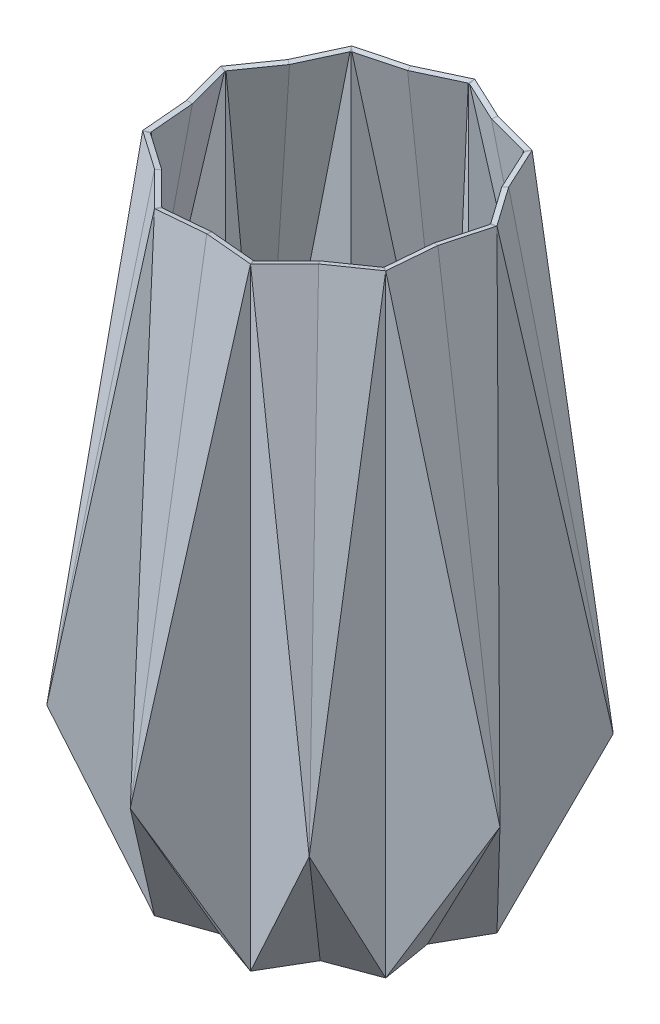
ISO-10303-21;
HEADER;
FILE_DESCRIPTION(('STEP AP214'),'2;1');
FILE_NAME('part.step','',(''),(''),'','','');
FILE_SCHEMA(('AUTOMOTIVE_DESIGN { 1 0 10303 214 1 1 1 1 }'));
ENDSEC;
DATA;
#1=APPLICATION_CONTEXT('core data for automotive mechanical design processes');
#2=APPLICATION_PROTOCOL_DEFINITION('international standard','automotive_design',2000,#1);
#3=PRODUCT_CONTEXT('',#1,'mechanical');
#4=PRODUCT('Part','Part','',(#3));
#5=PRODUCT_RELATED_PRODUCT_CATEGORY('part','',(#4));
#6=PRODUCT_DEFINITION_FORMATION('','',#4);
#7=PRODUCT_DEFINITION_CONTEXT('part definition',#1,'design');
#8=PRODUCT_DEFINITION('design','',#6,#7);
#9=PRODUCT_DEFINITION_SHAPE('','',#8);
#10=(LENGTH_UNIT() NAMED_UNIT(*) SI_UNIT(.MILLI.,.METRE.));
#11=(NAMED_UNIT(*) PLANE_ANGLE_UNIT() SI_UNIT($,.RADIAN.));
#12=(NAMED_UNIT(*) SI_UNIT($,.STERADIAN.) SOLID_ANGLE_UNIT());
#13=UNCERTAINTY_MEASURE_WITH_UNIT(LENGTH_MEASURE(1.E-05),#10,'distance_accuracy_value','');
#14=(GEOMETRIC_REPRESENTATION_CONTEXT(3) GLOBAL_UNCERTAINTY_ASSIGNED_CONTEXT((#13)) GLOBAL_UNIT_ASSIGNED_CONTEXT((#10,
#11,#12)) REPRESENTATION_CONTEXT('',''));
#15=CARTESIAN_POINT('',(0.,0.,0.));
#16=DIRECTION('',(0.,0.,1.));
#17=DIRECTION('',(1.,0.,0.));
#18=AXIS2_PLACEMENT_3D('',#15,#16,#17);
#19=CARTESIAN_POINT('',(-17.603319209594,119.836237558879,11.6940014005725));
#20=DIRECTION('',(-0.134613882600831,-0.986854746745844,0.089424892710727));
#21=DIRECTION('',(-0.0120862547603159,-0.0886043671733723,-0.995993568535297));
#22=AXIS2_PLACEMENT_3D('',#19,#20,#21);
#23=PLANE('',#22);
#24=DIRECTION('',(-0.438685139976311,0.140272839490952,0.887625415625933));
#25=VECTOR('',#24,1.);
#26=CARTESIAN_POINT('',(-8.89340811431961,119.836237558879,24.8052829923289));
#27=LINE('',#26,#25);
#28=CARTESIAN_POINT('',(-8.89340811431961,119.836237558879,24.8052829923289));
#29=VERTEX_POINT('',#28);
#30=CARTESIAN_POINT('',(-9.40555394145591,120.,25.8415470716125));
#31=VERTEX_POINT('',#30);
#32=EDGE_CURVE('E13',#29,#31,#27,.T.);
#33=ORIENTED_EDGE('',*,*,#32,.F.);
#34=DIRECTION('',(-0.553338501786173,0.,-0.832956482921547));
#35=VECTOR('',#34,1.);
#36=CARTESIAN_POINT('',(-17.603319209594,119.836237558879,11.6940014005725));
#37=LINE('',#36,#35);
#38=CARTESIAN_POINT('',(-8.98060818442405,119.836237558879,24.6740181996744));
#39=VERTEX_POINT('',#38);
#40=EDGE_CURVE('E489',#29,#39,#37,.T.);
#41=ORIENTED_EDGE('',*,*,#40,.T.);
#42=DIRECTION('',(-0.339087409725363,0.130674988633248,0.93163500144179));
#43=VECTOR('',#42,1.);
#44=CARTESIAN_POINT('',(-8.98060818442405,119.836237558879,24.6740181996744));
#45=LINE('',#44,#43);
#46=EDGE_CURVE('E78',#39,#31,#45,.T.);
#47=ORIENTED_EDGE('',*,*,#46,.T.);
#48=EDGE_LOOP('',(#33,#41,#47));
#49=FACE_BOUND('',#48,.T.);
#50=ADVANCED_FACE('F68',(#49),#23,.F.);
#51=CARTESIAN_POINT('',(5.96816565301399,119.836237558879,20.2733202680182));
#52=DIRECTION('',(0.0456390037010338,-0.986854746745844,0.155031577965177));
#53=DIRECTION('',(-0.998957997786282,-0.0450860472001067,0.00708286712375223));
#54=AXIS2_PLACEMENT_3D('',#51,#52,#53);
#55=PLANE('',#54);
#56=ORIENTED_EDGE('',*,*,#46,.F.);
#57=DIRECTION('',(-0.959295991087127,0.,0.282402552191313));
#58=VECTOR('',#57,1.);
#59=CARTESIAN_POINT('',(5.96816565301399,119.836237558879,20.2733202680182));
#60=LINE('',#59,#58);
#61=CARTESIAN_POINT('',(-9.13178269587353,119.836237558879,24.7185217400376));
#62=VERTEX_POINT('',#61);
#63=EDGE_CURVE('E517',#39,#62,#60,.T.);
#64=ORIENTED_EDGE('',*,*,#63,.T.);
#65=DIRECTION('',(-0.234502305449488,0.140272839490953,0.961941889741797));
#66=VECTOR('',#65,1.);
#67=CARTESIAN_POINT('',(-9.13178269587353,119.836237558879,24.7185217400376));
#68=LINE('',#67,#66);
#69=EDGE_CURVE('E720',#62,#31,#68,.T.);
#70=ORIENTED_EDGE('',*,*,#69,.T.);
#71=EDGE_LOOP('',(#56,#64,#70));
#72=FACE_BOUND('',#71,.T.);
#73=ADVANCED_FACE('F1566',(#72),#55,.F.);
#74=CARTESIAN_POINT('',(-9.40555394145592,120.,25.8415470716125));
#75=DIRECTION('',(0.116025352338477,0.986499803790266,-0.1155692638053));
#76=DIRECTION('',(-0.705712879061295,0.,-0.708497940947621));
#77=AXIS2_PLACEMENT_3D('',#74,#75,#76);
#78=PLANE('',#77);
#79=ORIENTED_EDGE('',*,*,#69,.F.);
#80=DIRECTION('',(-0.705712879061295,0.,-0.708497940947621));
#81=VECTOR('',#80,1.);
#82=CARTESIAN_POINT('',(-8.70662086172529,119.836237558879,25.1453614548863));
#83=LINE('',#82,#81);
#84=CARTESIAN_POINT('',(-15.4330472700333,119.836237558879,18.3923895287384));
#85=VERTEX_POINT('',#84);
#86=EDGE_CURVE('E527',#62,#85,#83,.T.);
#87=ORIENTED_EDGE('',*,*,#86,.T.);
#88=DIRECTION('',(-0.634177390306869,0.163128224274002,0.75578318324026));
#89=VECTOR('',#88,1.);
#90=CARTESIAN_POINT('',(-15.4330472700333,119.836237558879,18.3923895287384));
#91=LINE('',#90,#89);
#92=CARTESIAN_POINT('',(-16.0696902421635,120.,19.1511110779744));
#93=VERTEX_POINT('',#92);
#94=EDGE_CURVE('E716',#85,#93,#91,.T.);
#95=ORIENTED_EDGE('',*,*,#94,.T.);
#96=DIRECTION('',(-0.705712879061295,0.,-0.708497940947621));
#97=VECTOR('',#96,1.);
#98=CARTESIAN_POINT('',(-9.40555394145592,120.,25.8415470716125));
#99=LINE('',#98,#97);
#100=EDGE_CURVE('E834',#31,#93,#99,.T.);
#101=ORIENTED_EDGE('',*,*,#100,.F.);
#102=EDGE_LOOP('',(#79,#87,#95,#101));
#103=FACE_BOUND('',#102,.T.);
#104=ADVANCED_FACE('F1559',(#103),#78,.T.);
#105=CARTESIAN_POINT('',(-23.8156986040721,120.,13.75));
#106=DIRECTION('',(-0.0936659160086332,-0.986499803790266,0.134331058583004));
#107=DIRECTION('',(0.820280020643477,0.,0.571962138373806));
#108=AXIS2_PLACEMENT_3D('',#105,#106,#107);
#109=PLANE('',#108);
#110=ORIENTED_EDGE('',*,*,#94,.F.);
#111=DIRECTION('',(0.820280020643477,0.,0.571962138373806));
#112=VECTOR('',#111,1.);
#113=CARTESIAN_POINT('',(-23.2514580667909,119.836237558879,12.9407939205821));
#114=LINE('',#113,#112);
#115=CARTESIAN_POINT('',(-22.7572744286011,119.836237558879,13.2853766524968));
#116=VERTEX_POINT('',#115);
#117=EDGE_CURVE('E1314',#116,#85,#114,.T.);
#118=ORIENTED_EDGE('',*,*,#117,.F.);
#119=DIRECTION('',(-0.906606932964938,0.140272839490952,0.397979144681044));
#120=VECTOR('',#119,1.);
#121=CARTESIAN_POINT('',(-22.7572744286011,119.836237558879,13.2853766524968));
#122=LINE('',#121,#120);
#123=CARTESIAN_POINT('',(-23.8156986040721,120.,13.75));
#124=VERTEX_POINT('',#123);
#125=EDGE_CURVE('E712',#116,#124,#122,.T.);
#126=ORIENTED_EDGE('',*,*,#125,.T.);
#127=DIRECTION('',(0.820280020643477,0.,0.571962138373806));
#128=VECTOR('',#127,1.);
#129=CARTESIAN_POINT('',(-23.8156986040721,120.,13.75));
#130=LINE('',#129,#128);
#131=EDGE_CURVE('E1025',#124,#93,#130,.T.);
#132=ORIENTED_EDGE('',*,*,#131,.T.);
#133=EDGE_LOOP('',(#110,#118,#126,#132));
#134=FACE_BOUND('',#133,.T.);
#135=ADVANCED_FACE('F1576',(#134),#109,.F.);
#136=CARTESIAN_POINT('',(-21.0016840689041,119.836237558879,-2.35707068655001));
#137=DIRECTION('',(-0.160601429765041,-0.986854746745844,-0.0180246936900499));
#138=DIRECTION('',(0.00289526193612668,0.0177906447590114,-0.999837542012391));
#139=AXIS2_PLACEMENT_3D('',#136,#137,#138);
#140=PLANE('',#139);
#141=ORIENTED_EDGE('',*,*,#125,.F.);
#142=DIRECTION('',(0.111532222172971,0.,-0.993760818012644));
#143=VECTOR('',#142,1.);
#144=CARTESIAN_POINT('',(-21.0016840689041,119.836237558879,-2.35707068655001));
#145=LINE('',#144,#143);
#146=CARTESIAN_POINT('',(-22.7396981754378,119.836237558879,13.1287708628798));
#147=VERTEX_POINT('',#146);
#148=EDGE_CURVE('E572',#116,#147,#145,.T.);
#149=ORIENTED_EDGE('',*,*,#148,.T.);
#150=DIRECTION('',(-0.858599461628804,0.130674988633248,0.495712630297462));
#151=VECTOR('',#150,1.);
#152=CARTESIAN_POINT('',(-22.7396981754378,119.836237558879,13.1287708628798));
#153=LINE('',#152,#151);
#154=EDGE_CURVE('E707',#147,#124,#153,.T.);
#155=ORIENTED_EDGE('',*,*,#154,.T.);
#156=EDGE_LOOP('',(#141,#149,#155));
#157=FACE_BOUND('',#156,.T.);
#158=ADVANCED_FACE('F1575',(#157),#140,.F.);
#159=CARTESIAN_POINT('',(-8.45955894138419,119.836237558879,19.3665272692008));
#160=DIRECTION('',(-0.0646908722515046,-0.986854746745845,0.148097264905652));
#161=DIRECTION('',(-0.99790535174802,0.0639744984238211,-0.00960065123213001));
#162=AXIS2_PLACEMENT_3D('',#159,#160,#161);
#163=PLANE('',#162);
#164=ORIENTED_EDGE('',*,*,#154,.F.);
#165=DIRECTION('',(-0.916388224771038,0.,-0.400290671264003));
#166=VECTOR('',#165,1.);
#167=CARTESIAN_POINT('',(-8.45955894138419,119.836237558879,19.3665272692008));
#168=LINE('',#167,#166);
#169=CARTESIAN_POINT('',(-22.8841108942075,119.836237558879,13.065689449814));
#170=VERTEX_POINT('',#169);
#171=EDGE_CURVE('E518',#147,#170,#168,.T.);
#172=ORIENTED_EDGE('',*,*,#171,.T.);
#173=DIRECTION('',(-0.797963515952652,0.140272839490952,0.586155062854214));
#174=VECTOR('',#173,1.);
#175=CARTESIAN_POINT('',(-22.8841108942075,119.836237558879,13.065689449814));
#176=LINE('',#175,#174);
#177=EDGE_CURVE('E702',#170,#124,#176,.T.);
#178=ORIENTED_EDGE('',*,*,#177,.T.);
#179=EDGE_LOOP('',(#164,#172,#178));
#180=FACE_BOUND('',#179,.T.);
#181=ADVANCED_FACE('F1655',(#180),#163,.F.);
#182=CARTESIAN_POINT('',(-23.8156986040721,120.,13.75));
#183=DIRECTION('',(0.163167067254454,0.986499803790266,-0.0139515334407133));
#184=DIRECTION('',(-0.0851937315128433,0.,-0.996364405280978));
#185=AXIS2_PLACEMENT_3D('',#182,#183,#184);
#186=PLANE('',#185);
#187=ORIENTED_EDGE('',*,*,#177,.F.);
#188=DIRECTION('',(-0.0851937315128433,0.,-0.996364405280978));
#189=VECTOR('',#188,1.);
#190=CARTESIAN_POINT('',(-22.8327853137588,119.836237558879,13.6659564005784));
#191=LINE('',#190,#189);
#192=CARTESIAN_POINT('',(-23.644800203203,119.836237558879,4.1692162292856));
#193=VERTEX_POINT('',#192);
#194=EDGE_CURVE('E1422',#170,#193,#191,.T.);
#195=ORIENTED_EDGE('',*,*,#194,.T.);
#196=DIRECTION('',(-0.971616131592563,0.163128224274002,0.171322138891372));
#197=VECTOR('',#196,1.);
#198=CARTESIAN_POINT('',(-23.644800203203,119.836237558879,4.1692162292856));
#199=LINE('',#198,#197);
#200=CARTESIAN_POINT('',(-24.6201938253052,120.,4.34120444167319));
#201=VERTEX_POINT('',#200);
#202=EDGE_CURVE('E698',#193,#201,#199,.T.);
#203=ORIENTED_EDGE('',*,*,#202,.T.);
#204=DIRECTION('',(-0.0851937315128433,0.,-0.996364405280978));
#205=VECTOR('',#204,1.);
#206=CARTESIAN_POINT('',(-23.8156986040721,120.,13.75));
#207=LINE('',#206,#205);
#208=EDGE_CURVE('E1199',#124,#201,#207,.T.);
#209=ORIENTED_EDGE('',*,*,#208,.F.);
#210=EDGE_LOOP('',(#187,#195,#203,#209));
#211=FACE_BOUND('',#210,.T.);
#212=ADVANCED_FACE('F1657',(#211),#186,.T.);
#213=CARTESIAN_POINT('',(-27.0822132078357,120.,-4.77532488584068));
#214=DIRECTION('',(-0.158098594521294,-0.986499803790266,0.0426962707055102));
#215=DIRECTION('',(0.260720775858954,0.,0.965414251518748));
#216=AXIS2_PLACEMENT_3D('',#213,#214,#215);
#217=PLANE('',#216);
#218=ORIENTED_EDGE('',*,*,#202,.F.);
#219=DIRECTION('',(0.260720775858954,0.,0.965414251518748));
#220=VECTOR('',#219,1.);
#221=CARTESIAN_POINT('',(-26.1298322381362,119.836237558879,-5.03252588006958));
#222=LINE('',#221,#220);
#223=CARTESIAN_POINT('',(-25.9727591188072,119.836237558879,-4.4509050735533));
#224=VERTEX_POINT('',#223);
#225=EDGE_CURVE('E1423',#224,#193,#222,.T.);
#226=ORIENTED_EDGE('',*,*,#225,.F.);
#227=DIRECTION('',(-0.950317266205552,0.140272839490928,-0.277885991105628));
#228=VECTOR('',#227,1.);
#229=CARTESIAN_POINT('',(-25.9727591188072,119.836237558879,-4.4509050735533));
#230=LINE('',#229,#228);
#231=CARTESIAN_POINT('',(-27.0822132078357,120.,-4.77532488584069));
#232=VERTEX_POINT('',#231);
#233=EDGE_CURVE('E694',#224,#232,#230,.T.);
#234=ORIENTED_EDGE('',*,*,#233,.T.);
#235=DIRECTION('',(0.260720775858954,0.,0.965414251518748));
#236=VECTOR('',#235,1.);
#237=CARTESIAN_POINT('',(-27.0822132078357,120.,-4.77532488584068));
#238=LINE('',#237,#236);
#239=EDGE_CURVE('E579',#232,#201,#238,.T.);
#240=ORIENTED_EDGE('',*,*,#239,.T.);
#241=EDGE_LOOP('',(#218,#226,#234,#240));
#242=FACE_BOUND('',#241,.T.);
#243=ADVANCED_FACE('F1706',(#242),#217,.F.);
#244=CARTESIAN_POINT('',(-14.5731275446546,119.836237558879,-15.305243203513));
#245=DIRECTION('',(-0.111441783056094,-0.986854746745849,-0.117040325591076));
#246=DIRECTION('',(-0.993770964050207,0.110666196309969,0.0131249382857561));
#247=AXIS2_PLACEMENT_3D('',#244,#245,#246);
#248=PLANE('',#247);
#249=ORIENTED_EDGE('',*,*,#233,.F.);
#250=DIRECTION('',(0.724215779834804,0.,-0.689573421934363));
#251=VECTOR('',#250,1.);
#252=CARTESIAN_POINT('',(-14.5731275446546,119.836237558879,-15.305243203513));
#253=LINE('',#252,#251);
#254=CARTESIAN_POINT('',(-25.8586306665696,119.836237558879,-4.55957427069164));
#255=VERTEX_POINT('',#254);
#256=EDGE_CURVE('E566',#224,#255,#253,.T.);
#257=ORIENTED_EDGE('',*,*,#256,.T.);
#258=DIRECTION('',(-0.976363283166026,0.130674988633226,-0.172159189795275));
#259=VECTOR('',#258,1.);
#260=CARTESIAN_POINT('',(-25.8586306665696,119.836237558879,-4.55957427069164));
#261=LINE('',#260,#259);
#262=EDGE_CURVE('E689',#255,#232,#261,.T.);
#263=ORIENTED_EDGE('',*,*,#262,.T.);
#264=EDGE_LOOP('',(#249,#257,#263));
#265=FACE_BOUND('',#264,.T.);
#266=ADVANCED_FACE('F1709',(#265),#248,.F.);
#267=CARTESIAN_POINT('',(-18.9289618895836,119.836237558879,9.39792092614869));
#268=DIRECTION('',(-0.14475117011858,-0.986854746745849,0.0718665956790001));
#269=DIRECTION('',(-0.0104297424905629,-0.0711057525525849,-0.99741425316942));
#270=AXIS2_PLACEMENT_3D('',#267,#268,#269);
#271=PLANE('',#270);
#272=ORIENTED_EDGE('',*,*,#262,.F.);
#273=DIRECTION('',(-0.444692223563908,0.,-0.895683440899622));
#274=VECTOR('',#273,1.);
#275=CARTESIAN_POINT('',(-18.9289618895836,119.836237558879,9.39792092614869));
#276=LINE('',#275,#274);
#277=CARTESIAN_POINT('',(-25.9287092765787,119.836237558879,-4.70072414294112));
#278=VERTEX_POINT('',#277);
#279=EDGE_CURVE('E569',#255,#278,#276,.T.);
#280=ORIENTED_EDGE('',*,*,#279,.T.);
#281=DIRECTION('',(-0.988048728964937,0.14027283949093,-0.0639002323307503));
#282=VECTOR('',#281,1.);
#283=CARTESIAN_POINT('',(-25.9287092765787,119.836237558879,-4.70072414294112));
#284=LINE('',#283,#282);
#285=EDGE_CURVE('E684',#278,#232,#284,.T.);
#286=ORIENTED_EDGE('',*,*,#285,.T.);
#287=EDGE_LOOP('',(#272,#280,#286));
#288=FACE_BOUND('',#287,.T.);
#289=ADVANCED_FACE('F1713',(#288),#271,.F.);
#290=CARTESIAN_POINT('',(-27.0822132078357,120.,-4.7753248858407));
#291=DIRECTION('',(0.133961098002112,0.986499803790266,0.0941942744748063));
#292=DIRECTION('',(0.575188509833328,0.,-0.818020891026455));
#293=AXIS2_PLACEMENT_3D('',#290,#291,#292);
#294=PLANE('',#293);
#295=ORIENTED_EDGE('',*,*,#285,.F.);
#296=DIRECTION('',(0.575188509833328,0.,-0.818020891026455));
#297=VECTOR('',#296,1.);
#298=CARTESIAN_POINT('',(-26.2752357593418,119.836237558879,-4.2079015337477));
#299=LINE('',#298,#297);
#300=CARTESIAN_POINT('',(-20.7928883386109,119.836237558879,-12.004779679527));
#301=VERTEX_POINT('',#300);
#302=EDGE_CURVE('E1413',#278,#301,#299,.T.);
#303=ORIENTED_EDGE('',*,*,#302,.T.);
#304=DIRECTION('',(-0.85442488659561,0.163128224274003,-0.493302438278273));
#305=VECTOR('',#304,1.);
#306=CARTESIAN_POINT('',(-20.7928883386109,119.836237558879,-12.004779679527));
#307=LINE('',#306,#305);
#308=CARTESIAN_POINT('',(-21.6506350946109,120.,-12.5000000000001));
#309=VERTEX_POINT('',#308);
#310=EDGE_CURVE('E680',#301,#309,#307,.T.);
#311=ORIENTED_EDGE('',*,*,#310,.T.);
#312=DIRECTION('',(0.575188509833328,0.,-0.818020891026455));
#313=VECTOR('',#312,1.);
#314=CARTESIAN_POINT('',(-27.0822132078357,120.,-4.7753248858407));
#315=LINE('',#314,#313);
#316=EDGE_CURVE('E1124',#232,#309,#315,.T.);
#317=ORIENTED_EDGE('',*,*,#316,.F.);
#318=EDGE_LOOP('',(#295,#303,#311,#317));
#319=FACE_BOUND('',#318,.T.);
#320=ADVANCED_FACE('F1717',(#319),#294,.T.);
#321=CARTESIAN_POINT('',(-17.6766592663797,120.,-21.066222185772));
#322=DIRECTION('',(-0.148555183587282,-0.986499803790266,-0.0689165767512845));
#323=DIRECTION('',(-0.420832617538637,0.,0.907138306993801));
#324=AXIS2_PLACEMENT_3D('',#321,#322,#323);
#325=PLANE('',#324);
#326=ORIENTED_EDGE('',*,*,#310,.F.);
#327=DIRECTION('',(-0.420832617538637,0.,0.907138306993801));
#328=VECTOR('',#327,1.);
#329=CARTESIAN_POINT('',(-16.7817675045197,119.836237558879,-20.6510708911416));
#330=LINE('',#329,#328);
#331=CARTESIAN_POINT('',(-17.035301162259,119.836237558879,-20.104558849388));
#332=VERTEX_POINT('',#331);
#333=EDGE_CURVE('E1426',#332,#301,#330,.T.);
#334=ORIENTED_EDGE('',*,*,#333,.F.);
#335=DIRECTION('',(-0.549363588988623,0.140272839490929,-0.823725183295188));
#336=VECTOR('',#335,1.);
#337=CARTESIAN_POINT('',(-17.035301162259,119.836237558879,-20.104558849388));
#338=LINE('',#337,#336);
#339=CARTESIAN_POINT('',(-17.6766592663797,120.,-21.066222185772));
#340=VERTEX_POINT('',#339);
#341=EDGE_CURVE('E676',#332,#340,#338,.T.);
#342=ORIENTED_EDGE('',*,*,#341,.T.);
#343=DIRECTION('',(-0.420832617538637,0.,0.907138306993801));
#344=VECTOR('',#343,1.);
#345=CARTESIAN_POINT('',(-17.6766592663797,120.,-21.066222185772));
#346=LINE('',#345,#344);
#347=EDGE_CURVE('E1130',#340,#309,#346,.T.);
#348=ORIENTED_EDGE('',*,*,#347,.T.);
#349=EDGE_LOOP('',(#326,#334,#342,#348));
#350=FACE_BOUND('',#349,.T.);
#351=ADVANCED_FACE('F1721',(#350),#325,.F.);
#352=CARTESIAN_POINT('',(-1.32564267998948,119.836237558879,-21.0919223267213));
#353=DIRECTION('',(-0.0101372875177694,-0.986854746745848,-0.161291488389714));
#354=DIRECTION('',(-0.999948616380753,0.0100045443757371,0.0016351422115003));
#355=AXIS2_PLACEMENT_3D('',#352,#353,#354);
#356=PLANE('',#355);
#357=ORIENTED_EDGE('',*,*,#341,.F.);
#358=DIRECTION('',(0.998030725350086,0.,-0.0627269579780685));
#359=VECTOR('',#358,1.);
#360=CARTESIAN_POINT('',(-1.32564267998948,119.836237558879,-21.0919223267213));
#361=LINE('',#360,#359);
#362=CARTESIAN_POINT('',(-16.8780224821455,119.836237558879,-20.114443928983));
#363=VERTEX_POINT('',#362);
#364=EDGE_CURVE('E560',#332,#363,#361,.T.);
#365=ORIENTED_EDGE('',*,*,#364,.T.);
#366=DIRECTION('',(-0.63727587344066,0.130674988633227,-0.759475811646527));
#367=VECTOR('',#366,1.);
#368=CARTESIAN_POINT('',(-16.8780224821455,119.836237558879,-20.114443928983));
#369=LINE('',#368,#367);
#370=EDGE_CURVE('E671',#363,#340,#369,.T.);
#371=ORIENTED_EDGE('',*,*,#370,.T.);
#372=EDGE_LOOP('',(#357,#365,#371));
#373=FACE_BOUND('',#372,.T.);
#374=ADVANCED_FACE('F1725',(#373),#356,.F.);
#375=CARTESIAN_POINT('',(-20.5412931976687,119.836237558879,-4.96807706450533));
#376=DIRECTION('',(-0.157080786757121,-0.986854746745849,-0.0379912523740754));
#377=DIRECTION('',(0.00597200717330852,0.0375189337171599,-0.999278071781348));
#378=AXIS2_PLACEMENT_3D('',#375,#376,#377);
#379=PLANE('',#378);
#380=ORIENTED_EDGE('',*,*,#370,.F.);
#381=DIRECTION('',(0.23508021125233,0.,-0.971975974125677));
#382=VECTOR('',#381,1.);
#383=CARTESIAN_POINT('',(-20.5412931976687,119.836237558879,-4.96807706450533));
#384=LINE('',#383,#382);
#385=CARTESIAN_POINT('',(-16.8409764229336,119.836237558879,-20.2676166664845));
#386=VERTEX_POINT('',#385);
#387=EDGE_CURVE('E563',#363,#386,#384,.T.);
#388=ORIENTED_EDGE('',*,*,#387,.T.);
#389=DIRECTION('',(-0.715814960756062,0.140272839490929,-0.684055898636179));
#390=VECTOR('',#389,1.);
#391=CARTESIAN_POINT('',(-16.8409764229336,119.836237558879,-20.2676166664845));
#392=LINE('',#391,#390);
#393=EDGE_CURVE('E666',#386,#340,#392,.T.);
#394=ORIENTED_EDGE('',*,*,#393,.T.);
#395=EDGE_LOOP('',(#380,#388,#394));
#396=FACE_BOUND('',#395,.T.);
#397=ADVANCED_FACE('F1729',(#396),#379,.F.);
#398=CARTESIAN_POINT('',(-17.6766592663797,120.,-21.066222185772));
#399=DIRECTION('',(0.0420732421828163,0.986499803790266,0.158265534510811));
#400=DIRECTION('',(0.966433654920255,0.,-0.256916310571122));
#401=AXIS2_PLACEMENT_3D('',#398,#399,#400);
#402=PLANE('',#401);
#403=ORIENTED_EDGE('',*,*,#393,.F.);
#404=DIRECTION('',(0.966433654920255,0.,-0.256916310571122));
#405=VECTOR('',#404,1.);
#406=CARTESIAN_POINT('',(-17.4232113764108,119.836237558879,-20.1128355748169));
#407=LINE('',#406,#405);
#408=CARTESIAN_POINT('',(-8.21175293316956,119.836237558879,-22.5616057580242));
#409=VERTEX_POINT('',#408);
#410=EDGE_CURVE('E1429',#386,#409,#407,.T.);
#411=ORIENTED_EDGE('',*,*,#410,.T.);
#412=DIRECTION('',(-0.33743874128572,0.163128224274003,-0.92710532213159));
#413=VECTOR('',#412,1.);
#414=CARTESIAN_POINT('',(-8.21175293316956,119.836237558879,-22.5616057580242));
#415=LINE('',#414,#413);
#416=CARTESIAN_POINT('',(-8.55050358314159,120.,-23.4923155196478));
#417=VERTEX_POINT('',#416);
#418=EDGE_CURVE('E662',#409,#417,#415,.T.);
#419=ORIENTED_EDGE('',*,*,#418,.T.);
#420=DIRECTION('',(0.966433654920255,0.,-0.256916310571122));
#421=VECTOR('',#420,1.);
#422=CARTESIAN_POINT('',(-17.6766592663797,120.,-21.066222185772));
#423=LINE('',#422,#421);
#424=EDGE_CURVE('E1139',#340,#417,#423,.T.);
#425=ORIENTED_EDGE('',*,*,#424,.F.);
#426=EDGE_LOOP('',(#403,#411,#419,#425));
#427=FACE_BOUND('',#426,.T.);
#428=ADVANCED_FACE('F1733',(#427),#402,.T.);
#429=CARTESIAN_POINT('',(1.71737624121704E-13,120.,-27.5));
#430=DIRECTION('',(-0.0695011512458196,-0.986499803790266,-0.148282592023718));
#431=DIRECTION('',(-0.905473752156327,0.,0.424402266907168));
#432=AXIS2_PLACEMENT_3D('',#429,#430,#431);
#433=PLANE('',#432);
#434=ORIENTED_EDGE('',*,*,#418,.F.);
#435=DIRECTION('',(-0.905473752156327,0.,0.424402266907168));
#436=VECTOR('',#435,1.);
#437=CARTESIAN_POINT('',(0.418672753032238,119.836237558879,-26.6067503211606));
#438=LINE('',#437,#436);
#439=CARTESIAN_POINT('',(-0.126836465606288,119.836237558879,-26.3510661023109));
#440=VERTEX_POINT('',#439);
#441=EDGE_CURVE('E1430',#440,#409,#438,.T.);
#442=ORIENTED_EDGE('',*,*,#441,.F.);
#443=DIRECTION('',(0.10864341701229,0.140272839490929,-0.984134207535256));
#444=VECTOR('',#443,1.);
#445=CARTESIAN_POINT('',(-0.126836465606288,119.836237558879,-26.3510661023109));
#446=LINE('',#445,#444);
#447=CARTESIAN_POINT('',(1.78329573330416E-13,120.,-27.5));
#448=VERTEX_POINT('',#447);
#449=EDGE_CURVE('E658',#440,#448,#446,.T.);
#450=ORIENTED_EDGE('',*,*,#449,.T.);
#451=DIRECTION('',(-0.905473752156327,0.,0.424402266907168));
#452=VECTOR('',#451,1.);
#453=CARTESIAN_POINT('',(1.71737624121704E-13,120.,-27.5));
#454=LINE('',#453,#452);
#455=EDGE_CURVE('E1145',#448,#417,#454,.T.);
#456=ORIENTED_EDGE('',*,*,#455,.T.);
#457=EDGE_LOOP('',(#434,#442,#450,#456));
#458=FACE_BOUND('',#457,.T.);
#459=ADVANCED_FACE('F1737',(#458),#433,.F.);
#460=CARTESIAN_POINT('',(12.5421251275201,119.836237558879,-17.0094565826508));
#461=DIRECTION('',(0.0959105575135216,-0.986854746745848,-0.130072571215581));
#462=DIRECTION('',(-0.995389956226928,-0.0950881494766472,-0.0125331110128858));
#463=AXIS2_PLACEMENT_3D('',#460,#461,#462);
#464=PLANE('',#463);
#465=ORIENTED_EDGE('',*,*,#449,.F.);
#466=DIRECTION('',(0.804856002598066,0.,0.593470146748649));
#467=VECTOR('',#466,1.);
#468=CARTESIAN_POINT('',(12.5421251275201,119.836237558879,-17.0094565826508));
#469=LINE('',#468,#467);
#470=CARTESIAN_POINT('',(1.76074432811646E-13,119.836237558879,-26.2575417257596));
#471=VERTEX_POINT('',#470);
#472=EDGE_CURVE('E554',#440,#471,#469,.T.);
#473=ORIENTED_EDGE('',*,*,#472,.T.);
#474=DIRECTION('',(0.,0.130674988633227,-0.991425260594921));
#475=VECTOR('',#474,1.);
#476=CARTESIAN_POINT('',(1.76074432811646E-13,119.836237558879,-26.2575417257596));
#477=LINE('',#476,#475);
#478=EDGE_CURVE('E653',#471,#448,#477,.T.);
#479=ORIENTED_EDGE('',*,*,#478,.T.);
#480=EDGE_LOOP('',(#465,#473,#479));
#481=FACE_BOUND('',#480,.T.);
#482=ADVANCED_FACE('F1741',(#481),#464,.F.);
#483=CARTESIAN_POINT('',(-12.5421251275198,119.836237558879,-17.009456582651));
#484=DIRECTION('',(-0.0959105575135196,-0.986854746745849,-0.130072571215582));
#485=DIRECTION('',(-0.995389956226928,0.0950881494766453,0.0125331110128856));
#486=AXIS2_PLACEMENT_3D('',#483,#484,#485);
#487=PLANE('',#486);
#488=ORIENTED_EDGE('',*,*,#478,.F.);
#489=DIRECTION('',(0.804856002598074,0.,-0.593470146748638));
#490=VECTOR('',#489,1.);
#491=CARTESIAN_POINT('',(-12.5421251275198,119.836237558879,-17.009456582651));
#492=LINE('',#491,#490);
#493=CARTESIAN_POINT('',(0.126836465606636,119.836237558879,-26.3510661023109));
#494=VERTEX_POINT('',#493);
#495=EDGE_CURVE('E557',#471,#494,#492,.T.);
#496=ORIENTED_EDGE('',*,*,#495,.T.);
#497=DIRECTION('',(-0.108643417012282,0.140272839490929,-0.984134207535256));
#498=VECTOR('',#497,1.);
#499=CARTESIAN_POINT('',(0.126836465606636,119.836237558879,-26.3510661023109));
#500=LINE('',#499,#498);
#501=EDGE_CURVE('E648',#494,#448,#500,.T.);
#502=ORIENTED_EDGE('',*,*,#501,.T.);
#503=EDGE_LOOP('',(#488,#496,#502));
#504=FACE_BOUND('',#503,.T.);
#505=ADVANCED_FACE('F1745',(#504),#487,.F.);
#506=CARTESIAN_POINT('',(1.87350135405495E-13,120.,-27.5));
#507=DIRECTION('',(-0.0695011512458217,0.986499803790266,0.148282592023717));
#508=DIRECTION('',(0.905473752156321,0.,0.42440226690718));
#509=AXIS2_PLACEMENT_3D('',#506,#507,#508);
#510=PLANE('',#509);
#511=ORIENTED_EDGE('',*,*,#501,.F.);
#512=DIRECTION('',(0.905473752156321,0.,0.42440226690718));
#513=VECTOR('',#512,1.);
#514=CARTESIAN_POINT('',(-0.41867275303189,119.836237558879,-26.6067503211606));
#515=LINE('',#514,#513);
#516=CARTESIAN_POINT('',(8.21175293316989,119.836237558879,-22.561605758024));
#517=VERTEX_POINT('',#516);
#518=EDGE_CURVE('E1433',#494,#517,#515,.T.);
#519=ORIENTED_EDGE('',*,*,#518,.T.);
#520=DIRECTION('',(0.337438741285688,0.163128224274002,-0.927105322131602));
#521=VECTOR('',#520,1.);
#522=CARTESIAN_POINT('',(8.21175293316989,119.836237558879,-22.561605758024));
#523=LINE('',#522,#521);
#524=CARTESIAN_POINT('',(8.55050358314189,120.,-23.4923155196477));
#525=VERTEX_POINT('',#524);
#526=EDGE_CURVE('E644',#517,#525,#523,.T.);
#527=ORIENTED_EDGE('',*,*,#526,.T.);
#528=DIRECTION('',(0.905473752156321,0.,0.42440226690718));
#529=VECTOR('',#528,1.);
#530=CARTESIAN_POINT('',(1.87350135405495E-13,120.,-27.5));
#531=LINE('',#530,#529);
#532=EDGE_CURVE('E1154',#448,#525,#531,.T.);
#533=ORIENTED_EDGE('',*,*,#532,.F.);
#534=EDGE_LOOP('',(#511,#519,#527,#533));
#535=FACE_BOUND('',#534,.T.);
#536=ADVANCED_FACE('F1749',(#535),#510,.T.);
#537=CARTESIAN_POINT('',(17.67665926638,120.,-21.0662221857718));
#538=DIRECTION('',(0.0420732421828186,-0.986499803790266,-0.158265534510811));
#539=DIRECTION('',(-0.966433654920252,0.,-0.256916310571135));
#540=AXIS2_PLACEMENT_3D('',#537,#538,#539);
#541=PLANE('',#540);
#542=ORIENTED_EDGE('',*,*,#526,.F.);
#543=DIRECTION('',(-0.966433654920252,0.,-0.256916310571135));
#544=VECTOR('',#543,1.);
#545=CARTESIAN_POINT('',(17.4232113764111,119.836237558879,-20.1128355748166));
#546=LINE('',#545,#544);
#547=CARTESIAN_POINT('',(16.8409764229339,119.836237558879,-20.2676166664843));
#548=VERTEX_POINT('',#547);
#549=EDGE_CURVE('E1434',#548,#517,#546,.T.);
#550=ORIENTED_EDGE('',*,*,#549,.F.);
#551=DIRECTION('',(0.715814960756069,0.140272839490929,-0.684055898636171));
#552=VECTOR('',#551,1.);
#553=CARTESIAN_POINT('',(16.8409764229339,119.836237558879,-20.2676166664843));
#554=LINE('',#553,#552);
#555=CARTESIAN_POINT('',(17.67665926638,120.,-21.0662221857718));
#556=VERTEX_POINT('',#555);
#557=EDGE_CURVE('E640',#548,#556,#554,.T.);
#558=ORIENTED_EDGE('',*,*,#557,.T.);
#559=DIRECTION('',(-0.966433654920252,0.,-0.256916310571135));
#560=VECTOR('',#559,1.);
#561=CARTESIAN_POINT('',(17.67665926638,120.,-21.0662221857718));
#562=LINE('',#561,#560);
#563=EDGE_CURVE('E1160',#556,#525,#562,.T.);
#564=ORIENTED_EDGE('',*,*,#563,.T.);
#565=EDGE_LOOP('',(#542,#550,#558,#564));
#566=FACE_BOUND('',#565,.T.);
#567=ADVANCED_FACE('F1753',(#566),#541,.F.);
#568=CARTESIAN_POINT('',(20.5412931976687,119.836237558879,-4.96807706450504));
#569=DIRECTION('',(0.157080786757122,-0.986854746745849,-0.0379912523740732));
#570=DIRECTION('',(-0.0059720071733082,0.0375189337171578,-0.999278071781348));
#571=AXIS2_PLACEMENT_3D('',#568,#569,#570);
#572=PLANE('',#571);
#573=ORIENTED_EDGE('',*,*,#557,.F.);
#574=DIRECTION('',(0.235080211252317,0.,0.971975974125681));
#575=VECTOR('',#574,1.);
#576=CARTESIAN_POINT('',(20.5412931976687,119.836237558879,-4.96807706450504));
#577=LINE('',#576,#575);
#578=CARTESIAN_POINT('',(16.8780224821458,119.836237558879,-20.1144439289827));
#579=VERTEX_POINT('',#578);
#580=EDGE_CURVE('E548',#548,#579,#577,.T.);
#581=ORIENTED_EDGE('',*,*,#580,.T.);
#582=DIRECTION('',(0.637275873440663,0.130674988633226,-0.759475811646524));
#583=VECTOR('',#582,1.);
#584=CARTESIAN_POINT('',(16.8780224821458,119.836237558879,-20.1144439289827));
#585=LINE('',#584,#583);
#586=EDGE_CURVE('E635',#579,#556,#585,.T.);
#587=ORIENTED_EDGE('',*,*,#586,.T.);
#588=EDGE_LOOP('',(#573,#581,#587));
#589=FACE_BOUND('',#588,.T.);
#590=ADVANCED_FACE('F1757',(#589),#572,.F.);
#591=CARTESIAN_POINT('',(1.32564267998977,119.836237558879,-21.0919223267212));
#592=DIRECTION('',(0.0101372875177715,-0.986854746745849,-0.161291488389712));
#593=DIRECTION('',(-0.999948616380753,-0.0100045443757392,-0.00163514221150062));
#594=AXIS2_PLACEMENT_3D('',#591,#592,#593);
#595=PLANE('',#594);
#596=ORIENTED_EDGE('',*,*,#586,.F.);
#597=DIRECTION('',(0.998030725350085,0.,0.0627269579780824));
#598=VECTOR('',#597,1.);
#599=CARTESIAN_POINT('',(1.32564267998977,119.836237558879,-21.0919223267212));
#600=LINE('',#599,#598);
#601=CARTESIAN_POINT('',(17.0353011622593,119.836237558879,-20.1045588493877));
#602=VERTEX_POINT('',#601);
#603=EDGE_CURVE('E551',#579,#602,#600,.T.);
#604=ORIENTED_EDGE('',*,*,#603,.T.);
#605=DIRECTION('',(0.549363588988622,0.140272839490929,-0.823725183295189));
#606=VECTOR('',#605,1.);
#607=CARTESIAN_POINT('',(17.0353011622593,119.836237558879,-20.1045588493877));
#608=LINE('',#607,#606);
#609=EDGE_CURVE('E630',#602,#556,#608,.T.);
#610=ORIENTED_EDGE('',*,*,#609,.T.);
#611=EDGE_LOOP('',(#596,#604,#610));
#612=FACE_BOUND('',#611,.T.);
#613=ADVANCED_FACE('F1761',(#612),#595,.F.);
#614=CARTESIAN_POINT('',(17.67665926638,120.,-21.0662221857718));
#615=DIRECTION('',(-0.148555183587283,0.986499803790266,0.0689165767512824));
#616=DIRECTION('',(0.420832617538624,0.,0.907138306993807));
#617=AXIS2_PLACEMENT_3D('',#614,#615,#616);
#618=PLANE('',#617);
#619=ORIENTED_EDGE('',*,*,#609,.F.);
#620=DIRECTION('',(0.420832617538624,0.,0.907138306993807));
#621=VECTOR('',#620,1.);
#622=CARTESIAN_POINT('',(16.78176750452,119.836237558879,-20.6510708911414));
#623=LINE('',#622,#621);
#624=CARTESIAN_POINT('',(20.7928883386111,119.836237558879,-12.0047796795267));
#625=VERTEX_POINT('',#624);
#626=EDGE_CURVE('E1437',#602,#625,#623,.T.);
#627=ORIENTED_EDGE('',*,*,#626,.T.);
#628=DIRECTION('',(0.854424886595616,0.163128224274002,-0.493302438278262));
#629=VECTOR('',#628,1.);
#630=CARTESIAN_POINT('',(20.7928883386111,119.836237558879,-12.0047796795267));
#631=LINE('',#630,#629);
#632=CARTESIAN_POINT('',(21.6506350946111,120.,-12.4999999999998));
#633=VERTEX_POINT('',#632);
#634=EDGE_CURVE('E626',#625,#633,#631,.T.);
#635=ORIENTED_EDGE('',*,*,#634,.T.);
#636=DIRECTION('',(0.420832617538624,0.,0.907138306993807));
#637=VECTOR('',#636,1.);
#638=CARTESIAN_POINT('',(17.67665926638,120.,-21.0662221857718));
#639=LINE('',#638,#637);
#640=EDGE_CURVE('E1169',#556,#633,#639,.T.);
#641=ORIENTED_EDGE('',*,*,#640,.F.);
#642=EDGE_LOOP('',(#619,#627,#635,#641));
#643=FACE_BOUND('',#642,.T.);
#644=ADVANCED_FACE('F1765',(#643),#618,.T.);
#645=CARTESIAN_POINT('',(27.0822132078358,120.,-4.77532488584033));
#646=DIRECTION('',(0.133961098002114,-0.986499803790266,-0.0941942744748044));
#647=DIRECTION('',(-0.575188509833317,0.,-0.818020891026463));
#648=AXIS2_PLACEMENT_3D('',#645,#646,#647);
#649=PLANE('',#648);
#650=ORIENTED_EDGE('',*,*,#634,.F.);
#651=DIRECTION('',(-0.575188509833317,0.,-0.818020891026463));
#652=VECTOR('',#651,1.);
#653=CARTESIAN_POINT('',(26.2752357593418,119.836237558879,-4.20790153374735));
#654=LINE('',#653,#652);
#655=CARTESIAN_POINT('',(25.9287092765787,119.836237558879,-4.70072414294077));
#656=VERTEX_POINT('',#655);
#657=EDGE_CURVE('E1438',#656,#625,#654,.T.);
#658=ORIENTED_EDGE('',*,*,#657,.F.);
#659=DIRECTION('',(0.988048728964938,0.140272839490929,-0.0639002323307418));
#660=VECTOR('',#659,1.);
#661=CARTESIAN_POINT('',(25.9287092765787,119.836237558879,-4.70072414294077));
#662=LINE('',#661,#660);
#663=CARTESIAN_POINT('',(27.0822132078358,120.,-4.77532488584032));
#664=VERTEX_POINT('',#663);
#665=EDGE_CURVE('E622',#656,#664,#662,.T.);
#666=ORIENTED_EDGE('',*,*,#665,.T.);
#667=DIRECTION('',(-0.575188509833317,0.,-0.818020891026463));
#668=VECTOR('',#667,1.);
#669=CARTESIAN_POINT('',(27.0822132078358,120.,-4.77532488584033));
#670=LINE('',#669,#668);
#671=EDGE_CURVE('E1175',#664,#633,#670,.T.);
#672=ORIENTED_EDGE('',*,*,#671,.T.);
#673=EDGE_LOOP('',(#650,#658,#666,#672));
#674=FACE_BOUND('',#673,.T.);
#675=ADVANCED_FACE('F1769',(#674),#649,.F.);
#676=CARTESIAN_POINT('',(18.9289618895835,119.836237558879,9.39792092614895));
#677=DIRECTION('',(0.144751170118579,-0.986854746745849,0.0718665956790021));
#678=DIRECTION('',(0.0104297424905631,-0.0711057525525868,-0.99741425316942));
#679=AXIS2_PLACEMENT_3D('',#676,#677,#678);
#680=PLANE('',#679);
#681=ORIENTED_EDGE('',*,*,#665,.F.);
#682=DIRECTION('',(-0.444692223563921,0.,0.895683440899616));
#683=VECTOR('',#682,1.);
#684=CARTESIAN_POINT('',(18.9289618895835,119.836237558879,9.39792092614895));
#685=LINE('',#684,#683);
#686=CARTESIAN_POINT('',(25.8586306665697,119.836237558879,-4.55957427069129));
#687=VERTEX_POINT('',#686);
#688=EDGE_CURVE('E542',#656,#687,#685,.T.);
#689=ORIENTED_EDGE('',*,*,#688,.T.);
#690=DIRECTION('',(0.976363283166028,0.130674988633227,-0.17215918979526));
#691=VECTOR('',#690,1.);
#692=CARTESIAN_POINT('',(25.8586306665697,119.836237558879,-4.55957427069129));
#693=LINE('',#692,#691);
#694=EDGE_CURVE('E617',#687,#664,#693,.T.);
#695=ORIENTED_EDGE('',*,*,#694,.T.);
#696=EDGE_LOOP('',(#681,#689,#695));
#697=FACE_BOUND('',#696,.T.);
#698=ADVANCED_FACE('F1773',(#697),#680,.F.);
#699=CARTESIAN_POINT('',(14.5731275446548,119.836237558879,-15.3052432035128));
#700=DIRECTION('',(0.111441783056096,-0.986854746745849,-0.117040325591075));
#701=DIRECTION('',(-0.993770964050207,-0.110666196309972,-0.0131249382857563));
#702=AXIS2_PLACEMENT_3D('',#699,#700,#701);
#703=PLANE('',#702);
#704=ORIENTED_EDGE('',*,*,#694,.F.);
#705=DIRECTION('',(0.724215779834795,0.,0.689573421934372));
#706=VECTOR('',#705,1.);
#707=CARTESIAN_POINT('',(14.5731275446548,119.836237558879,-15.3052432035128));
#708=LINE('',#707,#706);
#709=CARTESIAN_POINT('',(25.9727591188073,119.836237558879,-4.45090507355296));
#710=VERTEX_POINT('',#709);
#711=EDGE_CURVE('E545',#687,#710,#708,.T.);
#712=ORIENTED_EDGE('',*,*,#711,.T.);
#713=DIRECTION('',(0.950317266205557,0.14027283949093,-0.277885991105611));
#714=VECTOR('',#713,1.);
#715=CARTESIAN_POINT('',(25.9727591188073,119.836237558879,-4.45090507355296));
#716=LINE('',#715,#714);
#717=EDGE_CURVE('E612',#710,#664,#716,.T.);
#718=ORIENTED_EDGE('',*,*,#717,.T.);
#719=EDGE_LOOP('',(#704,#712,#718));
#720=FACE_BOUND('',#719,.T.);
#721=ADVANCED_FACE('F1777',(#720),#703,.F.);
#722=CARTESIAN_POINT('',(27.0822132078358,120.,-4.77532488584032));
#723=DIRECTION('',(-0.158098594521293,0.986499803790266,-0.0426962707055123));
#724=DIRECTION('',(-0.260720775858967,0.,0.965414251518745));
#725=AXIS2_PLACEMENT_3D('',#722,#723,#724);
#726=PLANE('',#725);
#727=ORIENTED_EDGE('',*,*,#717,.F.);
#728=DIRECTION('',(-0.260720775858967,0.,0.965414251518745));
#729=VECTOR('',#728,1.);
#730=CARTESIAN_POINT('',(26.1298322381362,119.836237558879,-5.03252588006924));
#731=LINE('',#730,#729);
#732=CARTESIAN_POINT('',(23.6448002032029,119.836237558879,4.16921622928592));
#733=VERTEX_POINT('',#732);
#734=EDGE_CURVE('E1441',#710,#733,#731,.T.);
#735=ORIENTED_EDGE('',*,*,#734,.T.);
#736=DIRECTION('',(0.971616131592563,0.163128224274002,0.17132213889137));
#737=VECTOR('',#736,1.);
#738=CARTESIAN_POINT('',(23.6448002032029,119.836237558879,4.16921622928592));
#739=LINE('',#738,#737);
#740=CARTESIAN_POINT('',(24.6201938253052,120.,4.34120444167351));
#741=VERTEX_POINT('',#740);
#742=EDGE_CURVE('E608',#733,#741,#739,.T.);
#743=ORIENTED_EDGE('',*,*,#742,.T.);
#744=DIRECTION('',(-0.260720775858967,0.,0.965414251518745));
#745=VECTOR('',#744,1.);
#746=CARTESIAN_POINT('',(27.0822132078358,120.,-4.77532488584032));
#747=LINE('',#746,#745);
#748=EDGE_CURVE('E1184',#664,#741,#747,.T.);
#749=ORIENTED_EDGE('',*,*,#748,.F.);
#750=EDGE_LOOP('',(#727,#735,#743,#749));
#751=FACE_BOUND('',#750,.T.);
#752=ADVANCED_FACE('F1781',(#751),#726,.T.);
#753=CARTESIAN_POINT('',(23.8156986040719,120.,13.7500000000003));
#754=DIRECTION('',(0.163167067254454,-0.986499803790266,0.0139515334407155));
#755=DIRECTION('',(0.0851937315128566,0.,-0.996364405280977));
#756=AXIS2_PLACEMENT_3D('',#753,#754,#755);
#757=PLANE('',#756);
#758=ORIENTED_EDGE('',*,*,#742,.F.);
#759=DIRECTION('',(0.0851937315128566,0.,-0.996364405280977));
#760=VECTOR('',#759,1.);
#761=CARTESIAN_POINT('',(22.8327853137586,119.836237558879,13.6659564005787));
#762=LINE('',#761,#760);
#763=CARTESIAN_POINT('',(22.8841108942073,119.836237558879,13.0656894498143));
#764=VERTEX_POINT('',#763);
#765=EDGE_CURVE('E1442',#764,#733,#762,.T.);
#766=ORIENTED_EDGE('',*,*,#765,.F.);
#767=DIRECTION('',(0.797963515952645,0.140272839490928,0.586155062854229));
#768=VECTOR('',#767,1.);
#769=CARTESIAN_POINT('',(22.8841108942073,119.836237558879,13.0656894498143));
#770=LINE('',#769,#768);
#771=CARTESIAN_POINT('',(23.8156986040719,120.,13.7500000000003));
#772=VERTEX_POINT('',#771);
#773=EDGE_CURVE('E604',#764,#772,#770,.T.);
#774=ORIENTED_EDGE('',*,*,#773,.T.);
#775=DIRECTION('',(0.0851937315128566,0.,-0.996364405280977));
#776=VECTOR('',#775,1.);
#777=CARTESIAN_POINT('',(23.8156986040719,120.,13.7500000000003));
#778=LINE('',#777,#776);
#779=EDGE_CURVE('E1190',#772,#741,#778,.T.);
#780=ORIENTED_EDGE('',*,*,#779,.T.);
#781=EDGE_LOOP('',(#758,#766,#774,#780));
#782=FACE_BOUND('',#781,.T.);
#783=ADVANCED_FACE('F1785',(#782),#757,.F.);
#784=CARTESIAN_POINT('',(8.45955894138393,119.836237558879,19.3665272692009));
#785=DIRECTION('',(0.0646908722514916,-0.986854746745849,0.148097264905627));
#786=DIRECTION('',(-0.997905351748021,-0.0639744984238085,0.00960065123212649));
#787=AXIS2_PLACEMENT_3D('',#784,#785,#786);
#788=PLANE('',#787);
#789=ORIENTED_EDGE('',*,*,#773,.F.);
#790=DIRECTION('',(-0.916388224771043,0.,0.400290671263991));
#791=VECTOR('',#790,1.);
#792=CARTESIAN_POINT('',(8.45955894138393,119.836237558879,19.3665272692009));
#793=LINE('',#792,#791);
#794=CARTESIAN_POINT('',(22.7396981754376,119.836237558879,13.1287708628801));
#795=VERTEX_POINT('',#794);
#796=EDGE_CURVE('E536',#764,#795,#793,.T.);
#797=ORIENTED_EDGE('',*,*,#796,.T.);
#798=DIRECTION('',(0.858599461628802,0.130674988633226,0.495712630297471));
#799=VECTOR('',#798,1.);
#800=CARTESIAN_POINT('',(22.7396981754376,119.836237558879,13.1287708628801));
#801=LINE('',#800,#799);
#802=EDGE_CURVE('E599',#795,#772,#801,.T.);
#803=ORIENTED_EDGE('',*,*,#802,.T.);
#804=EDGE_LOOP('',(#789,#797,#803));
#805=FACE_BOUND('',#804,.T.);
#806=ADVANCED_FACE('F1789',(#805),#788,.F.);
#807=CARTESIAN_POINT('',(21.0016840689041,119.836237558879,-2.35707068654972));
#808=DIRECTION('',(0.160601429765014,-0.986854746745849,-0.0180246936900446));
#809=DIRECTION('',(-0.00289526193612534,0.0177906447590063,-0.999837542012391));
#810=AXIS2_PLACEMENT_3D('',#807,#808,#809);
#811=PLANE('',#810);
#812=ORIENTED_EDGE('',*,*,#802,.F.);
#813=DIRECTION('',(0.111532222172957,0.,0.993760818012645));
#814=VECTOR('',#813,1.);
#815=CARTESIAN_POINT('',(21.0016840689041,119.836237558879,-2.35707068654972));
#816=LINE('',#815,#814);
#817=CARTESIAN_POINT('',(22.7572744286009,119.836237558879,13.2853766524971));
#818=VERTEX_POINT('',#817);
#819=EDGE_CURVE('E539',#795,#818,#816,.T.);
#820=ORIENTED_EDGE('',*,*,#819,.T.);
#821=DIRECTION('',(0.90660693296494,0.140272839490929,0.397979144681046));
#822=VECTOR('',#821,1.);
#823=CARTESIAN_POINT('',(22.7572744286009,119.836237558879,13.2853766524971));
#824=LINE('',#823,#822);
#825=EDGE_CURVE('E594',#818,#772,#824,.T.);
#826=ORIENTED_EDGE('',*,*,#825,.T.);
#827=EDGE_LOOP('',(#812,#820,#826));
#828=FACE_BOUND('',#827,.T.);
#829=ADVANCED_FACE('F1793',(#828),#811,.F.);
#830=CARTESIAN_POINT('',(23.8156986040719,120.,13.7500000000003));
#831=DIRECTION('',(-0.0936659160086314,0.986499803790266,-0.134331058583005));
#832=DIRECTION('',(-0.820280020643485,0.,0.571962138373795));
#833=AXIS2_PLACEMENT_3D('',#830,#831,#832);
#834=PLANE('',#833);
#835=ORIENTED_EDGE('',*,*,#825,.F.);
#836=DIRECTION('',(-0.820280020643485,0.,0.571962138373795));
#837=VECTOR('',#836,1.);
#838=CARTESIAN_POINT('',(23.2514580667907,119.836237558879,12.9407939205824));
#839=LINE('',#838,#837);
#840=CARTESIAN_POINT('',(15.4330472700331,119.836237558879,18.3923895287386));
#841=VERTEX_POINT('',#840);
#842=EDGE_CURVE('E1300',#818,#841,#839,.T.);
#843=ORIENTED_EDGE('',*,*,#842,.T.);
#844=DIRECTION('',(0.634177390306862,0.163128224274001,0.755783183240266));
#845=VECTOR('',#844,1.);
#846=CARTESIAN_POINT('',(15.4330472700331,119.836237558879,18.3923895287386));
#847=LINE('',#846,#845);
#848=CARTESIAN_POINT('',(16.0696902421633,120.,19.1511110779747));
#849=VERTEX_POINT('',#848);
#850=EDGE_CURVE('E590',#841,#849,#847,.T.);
#851=ORIENTED_EDGE('',*,*,#850,.T.);
#852=DIRECTION('',(-0.820280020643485,0.,0.571962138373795));
#853=VECTOR('',#852,1.);
#854=CARTESIAN_POINT('',(23.8156986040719,120.,13.7500000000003));
#855=LINE('',#854,#853);
#856=EDGE_CURVE('E916',#772,#849,#855,.T.);
#857=ORIENTED_EDGE('',*,*,#856,.F.);
#858=EDGE_LOOP('',(#835,#843,#851,#857));
#859=FACE_BOUND('',#858,.T.);
#860=ADVANCED_FACE('F1797',(#859),#834,.T.);
#861=CARTESIAN_POINT('',(9.40555394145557,120.,25.8415470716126));
#862=DIRECTION('',(0.116025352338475,-0.986499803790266,0.115569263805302));
#863=DIRECTION('',(0.705712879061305,0.,-0.708497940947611));
#864=AXIS2_PLACEMENT_3D('',#861,#862,#863);
#865=PLANE('',#864);
#866=ORIENTED_EDGE('',*,*,#850,.F.);
#867=DIRECTION('',(0.705712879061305,0.,-0.708497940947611));
#868=VECTOR('',#867,1.);
#869=CARTESIAN_POINT('',(8.70662086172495,119.836237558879,25.1453614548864));
#870=LINE('',#869,#868);
#871=CARTESIAN_POINT('',(9.13178269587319,119.836237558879,24.7185217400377));
#872=VERTEX_POINT('',#871);
#873=EDGE_CURVE('E1240',#872,#841,#870,.T.);
#874=ORIENTED_EDGE('',*,*,#873,.F.);
#875=DIRECTION('',(0.234502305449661,0.140272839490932,0.961941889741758));
#876=VECTOR('',#875,1.);
#877=CARTESIAN_POINT('',(9.13178269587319,119.836237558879,24.7185217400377));
#878=LINE('',#877,#876);
#879=CARTESIAN_POINT('',(9.40555394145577,120.,25.8415470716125));
#880=VERTEX_POINT('',#879);
#881=EDGE_CURVE('E87',#872,#880,#878,.T.);
#882=ORIENTED_EDGE('',*,*,#881,.T.);
#883=DIRECTION('',(0.705712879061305,0.,-0.708497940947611));
#884=VECTOR('',#883,1.);
#885=CARTESIAN_POINT('',(9.40555394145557,120.,25.8415470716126));
#886=LINE('',#885,#884);
#887=EDGE_CURVE('E809',#880,#849,#886,.T.);
#888=ORIENTED_EDGE('',*,*,#887,.T.);
#889=EDGE_LOOP('',(#866,#874,#882,#888));
#890=FACE_BOUND('',#889,.T.);
#891=ADVANCED_FACE('F1801',(#890),#865,.F.);
#892=CARTESIAN_POINT('',(-5.96816565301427,119.836237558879,20.2733202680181));
#893=DIRECTION('',(-0.0456390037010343,-0.986854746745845,0.15503157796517));
#894=DIRECTION('',(-0.998957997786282,0.0450860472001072,-0.00708286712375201));
#895=AXIS2_PLACEMENT_3D('',#892,#893,#894);
#896=PLANE('',#895);
#897=ORIENTED_EDGE('',*,*,#881,.F.);
#898=DIRECTION('',(-0.959295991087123,0.,-0.282402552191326));
#899=VECTOR('',#898,1.);
#900=CARTESIAN_POINT('',(-5.96816565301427,119.836237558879,20.2733202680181));
#901=LINE('',#900,#899);
#902=CARTESIAN_POINT('',(8.98060818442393,119.836237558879,24.6740181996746));
#903=VERTEX_POINT('',#902);
#904=EDGE_CURVE('E529',#872,#903,#901,.T.);
#905=ORIENTED_EDGE('',*,*,#904,.T.);
#906=DIRECTION('',(0.33908740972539,0.13067498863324,0.931635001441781));
#907=VECTOR('',#906,1.);
#908=CARTESIAN_POINT('',(8.98060818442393,119.836237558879,24.6740181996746));
#909=LINE('',#908,#907);
#910=EDGE_CURVE('E583',#903,#880,#909,.T.);
#911=ORIENTED_EDGE('',*,*,#910,.T.);
#912=EDGE_LOOP('',(#897,#905,#911));
#913=FACE_BOUND('',#912,.T.);
#914=ADVANCED_FACE('F1805',(#913),#896,.F.);
#915=CARTESIAN_POINT('',(17.603319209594,119.836237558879,11.6940014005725));
#916=DIRECTION('',(0.13461388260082,-0.986854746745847,0.0894248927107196));
#917=DIRECTION('',(0.0120862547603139,-0.0886043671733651,-0.995993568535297));
#918=AXIS2_PLACEMENT_3D('',#915,#916,#917);
#919=PLANE('',#918);
#920=ORIENTED_EDGE('',*,*,#910,.F.);
#921=DIRECTION('',(-0.553338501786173,0.,0.832956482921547));
#922=VECTOR('',#921,1.);
#923=CARTESIAN_POINT('',(17.603319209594,119.836237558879,11.6940014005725));
#924=LINE('',#923,#922);
#925=CARTESIAN_POINT('',(8.89340811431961,119.836237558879,24.8052829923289));
#926=VERTEX_POINT('',#925);
#927=EDGE_CURVE('E532',#903,#926,#924,.T.);
#928=ORIENTED_EDGE('',*,*,#927,.T.);
#929=DIRECTION('',(0.438685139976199,0.140272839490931,0.887625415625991));
#930=VECTOR('',#929,1.);
#931=CARTESIAN_POINT('',(8.89340811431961,119.836237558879,24.8052829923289));
#932=LINE('',#931,#930);
#933=EDGE_CURVE('E580',#926,#880,#932,.T.);
#934=ORIENTED_EDGE('',*,*,#933,.T.);
#935=EDGE_LOOP('',(#920,#928,#934));
#936=FACE_BOUND('',#935,.T.);
#937=ADVANCED_FACE('F1623',(#936),#919,.F.);
#938=CARTESIAN_POINT('',(9.40555394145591,120.,25.8415470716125));
#939=DIRECTION('',(0.0145940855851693,0.986499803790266,-0.163110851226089));
#940=DIRECTION('',(-0.996021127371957,0.,-0.0891174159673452));
#941=AXIS2_PLACEMENT_3D('',#938,#939,#940);
#942=PLANE('',#941);
#943=ORIENTED_EDGE('',*,*,#933,.F.);
#944=DIRECTION('',(-0.996021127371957,0.,-0.0891174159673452));
#945=VECTOR('',#944,1.);
#946=CARTESIAN_POINT('',(9.49346825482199,119.836237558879,24.8589724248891));
#947=LINE('',#946,#945);
#948=CARTESIAN_POINT('',(0.,119.836237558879,24.0095593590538));
#949=VERTEX_POINT('',#948);
#950=EDGE_CURVE('E1215',#926,#949,#947,.T.);
#951=ORIENTED_EDGE('',*,*,#950,.T.);
#952=DIRECTION('',(0.,0.163128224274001,0.986604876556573));
#953=VECTOR('',#952,1.);
#954=CARTESIAN_POINT('',(0.,119.836237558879,24.0095593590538));
#955=LINE('',#954,#953);
#956=CARTESIAN_POINT('',(0.,120.,25.));
#957=VERTEX_POINT('',#956);
#958=EDGE_CURVE('E520',#949,#957,#955,.T.);
#959=ORIENTED_EDGE('',*,*,#958,.T.);
#960=DIRECTION('',(-0.996021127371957,0.,-0.0891174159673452));
#961=VECTOR('',#960,1.);
#962=CARTESIAN_POINT('',(9.40555394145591,120.,25.8415470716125));
#963=LINE('',#962,#961);
#964=EDGE_CURVE('E730',#880,#957,#963,.T.);
#965=ORIENTED_EDGE('',*,*,#964,.F.);
#966=EDGE_LOOP('',(#943,#951,#959,#965));
#967=FACE_BOUND('',#966,.T.);
#968=ADVANCED_FACE('F1613',(#967),#942,.T.);
#969=CARTESIAN_POINT('',(-9.40555394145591,120.,25.8415470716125));
#970=DIRECTION('',(0.0145940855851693,-0.986499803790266,0.163110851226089));
#971=DIRECTION('',(0.996021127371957,0.,-0.0891174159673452));
#972=AXIS2_PLACEMENT_3D('',#969,#970,#971);
#973=PLANE('',#972);
#974=DIRECTION('',(0.996021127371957,0.,-0.0891174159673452));
#975=VECTOR('',#974,1.);
#976=CARTESIAN_POINT('',(-9.49346825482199,119.836237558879,24.8589724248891));
#977=LINE('',#976,#975);
#978=EDGE_CURVE('E502',#29,#949,#977,.T.);
#979=ORIENTED_EDGE('',*,*,#978,.F.);
#980=ORIENTED_EDGE('',*,*,#32,.T.);
#981=DIRECTION('',(0.996021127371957,0.,-0.0891174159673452));
#982=VECTOR('',#981,1.);
#983=CARTESIAN_POINT('',(-9.40555394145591,120.,25.8415470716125));
#984=LINE('',#983,#982);
#985=EDGE_CURVE('E750',#31,#957,#984,.T.);
#986=ORIENTED_EDGE('',*,*,#985,.T.);
#987=ORIENTED_EDGE('',*,*,#958,.F.);
#988=EDGE_LOOP('',(#979,#980,#986,#987));
#989=FACE_BOUND('',#988,.T.);
#990=ADVANCED_FACE('F70',(#989),#973,.F.);
#991=CARTESIAN_POINT('',(-3.88720689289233,7.24089702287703,43.4453821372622));
#992=DIRECTION('',(-0.0879143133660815,0.163762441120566,0.982574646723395));
#993=DIRECTION('',(0.,-0.986393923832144,0.164398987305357));
#994=AXIS2_PLACEMENT_3D('',#991,#992,#993);
#995=PLANE('',#994);
#996=DIRECTION('',(0.10269071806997,0.982628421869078,-0.1545833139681));
#997=VECTOR('',#996,1.);
#998=CARTESIAN_POINT('',(0.,30.,40.));
#999=LINE('',#998,#997);
#1000=CARTESIAN_POINT('',(0.,30.,40.));
#1001=VERTEX_POINT('',#1000);
#1002=EDGE_CURVE('E740',#1001,#880,#999,.T.);
#1003=ORIENTED_EDGE('',*,*,#1002,.T.);
#1004=ORIENTED_EDGE('',*,*,#964,.T.);
#1005=DIRECTION('',(0.,-0.986393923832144,0.164398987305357));
#1006=VECTOR('',#1005,1.);
#1007=CARTESIAN_POINT('',(0.,120.,25.));
#1008=LINE('',#1007,#1006);
#1009=EDGE_CURVE('E734',#957,#1001,#1008,.T.);
#1010=ORIENTED_EDGE('',*,*,#1009,.T.);
#1011=EDGE_LOOP('',(#1003,#1004,#1010));
#1012=FACE_BOUND('',#1011,.T.);
#1013=ADVANCED_FACE('F1597',(#1012),#995,.T.);
#1014=CARTESIAN_POINT('',(3.88720689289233,7.24089702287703,43.4453821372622));
#1015=DIRECTION('',(0.0879143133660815,0.163762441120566,0.982574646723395));
#1016=DIRECTION('',(0.,-0.986393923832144,0.164398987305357));
#1017=AXIS2_PLACEMENT_3D('',#1014,#1015,#1016);
#1018=PLANE('',#1017);
#1019=DIRECTION('',(-0.10269071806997,0.982628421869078,-0.1545833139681));
#1020=VECTOR('',#1019,1.);
#1021=CARTESIAN_POINT('',(0.,30.,40.));
#1022=LINE('',#1021,#1020);
#1023=EDGE_CURVE('E747',#1001,#31,#1022,.T.);
#1024=ORIENTED_EDGE('',*,*,#1023,.F.);
#1025=ORIENTED_EDGE('',*,*,#1009,.F.);
#1026=ORIENTED_EDGE('',*,*,#985,.F.);
#1027=EDGE_LOOP('',(#1024,#1025,#1026));
#1028=FACE_BOUND('',#1027,.T.);
#1029=ADVANCED_FACE('F1596',(#1028),#1018,.T.);
#1030=CARTESIAN_POINT('',(18.4362756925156,0.,12.2473399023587));
#1031=DIRECTION('',(0.832956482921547,0.,0.553338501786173));
#1032=DIRECTION('',(-0.553338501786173,0.,0.832956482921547));
#1033=AXIS2_PLACEMENT_3D('',#1030,#1031,#1032);
#1034=PLANE('',#1033);
#1035=DIRECTION('',(0.272776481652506,-0.870049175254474,-0.410618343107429));
#1036=VECTOR('',#1035,1.);
#1037=CARTESIAN_POINT('',(0.,30.,40.));
#1038=LINE('',#1037,#1036);
#1039=CARTESIAN_POINT('',(9.40555394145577,0.,25.8415470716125));
#1040=VERTEX_POINT('',#1039);
#1041=EDGE_CURVE('E757',#1001,#1040,#1038,.T.);
#1042=ORIENTED_EDGE('',*,*,#1041,.T.);
#1043=DIRECTION('',(0.,1.,0.));
#1044=VECTOR('',#1043,1.);
#1045=CARTESIAN_POINT('',(9.40555394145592,0.,25.8415470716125));
#1046=LINE('',#1045,#1044);
#1047=EDGE_CURVE('E751',#1040,#880,#1046,.T.);
#1048=ORIENTED_EDGE('',*,*,#1047,.T.);
#1049=ORIENTED_EDGE('',*,*,#1002,.F.);
#1050=EDGE_LOOP('',(#1042,#1048,#1049));
#1051=FACE_BOUND('',#1050,.T.);
#1052=ADVANCED_FACE('F1602',(#1051),#1034,.T.);
#1053=CARTESIAN_POINT('',(-18.4362756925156,0.,12.2473399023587));
#1054=DIRECTION('',(-0.832956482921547,0.,0.553338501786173));
#1055=DIRECTION('',(0.553338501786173,0.,0.832956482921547));
#1056=AXIS2_PLACEMENT_3D('',#1053,#1054,#1055);
#1057=PLANE('',#1056);
#1058=DIRECTION('',(-0.272776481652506,-0.870049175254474,-0.410618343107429));
#1059=VECTOR('',#1058,1.);
#1060=CARTESIAN_POINT('',(0.,30.,40.));
#1061=LINE('',#1060,#1059);
#1062=CARTESIAN_POINT('',(-9.40555394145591,0.,25.8415470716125));
#1063=VERTEX_POINT('',#1062);
#1064=EDGE_CURVE('E767',#1001,#1063,#1061,.T.);
#1065=ORIENTED_EDGE('',*,*,#1064,.F.);
#1066=ORIENTED_EDGE('',*,*,#1023,.T.);
#1067=DIRECTION('',(0.,1.,0.));
#1068=VECTOR('',#1067,1.);
#1069=CARTESIAN_POINT('',(-9.40555394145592,0.,25.8415470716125));
#1070=LINE('',#1069,#1068);
#1071=EDGE_CURVE('E760',#1063,#31,#1070,.T.);
#1072=ORIENTED_EDGE('',*,*,#1071,.F.);
#1073=EDGE_LOOP('',(#1065,#1066,#1072));
#1074=FACE_BOUND('',#1073,.T.);
#1075=ADVANCED_FACE('F1593',(#1074),#1057,.T.);
#1076=CARTESIAN_POINT('',(-6.25056820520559,0.,21.2326162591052));
#1077=DIRECTION('',(-0.282402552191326,0.,0.959295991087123));
#1078=DIRECTION('',(0.959295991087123,0.,0.282402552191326));
#1079=AXIS2_PLACEMENT_3D('',#1076,#1077,#1078);
#1080=PLANE('',#1079);
#1081=DIRECTION('',(-0.472899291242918,-0.870049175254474,-0.139214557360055));
#1082=VECTOR('',#1081,1.);
#1083=CARTESIAN_POINT('',(25.7115043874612,30.,30.6417777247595));
#1084=LINE('',#1083,#1082);
#1085=CARTESIAN_POINT('',(25.7115043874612,30.,30.6417777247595));
#1086=VERTEX_POINT('',#1085);
#1087=EDGE_CURVE('E777',#1086,#1040,#1084,.T.);
#1088=ORIENTED_EDGE('',*,*,#1087,.F.);
#1089=DIRECTION('',(0.178029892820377,-0.982628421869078,0.0524093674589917));
#1090=VECTOR('',#1089,1.);
#1091=CARTESIAN_POINT('',(9.40555394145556,120.,25.8415470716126));
#1092=LINE('',#1091,#1090);
#1093=EDGE_CURVE('E770',#880,#1086,#1092,.T.);
#1094=ORIENTED_EDGE('',*,*,#1093,.F.);
#1095=ORIENTED_EDGE('',*,*,#1047,.F.);
#1096=EDGE_LOOP('',(#1088,#1094,#1095));
#1097=FACE_BOUND('',#1096,.T.);
#1098=ADVANCED_FACE('F1608',(#1097),#1080,.T.);
#1099=CARTESIAN_POINT('',(-5.45085294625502,-8.94989736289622,15.3426811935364));
#1100=DIRECTION('',(-0.293374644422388,-0.481699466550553,0.825770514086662));
#1101=DIRECTION('',(0.,-0.863778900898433,-0.503871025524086));
#1102=AXIS2_PLACEMENT_3D('',#1099,#1100,#1101);
#1103=PLANE('',#1102);
#1104=DIRECTION('',(0.942298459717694,0.,0.334773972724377));
#1105=VECTOR('',#1104,1.);
#1106=CARTESIAN_POINT('',(0.,0.,22.5));
#1107=LINE('',#1106,#1105);
#1108=CARTESIAN_POINT('',(0.,0.,22.5));
#1109=VERTEX_POINT('',#1108);
#1110=EDGE_CURVE('E787',#1109,#1040,#1107,.T.);
#1111=ORIENTED_EDGE('',*,*,#1110,.T.);
#1112=ORIENTED_EDGE('',*,*,#1041,.F.);
#1113=DIRECTION('',(0.,-0.863778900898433,-0.503871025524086));
#1114=VECTOR('',#1113,1.);
#1115=CARTESIAN_POINT('',(0.,30.,40.));
#1116=LINE('',#1115,#1114);
#1117=EDGE_CURVE('E780',#1001,#1109,#1116,.T.);
#1118=ORIENTED_EDGE('',*,*,#1117,.T.);
#1119=EDGE_LOOP('',(#1111,#1112,#1118));
#1120=FACE_BOUND('',#1119,.T.);
#1121=ADVANCED_FACE('F1681',(#1120),#1103,.T.);
#1122=CARTESIAN_POINT('',(6.2505682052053,0.,21.2326162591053));
#1123=DIRECTION('',(0.282402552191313,0.,0.959295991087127));
#1124=DIRECTION('',(-0.959295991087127,0.,0.282402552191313));
#1125=AXIS2_PLACEMENT_3D('',#1122,#1123,#1124);
#1126=PLANE('',#1125);
#1127=DIRECTION('',(0.47289929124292,-0.870049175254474,-0.139214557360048));
#1128=VECTOR('',#1127,1.);
#1129=CARTESIAN_POINT('',(-25.7115043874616,30.,30.6417777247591));
#1130=LINE('',#1129,#1128);
#1131=CARTESIAN_POINT('',(-25.7115043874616,30.,30.6417777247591));
#1132=VERTEX_POINT('',#1131);
#1133=EDGE_CURVE('E797',#1132,#1063,#1130,.T.);
#1134=ORIENTED_EDGE('',*,*,#1133,.T.);
#1135=ORIENTED_EDGE('',*,*,#1071,.T.);
#1136=DIRECTION('',(-0.178029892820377,-0.982628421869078,0.0524093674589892));
#1137=VECTOR('',#1136,1.);
#1138=CARTESIAN_POINT('',(-9.40555394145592,120.,25.8415470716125));
#1139=LINE('',#1138,#1137);
#1140=EDGE_CURVE('E790',#31,#1132,#1139,.T.);
#1141=ORIENTED_EDGE('',*,*,#1140,.T.);
#1142=EDGE_LOOP('',(#1134,#1135,#1141));
#1143=FACE_BOUND('',#1142,.T.);
#1144=ADVANCED_FACE('F1588',(#1143),#1126,.T.);
#1145=CARTESIAN_POINT('',(5.45085294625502,-8.94989736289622,15.3426811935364));
#1146=DIRECTION('',(0.293374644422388,-0.481699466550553,0.825770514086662));
#1147=DIRECTION('',(0.,-0.863778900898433,-0.503871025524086));
#1148=AXIS2_PLACEMENT_3D('',#1145,#1146,#1147);
#1149=PLANE('',#1148);
#1150=DIRECTION('',(-0.942298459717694,0.,0.334773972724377));
#1151=VECTOR('',#1150,1.);
#1152=CARTESIAN_POINT('',(0.,0.,22.5));
#1153=LINE('',#1152,#1151);
#1154=EDGE_CURVE('E800',#1109,#1063,#1153,.T.);
#1155=ORIENTED_EDGE('',*,*,#1154,.F.);
#1156=ORIENTED_EDGE('',*,*,#1117,.F.);
#1157=ORIENTED_EDGE('',*,*,#1064,.T.);
#1158=EDGE_LOOP('',(#1155,#1156,#1157));
#1159=FACE_BOUND('',#1158,.T.);
#1160=ADVANCED_FACE('F1679',(#1159),#1149,.T.);
#1161=CARTESIAN_POINT('',(30.9039265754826,7.24089702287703,30.7824451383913));
#1162=DIRECTION('',(0.698933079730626,0.163762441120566,0.696185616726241));
#1163=DIRECTION('',(0.105673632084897,-0.986393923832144,0.125936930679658));
#1164=AXIS2_PLACEMENT_3D('',#1161,#1162,#1163);
#1165=PLANE('',#1164);
#1166=ORIENTED_EDGE('',*,*,#1093,.T.);
#1167=DIRECTION('',(0.105673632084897,-0.986393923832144,0.125936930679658));
#1168=VECTOR('',#1167,1.);
#1169=CARTESIAN_POINT('',(16.0696902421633,120.,19.1511110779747));
#1170=LINE('',#1169,#1168);
#1171=EDGE_CURVE('E812',#849,#1086,#1170,.T.);
#1172=ORIENTED_EDGE('',*,*,#1171,.F.);
#1173=ORIENTED_EDGE('',*,*,#887,.F.);
#1174=EDGE_LOOP('',(#1166,#1172,#1173));
#1175=FACE_BOUND('',#1174,.T.);
#1176=ADVANCED_FACE('F1612',(#1175),#1165,.T.);
#1177=CARTESIAN_POINT('',(14.0376809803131,-8.94989736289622,8.24943493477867));
#1178=DIRECTION('',(0.755533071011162,-0.481699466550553,0.443999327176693));
#1179=DIRECTION('',(-0.323882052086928,-0.863778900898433,-0.385987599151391));
#1180=AXIS2_PLACEMENT_3D('',#1177,#1178,#1179);
#1181=PLANE('',#1180);
#1182=DIRECTION('',(-0.506653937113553,0.,0.862149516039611));
#1183=VECTOR('',#1182,1.);
#1184=CARTESIAN_POINT('',(14.4627212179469,0.,17.2359999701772));
#1185=LINE('',#1184,#1183);
#1186=CARTESIAN_POINT('',(14.4627212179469,0.,17.2359999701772));
#1187=VERTEX_POINT('',#1186);
#1188=EDGE_CURVE('E821',#1187,#1040,#1185,.T.);
#1189=ORIENTED_EDGE('',*,*,#1188,.F.);
#1190=DIRECTION('',(-0.323882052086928,-0.863778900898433,-0.385987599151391));
#1191=VECTOR('',#1190,1.);
#1192=CARTESIAN_POINT('',(25.7115043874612,30.,30.6417777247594));
#1193=LINE('',#1192,#1191);
#1194=EDGE_CURVE('E815',#1086,#1187,#1193,.T.);
#1195=ORIENTED_EDGE('',*,*,#1194,.F.);
#1196=ORIENTED_EDGE('',*,*,#1087,.T.);
#1197=EDGE_LOOP('',(#1189,#1195,#1196));
#1198=FACE_BOUND('',#1197,.T.);
#1199=ADVANCED_FACE('F2166',(#1198),#1181,.T.);
#1200=CARTESIAN_POINT('',(0.,0.,0.));
#1201=DIRECTION('',(0.,1.,0.));
#1202=DIRECTION('',(0.,0.,1.));
#1203=AXIS2_PLACEMENT_3D('',#1200,#1201,#1202);
#1204=PLANE('',#1203);
#1205=DIRECTION('',(-0.493316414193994,0.,-0.869849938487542));
#1206=VECTOR('',#1205,1.);
#1207=CARTESIAN_POINT('',(-22.1581744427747,0.,3.90708399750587));
#1208=LINE('',#1207,#1206);
#1209=CARTESIAN_POINT('',(-22.1581744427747,0.,3.90708399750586));
#1210=VERTEX_POINT('',#1209);
#1211=CARTESIAN_POINT('',(-27.0822132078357,0.,-4.77532488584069));
#1212=VERTEX_POINT('',#1211);
#1213=EDGE_CURVE('E830',#1210,#1212,#1208,.T.);
#1214=ORIENTED_EDGE('',*,*,#1213,.T.);
#1215=DIRECTION('',(-0.761071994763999,0.,0.648667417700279));
#1216=VECTOR('',#1215,1.);
#1217=CARTESIAN_POINT('',(-19.4855715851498,0.,-11.2500000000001));
#1218=LINE('',#1217,#1216);
#1219=CARTESIAN_POINT('',(-19.4855715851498,0.,-11.2500000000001));
#1220=VERTEX_POINT('',#1219);
#1221=EDGE_CURVE('E823',#1220,#1212,#1218,.T.);
#1222=ORIENTED_EDGE('',*,*,#1221,.F.);
#1223=DIRECTION('',(0.181226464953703,0.,-0.983441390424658));
#1224=VECTOR('',#1223,1.);
#1225=CARTESIAN_POINT('',(-19.4855715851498,0.,-11.2500000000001));
#1226=LINE('',#1225,#1224);
#1227=CARTESIAN_POINT('',(-17.6766592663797,0.,-21.066222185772));
#1228=VERTEX_POINT('',#1227);
#1229=EDGE_CURVE('E893',#1220,#1228,#1226,.T.);
#1230=ORIENTED_EDGE('',*,*,#1229,.T.);
#1231=DIRECTION('',(-0.999970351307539,0.,0.0077004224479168));
#1232=VECTOR('',#1231,1.);
#1233=CARTESIAN_POINT('',(-7.69545322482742,0.,-21.143083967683));
#1234=LINE('',#1233,#1232);
#1235=CARTESIAN_POINT('',(-7.69545322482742,0.,-21.143083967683));
#1236=VERTEX_POINT('',#1235);
#1237=EDGE_CURVE('E888',#1236,#1228,#1234,.T.);
#1238=ORIENTED_EDGE('',*,*,#1237,.F.);
#1239=DIRECTION('',(0.770971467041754,0.,-0.636869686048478));
#1240=VECTOR('',#1239,1.);
#1241=CARTESIAN_POINT('',(-7.69545322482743,0.,-21.143083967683));
#1242=LINE('',#1241,#1240);
#1243=CARTESIAN_POINT('',(1.88217497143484E-13,0.,-27.5));
#1244=VERTEX_POINT('',#1243);
#1245=EDGE_CURVE('E883',#1236,#1244,#1242,.T.);
#1246=ORIENTED_EDGE('',*,*,#1245,.T.);
#1247=DIRECTION('',(-0.770971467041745,0.,-0.636869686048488));
#1248=VECTOR('',#1247,1.);
#1249=CARTESIAN_POINT('',(7.69545322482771,0.,-21.1430839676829));
#1250=LINE('',#1249,#1248);
#1251=CARTESIAN_POINT('',(7.69545322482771,0.,-21.1430839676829));
#1252=VERTEX_POINT('',#1251);
#1253=EDGE_CURVE('E878',#1252,#1244,#1250,.T.);
#1254=ORIENTED_EDGE('',*,*,#1253,.F.);
#1255=DIRECTION('',(0.999970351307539,0.,0.00770042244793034));
#1256=VECTOR('',#1255,1.);
#1257=CARTESIAN_POINT('',(7.6954532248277,0.,-21.1430839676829));
#1258=LINE('',#1257,#1256);
#1259=CARTESIAN_POINT('',(17.67665926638,0.,-21.0662221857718));
#1260=VERTEX_POINT('',#1259);
#1261=EDGE_CURVE('E873',#1252,#1260,#1258,.T.);
#1262=ORIENTED_EDGE('',*,*,#1261,.T.);
#1263=DIRECTION('',(-0.181226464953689,0.,-0.98344139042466));
#1264=VECTOR('',#1263,1.);
#1265=CARTESIAN_POINT('',(19.48557158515,0.,-11.2499999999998));
#1266=LINE('',#1265,#1264);
#1267=CARTESIAN_POINT('',(19.48557158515,0.,-11.2499999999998));
#1268=VERTEX_POINT('',#1267);
#1269=EDGE_CURVE('E868',#1268,#1260,#1266,.T.);
#1270=ORIENTED_EDGE('',*,*,#1269,.F.);
#1271=DIRECTION('',(0.76107199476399,0.,0.648667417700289));
#1272=VECTOR('',#1271,1.);
#1273=CARTESIAN_POINT('',(19.48557158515,0.,-11.2499999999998));
#1274=LINE('',#1273,#1272);
#1275=CARTESIAN_POINT('',(27.0822132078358,0.,-4.77532488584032));
#1276=VERTEX_POINT('',#1275);
#1277=EDGE_CURVE('E863',#1268,#1276,#1274,.T.);
#1278=ORIENTED_EDGE('',*,*,#1277,.T.);
#1279=DIRECTION('',(0.493316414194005,0.,-0.869849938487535));
#1280=VECTOR('',#1279,1.);
#1281=CARTESIAN_POINT('',(22.1581744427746,0.,3.90708399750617));
#1282=LINE('',#1281,#1280);
#1283=CARTESIAN_POINT('',(22.1581744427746,0.,3.90708399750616));
#1284=VERTEX_POINT('',#1283);
#1285=EDGE_CURVE('E858',#1284,#1276,#1282,.T.);
#1286=ORIENTED_EDGE('',*,*,#1285,.F.);
#1287=DIRECTION('',(0.166059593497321,0.,0.986115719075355));
#1288=VECTOR('',#1287,1.);
#1289=CARTESIAN_POINT('',(22.1581744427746,0.,3.90708399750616));
#1290=LINE('',#1289,#1288);
#1291=CARTESIAN_POINT('',(23.8156986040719,0.,13.7500000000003));
#1292=VERTEX_POINT('',#1291);
#1293=EDGE_CURVE('E853',#1284,#1292,#1290,.T.);
#1294=ORIENTED_EDGE('',*,*,#1293,.T.);
#1295=DIRECTION('',(0.937031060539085,0.,-0.34924603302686));
#1296=VECTOR('',#1295,1.);
#1297=CARTESIAN_POINT('',(14.4627212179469,0.,17.2359999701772));
#1298=LINE('',#1297,#1296);
#1299=EDGE_CURVE('E848',#1187,#1292,#1298,.T.);
#1300=ORIENTED_EDGE('',*,*,#1299,.F.);
#1301=ORIENTED_EDGE('',*,*,#1188,.T.);
#1302=ORIENTED_EDGE('',*,*,#1110,.F.);
#1303=ORIENTED_EDGE('',*,*,#1154,.T.);
#1304=DIRECTION('',(0.506653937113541,0.,0.862149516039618));
#1305=VECTOR('',#1304,1.);
#1306=CARTESIAN_POINT('',(-14.4627212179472,0.,17.235999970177));
#1307=LINE('',#1306,#1305);
#1308=CARTESIAN_POINT('',(-14.4627212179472,0.,17.235999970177));
#1309=VERTEX_POINT('',#1308);
#1310=EDGE_CURVE('E844',#1309,#1063,#1307,.T.);
#1311=ORIENTED_EDGE('',*,*,#1310,.F.);
#1312=DIRECTION('',(-0.93703106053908,0.,-0.349246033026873));
#1313=VECTOR('',#1312,1.);
#1314=CARTESIAN_POINT('',(-14.4627212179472,0.,17.235999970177));
#1315=LINE('',#1314,#1313);
#1316=CARTESIAN_POINT('',(-23.8156986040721,0.,13.75));
#1317=VERTEX_POINT('',#1316);
#1318=EDGE_CURVE('E839',#1309,#1317,#1315,.T.);
#1319=ORIENTED_EDGE('',*,*,#1318,.T.);
#1320=DIRECTION('',(-0.166059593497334,0.,0.986115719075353));
#1321=VECTOR('',#1320,1.);
#1322=CARTESIAN_POINT('',(-22.1581744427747,0.,3.90708399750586));
#1323=LINE('',#1322,#1321);
#1324=EDGE_CURVE('E833',#1210,#1317,#1323,.T.);
#1325=ORIENTED_EDGE('',*,*,#1324,.F.);
#1326=EDGE_LOOP('',(#1214,#1222,#1230,#1238,#1246,#1254,#1262,#1270,#1278,#1286,#1294,#1300,
#1301,#1302,#1303,#1311,#1319,#1325));
#1327=FACE_BOUND('',#1326,.T.);
#1328=ADVANCED_FACE('F1675',(#1327),#1204,.F.);
#1329=CARTESIAN_POINT('',(-30.903926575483,7.24089702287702,30.7824451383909));
#1330=DIRECTION('',(-0.698933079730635,0.163762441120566,0.696185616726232));
#1331=DIRECTION('',(-0.105673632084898,-0.986393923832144,0.125936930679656));
#1332=AXIS2_PLACEMENT_3D('',#1329,#1330,#1331);
#1333=PLANE('',#1332);
#1334=ORIENTED_EDGE('',*,*,#1140,.F.);
#1335=ORIENTED_EDGE('',*,*,#100,.T.);
#1336=DIRECTION('',(-0.105673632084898,-0.986393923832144,0.125936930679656));
#1337=VECTOR('',#1336,1.);
#1338=CARTESIAN_POINT('',(-16.0696902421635,120.,19.1511110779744));
#1339=LINE('',#1338,#1337);
#1340=EDGE_CURVE('E904',#93,#1132,#1339,.T.);
#1341=ORIENTED_EDGE('',*,*,#1340,.T.);
#1342=EDGE_LOOP('',(#1334,#1335,#1341));
#1343=FACE_BOUND('',#1342,.T.);
#1344=ADVANCED_FACE('F1586',(#1343),#1333,.T.);
#1345=CARTESIAN_POINT('',(-14.0376809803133,-8.94989736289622,8.24943493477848));
#1346=DIRECTION('',(-0.755533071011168,-0.481699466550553,0.443999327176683));
#1347=DIRECTION('',(0.323882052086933,-0.863778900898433,-0.385987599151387));
#1348=AXIS2_PLACEMENT_3D('',#1345,#1346,#1347);
#1349=PLANE('',#1348);
#1350=ORIENTED_EDGE('',*,*,#1310,.T.);
#1351=ORIENTED_EDGE('',*,*,#1133,.F.);
#1352=DIRECTION('',(0.323882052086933,-0.863778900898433,-0.385987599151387));
#1353=VECTOR('',#1352,1.);
#1354=CARTESIAN_POINT('',(-25.7115043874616,30.,30.6417777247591));
#1355=LINE('',#1354,#1353);
#1356=EDGE_CURVE('E907',#1132,#1309,#1355,.T.);
#1357=ORIENTED_EDGE('',*,*,#1356,.T.);
#1358=EDGE_LOOP('',(#1350,#1351,#1357));
#1359=FACE_BOUND('',#1358,.T.);
#1360=ADVANCED_FACE('F1673',(#1359),#1349,.T.);
#1361=CARTESIAN_POINT('',(24.9483800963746,7.24089702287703,35.7797419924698));
#1362=DIRECTION('',(0.56424053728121,0.163762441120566,0.809206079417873));
#1363=DIRECTION('',(0.105673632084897,-0.986393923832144,0.125936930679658));
#1364=AXIS2_PLACEMENT_3D('',#1361,#1362,#1363);
#1365=PLANE('',#1364);
#1366=DIRECTION('',(-0.0206985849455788,0.982628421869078,-0.18442600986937));
#1367=VECTOR('',#1366,1.);
#1368=CARTESIAN_POINT('',(25.7115043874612,30.,30.6417777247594));
#1369=LINE('',#1368,#1367);
#1370=EDGE_CURVE('E919',#1086,#772,#1369,.T.);
#1371=ORIENTED_EDGE('',*,*,#1370,.T.);
#1372=ORIENTED_EDGE('',*,*,#856,.T.);
#1373=ORIENTED_EDGE('',*,*,#1171,.T.);
#1374=EDGE_LOOP('',(#1371,#1372,#1373));
#1375=FACE_BOUND('',#1374,.T.);
#1376=ADVANCED_FACE('F2155',(#1375),#1365,.T.);
#1377=CARTESIAN_POINT('',(5.68648976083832,-8.94989736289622,15.2569164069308));
#1378=DIRECTION('',(0.306057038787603,-0.481699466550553,0.821154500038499));
#1379=DIRECTION('',(-0.323882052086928,-0.863778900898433,-0.385987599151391));
#1380=AXIS2_PLACEMENT_3D('',#1377,#1378,#1379);
#1381=PLANE('',#1380);
#1382=ORIENTED_EDGE('',*,*,#1299,.T.);
#1383=DIRECTION('',(0.0549814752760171,0.870049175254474,0.489889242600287));
#1384=VECTOR('',#1383,1.);
#1385=CARTESIAN_POINT('',(23.8156986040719,0.,13.7500000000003));
#1386=LINE('',#1385,#1384);
#1387=EDGE_CURVE('E922',#1292,#1086,#1386,.T.);
#1388=ORIENTED_EDGE('',*,*,#1387,.T.);
#1389=ORIENTED_EDGE('',*,*,#1194,.T.);
#1390=EDGE_LOOP('',(#1382,#1388,#1389));
#1391=FACE_BOUND('',#1390,.T.);
#1392=ADVANCED_FACE('F2151',(#1391),#1381,.T.);
#1393=CARTESIAN_POINT('',(-10.5617252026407,-8.94989736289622,-12.3919177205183));
#1394=DIRECTION('',(-0.568450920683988,-0.481699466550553,-0.666955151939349));
#1395=DIRECTION('',(0.436365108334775,-0.863778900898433,0.251935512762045));
#1396=AXIS2_PLACEMENT_3D('',#1393,#1394,#1395);
#1397=PLANE('',#1396);
#1398=ORIENTED_EDGE('',*,*,#1221,.T.);
#1399=DIRECTION('',(-0.219217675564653,0.870049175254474,-0.441540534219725));
#1400=VECTOR('',#1399,1.);
#1401=CARTESIAN_POINT('',(-27.0822132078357,0.,-4.7753248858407));
#1402=LINE('',#1401,#1400);
#1403=CARTESIAN_POINT('',(-34.6410161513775,30.,-20.0000000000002));
#1404=VERTEX_POINT('',#1403);
#1405=EDGE_CURVE('E931',#1212,#1404,#1402,.T.);
#1406=ORIENTED_EDGE('',*,*,#1405,.T.);
#1407=DIRECTION('',(0.436365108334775,-0.863778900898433,0.251935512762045));
#1408=VECTOR('',#1407,1.);
#1409=CARTESIAN_POINT('',(-34.6410161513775,30.,-20.0000000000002));
#1410=LINE('',#1409,#1408);
#1411=EDGE_CURVE('E934',#1404,#1220,#1410,.T.);
#1412=ORIENTED_EDGE('',*,*,#1411,.T.);
#1413=EDGE_LOOP('',(#1398,#1406,#1412));
#1414=FACE_BOUND('',#1413,.T.);
#1415=ADVANCED_FACE('F2147',(#1414),#1397,.T.);
#1416=CARTESIAN_POINT('',(-16.0125781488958,-8.94989736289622,-2.95076347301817));
#1417=DIRECTION('',(-0.861825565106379,-0.481699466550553,-0.15881536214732));
#1418=DIRECTION('',(0.436365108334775,-0.863778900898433,0.251935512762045));
#1419=AXIS2_PLACEMENT_3D('',#1416,#1417,#1418);
#1420=PLANE('',#1419);
#1421=ORIENTED_EDGE('',*,*,#1229,.F.);
#1422=ORIENTED_EDGE('',*,*,#1411,.F.);
#1423=DIRECTION('',(-0.491994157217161,0.870049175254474,0.0309221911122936));
#1424=VECTOR('',#1423,1.);
#1425=CARTESIAN_POINT('',(-17.6766592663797,0.,-21.066222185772));
#1426=LINE('',#1425,#1424);
#1427=EDGE_CURVE('E937',#1228,#1404,#1426,.T.);
#1428=ORIENTED_EDGE('',*,*,#1427,.F.);
#1429=EDGE_LOOP('',(#1421,#1422,#1428));
#1430=FACE_BOUND('',#1429,.T.);
#1431=ADVANCED_FACE('F2143',(#1430),#1420,.T.);
#1432=CARTESIAN_POINT('',(-0.125379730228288,-8.94989736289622,-16.2817058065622));
#1433=DIRECTION('',(-0.00674816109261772,-0.481699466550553,-0.876310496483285));
#1434=DIRECTION('',(0.172334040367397,-0.863778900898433,0.473483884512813));
#1435=AXIS2_PLACEMENT_3D('',#1432,#1433,#1434);
#1436=PLANE('',#1435);
#1437=ORIENTED_EDGE('',*,*,#1237,.T.);
#1438=DIRECTION('',(0.115886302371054,0.870049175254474,-0.479150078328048));
#1439=VECTOR('',#1438,1.);
#1440=CARTESIAN_POINT('',(-17.6766592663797,0.,-21.066222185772));
#1441=LINE('',#1440,#1439);
#1442=CARTESIAN_POINT('',(-13.6808057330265,30.,-37.5877048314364));
#1443=VERTEX_POINT('',#1442);
#1444=EDGE_CURVE('E946',#1228,#1443,#1441,.T.);
#1445=ORIENTED_EDGE('',*,*,#1444,.T.);
#1446=DIRECTION('',(0.172334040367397,-0.863778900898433,0.473483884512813));
#1447=VECTOR('',#1446,1.);
#1448=CARTESIAN_POINT('',(-13.6808057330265,30.,-37.5877048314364));
#1449=LINE('',#1448,#1447);
#1450=EDGE_CURVE('E949',#1443,#1236,#1449,.T.);
#1451=ORIENTED_EDGE('',*,*,#1450,.T.);
#1452=EDGE_LOOP('',(#1437,#1445,#1451));
#1453=FACE_BOUND('',#1452,.T.);
#1454=ADVANCED_FACE('F2139',(#1453),#1436,.T.);
#1455=CARTESIAN_POINT('',(-10.3696323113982,-8.94989736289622,-12.5531027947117));
#1456=DIRECTION('',(-0.558112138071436,-0.481699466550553,-0.675630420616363));
#1457=DIRECTION('',(0.172334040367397,-0.863778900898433,0.473483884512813));
#1458=AXIS2_PLACEMENT_3D('',#1455,#1456,#1457);
#1459=PLANE('',#1458);
#1460=ORIENTED_EDGE('',*,*,#1245,.F.);
#1461=ORIENTED_EDGE('',*,*,#1450,.F.);
#1462=DIRECTION('',(-0.396765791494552,0.870049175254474,-0.292559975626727));
#1463=VECTOR('',#1462,1.);
#1464=CARTESIAN_POINT('',(1.76941794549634E-13,0.,-27.5));
#1465=LINE('',#1464,#1463);
#1466=EDGE_CURVE('E952',#1244,#1443,#1465,.T.);
#1467=ORIENTED_EDGE('',*,*,#1466,.F.);
#1468=EDGE_LOOP('',(#1460,#1461,#1467));
#1469=FACE_BOUND('',#1468,.T.);
#1470=ADVANCED_FACE('F2135',(#1469),#1459,.T.);
#1471=CARTESIAN_POINT('',(10.3696323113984,-8.94989736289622,-12.5531027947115));
#1472=DIRECTION('',(0.558112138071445,-0.481699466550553,-0.675630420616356));
#1473=DIRECTION('',(-0.172334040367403,-0.863778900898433,0.473483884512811));
#1474=AXIS2_PLACEMENT_3D('',#1471,#1472,#1473);
#1475=PLANE('',#1474);
#1476=ORIENTED_EDGE('',*,*,#1253,.T.);
#1477=DIRECTION('',(0.396765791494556,0.870049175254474,-0.292559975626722));
#1478=VECTOR('',#1477,1.);
#1479=CARTESIAN_POINT('',(1.94289029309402E-13,0.,-27.5));
#1480=LINE('',#1479,#1478);
#1481=CARTESIAN_POINT('',(13.680805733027,30.,-37.5877048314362));
#1482=VERTEX_POINT('',#1481);
#1483=EDGE_CURVE('E961',#1244,#1482,#1480,.T.);
#1484=ORIENTED_EDGE('',*,*,#1483,.T.);
#1485=DIRECTION('',(-0.172334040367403,-0.863778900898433,0.473483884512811));
#1486=VECTOR('',#1485,1.);
#1487=CARTESIAN_POINT('',(13.680805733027,30.,-37.5877048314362));
#1488=LINE('',#1487,#1486);
#1489=EDGE_CURVE('E964',#1482,#1252,#1488,.T.);
#1490=ORIENTED_EDGE('',*,*,#1489,.T.);
#1491=EDGE_LOOP('',(#1476,#1484,#1490));
#1492=FACE_BOUND('',#1491,.T.);
#1493=ADVANCED_FACE('F2131',(#1492),#1475,.T.);
#1494=CARTESIAN_POINT('',(0.12537973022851,-8.94989736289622,-16.2817058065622));
#1495=DIRECTION('',(0.00674816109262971,-0.481699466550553,-0.876310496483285));
#1496=DIRECTION('',(-0.172334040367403,-0.863778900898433,0.473483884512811));
#1497=AXIS2_PLACEMENT_3D('',#1494,#1495,#1496);
#1498=PLANE('',#1497);
#1499=ORIENTED_EDGE('',*,*,#1261,.F.);
#1500=ORIENTED_EDGE('',*,*,#1489,.F.);
#1501=DIRECTION('',(-0.115886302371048,0.870049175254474,-0.479150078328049));
#1502=VECTOR('',#1501,1.);
#1503=CARTESIAN_POINT('',(17.67665926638,0.,-21.0662221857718));
#1504=LINE('',#1503,#1502);
#1505=EDGE_CURVE('E967',#1260,#1482,#1504,.T.);
#1506=ORIENTED_EDGE('',*,*,#1505,.F.);
#1507=EDGE_LOOP('',(#1499,#1500,#1506));
#1508=FACE_BOUND('',#1507,.T.);
#1509=ADVANCED_FACE('F2127',(#1508),#1498,.T.);
#1510=CARTESIAN_POINT('',(16.0125781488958,-8.94989736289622,-2.95076347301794));
#1511=DIRECTION('',(0.861825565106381,-0.481699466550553,-0.158815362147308));
#1512=DIRECTION('',(-0.436365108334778,-0.863778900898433,0.251935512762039));
#1513=AXIS2_PLACEMENT_3D('',#1510,#1511,#1512);
#1514=PLANE('',#1513);
#1515=ORIENTED_EDGE('',*,*,#1269,.T.);
#1516=DIRECTION('',(0.49199415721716,0.870049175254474,0.0309221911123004));
#1517=VECTOR('',#1516,1.);
#1518=CARTESIAN_POINT('',(17.67665926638,0.,-21.0662221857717));
#1519=LINE('',#1518,#1517);
#1520=CARTESIAN_POINT('',(34.6410161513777,30.,-19.9999999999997));
#1521=VERTEX_POINT('',#1520);
#1522=EDGE_CURVE('E976',#1260,#1521,#1519,.T.);
#1523=ORIENTED_EDGE('',*,*,#1522,.T.);
#1524=DIRECTION('',(-0.436365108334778,-0.863778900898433,0.251935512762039));
#1525=VECTOR('',#1524,1.);
#1526=CARTESIAN_POINT('',(34.6410161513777,30.,-19.9999999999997));
#1527=LINE('',#1526,#1525);
#1528=EDGE_CURVE('E979',#1521,#1268,#1527,.T.);
#1529=ORIENTED_EDGE('',*,*,#1528,.T.);
#1530=EDGE_LOOP('',(#1515,#1523,#1529));
#1531=FACE_BOUND('',#1530,.T.);
#1532=ADVANCED_FACE('F2123',(#1531),#1514,.T.);
#1533=CARTESIAN_POINT('',(10.5617252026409,-8.94989736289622,-12.3919177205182));
#1534=DIRECTION('',(0.568450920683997,-0.481699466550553,-0.666955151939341));
#1535=DIRECTION('',(-0.436365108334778,-0.863778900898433,0.251935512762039));
#1536=AXIS2_PLACEMENT_3D('',#1533,#1534,#1535);
#1537=PLANE('',#1536);
#1538=ORIENTED_EDGE('',*,*,#1277,.F.);
#1539=ORIENTED_EDGE('',*,*,#1528,.F.);
#1540=DIRECTION('',(0.219217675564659,0.870049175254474,-0.441540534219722));
#1541=VECTOR('',#1540,1.);
#1542=CARTESIAN_POINT('',(27.0822132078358,0.,-4.77532488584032));
#1543=LINE('',#1542,#1541);
#1544=EDGE_CURVE('E982',#1276,#1521,#1543,.T.);
#1545=ORIENTED_EDGE('',*,*,#1544,.F.);
#1546=EDGE_LOOP('',(#1538,#1539,#1545));
#1547=FACE_BOUND('',#1546,.T.);
#1548=ADVANCED_FACE('F2119',(#1547),#1537,.T.);
#1549=CARTESIAN_POINT('',(14.1630607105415,-8.94989736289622,8.0322708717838));
#1550=DIRECTION('',(0.762281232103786,-0.481699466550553,0.432311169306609));
#1551=DIRECTION('',(-0.496216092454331,-0.863778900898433,-0.08749628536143));
#1552=AXIS2_PLACEMENT_3D('',#1549,#1550,#1551);
#1553=PLANE('',#1552);
#1554=ORIENTED_EDGE('',*,*,#1285,.T.);
#1555=DIRECTION('',(0.357012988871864,0.870049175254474,0.339935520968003));
#1556=VECTOR('',#1555,1.);
#1557=CARTESIAN_POINT('',(27.0822132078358,0.,-4.77532488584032));
#1558=LINE('',#1557,#1556);
#1559=CARTESIAN_POINT('',(39.3923101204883,30.,6.94592710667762));
#1560=VERTEX_POINT('',#1559);
#1561=EDGE_CURVE('E991',#1276,#1560,#1558,.T.);
#1562=ORIENTED_EDGE('',*,*,#1561,.T.);
#1563=DIRECTION('',(-0.496216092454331,-0.863778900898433,-0.0874962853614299));
#1564=VECTOR('',#1563,1.);
#1565=CARTESIAN_POINT('',(39.3923101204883,30.,6.94592710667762));
#1566=LINE('',#1565,#1564);
#1567=EDGE_CURVE('E994',#1560,#1284,#1566,.T.);
#1568=ORIENTED_EDGE('',*,*,#1567,.T.);
#1569=EDGE_LOOP('',(#1554,#1562,#1568));
#1570=FACE_BOUND('',#1569,.T.);
#1571=ADVANCED_FACE('F2115',(#1570),#1553,.T.);
#1572=CARTESIAN_POINT('',(16.0561220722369,-8.94989736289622,-2.70381361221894));
#1573=DIRECTION('',(0.864169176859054,-0.481699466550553,-0.145524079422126));
#1574=DIRECTION('',(-0.496216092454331,-0.863778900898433,-0.08749628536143));
#1575=AXIS2_PLACEMENT_3D('',#1572,#1573,#1574);
#1576=PLANE('',#1575);
#1577=ORIENTED_EDGE('',*,*,#1293,.F.);
#1578=ORIENTED_EDGE('',*,*,#1567,.F.);
#1579=DIRECTION('',(0.451747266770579,0.870049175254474,-0.197329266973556));
#1580=VECTOR('',#1579,1.);
#1581=CARTESIAN_POINT('',(23.8156986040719,0.,13.7500000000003));
#1582=LINE('',#1581,#1580);
#1583=EDGE_CURVE('E997',#1292,#1560,#1582,.T.);
#1584=ORIENTED_EDGE('',*,*,#1583,.F.);
#1585=EDGE_LOOP('',(#1577,#1578,#1584));
#1586=FACE_BOUND('',#1585,.T.);
#1587=ADVANCED_FACE('F2112',(#1586),#1576,.T.);
#1588=CARTESIAN_POINT('',(-5.68648976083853,-8.94989736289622,15.2569164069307));
#1589=DIRECTION('',(-0.306057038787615,-0.481699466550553,0.821154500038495));
#1590=DIRECTION('',(0.323882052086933,-0.863778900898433,-0.385987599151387));
#1591=AXIS2_PLACEMENT_3D('',#1588,#1589,#1590);
#1592=PLANE('',#1591);
#1593=ORIENTED_EDGE('',*,*,#1318,.F.);
#1594=ORIENTED_EDGE('',*,*,#1356,.F.);
#1595=DIRECTION('',(-0.0549814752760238,0.870049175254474,0.489889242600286));
#1596=VECTOR('',#1595,1.);
#1597=CARTESIAN_POINT('',(-23.8156986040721,0.,13.75));
#1598=LINE('',#1597,#1596);
#1599=EDGE_CURVE('E1006',#1317,#1132,#1598,.T.);
#1600=ORIENTED_EDGE('',*,*,#1599,.F.);
#1601=EDGE_LOOP('',(#1593,#1594,#1600));
#1602=FACE_BOUND('',#1601,.T.);
#1603=ADVANCED_FACE('F1670',(#1602),#1592,.T.);
#1604=CARTESIAN_POINT('',(-16.0561220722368,-8.94989736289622,-2.70381361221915));
#1605=DIRECTION('',(-0.864169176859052,-0.481699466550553,-0.145524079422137));
#1606=DIRECTION('',(0.496216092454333,-0.863778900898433,-0.0874962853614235));
#1607=AXIS2_PLACEMENT_3D('',#1604,#1605,#1606);
#1608=PLANE('',#1607);
#1609=ORIENTED_EDGE('',*,*,#1324,.T.);
#1610=DIRECTION('',(-0.451747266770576,0.870049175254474,-0.197329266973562));
#1611=VECTOR('',#1610,1.);
#1612=CARTESIAN_POINT('',(-23.8156986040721,0.,13.7499999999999));
#1613=LINE('',#1612,#1611);
#1614=CARTESIAN_POINT('',(-39.3923101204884,30.,6.9459271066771));
#1615=VERTEX_POINT('',#1614);
#1616=EDGE_CURVE('E1010',#1317,#1615,#1613,.T.);
#1617=ORIENTED_EDGE('',*,*,#1616,.T.);
#1618=DIRECTION('',(0.496216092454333,-0.863778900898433,-0.0874962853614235));
#1619=VECTOR('',#1618,1.);
#1620=CARTESIAN_POINT('',(-39.3923101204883,30.,6.94592710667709));
#1621=LINE('',#1620,#1619);
#1622=EDGE_CURVE('E1013',#1615,#1210,#1621,.T.);
#1623=ORIENTED_EDGE('',*,*,#1622,.T.);
#1624=EDGE_LOOP('',(#1609,#1617,#1623));
#1625=FACE_BOUND('',#1624,.T.);
#1626=ADVANCED_FACE('F2105',(#1625),#1608,.T.);
#1627=CARTESIAN_POINT('',(-14.1630607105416,-8.94989736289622,8.03227087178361));
#1628=DIRECTION('',(-0.762281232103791,-0.481699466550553,0.432311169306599));
#1629=DIRECTION('',(0.496216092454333,-0.863778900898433,-0.0874962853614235));
#1630=AXIS2_PLACEMENT_3D('',#1627,#1628,#1629);
#1631=PLANE('',#1630);
#1632=ORIENTED_EDGE('',*,*,#1213,.F.);
#1633=ORIENTED_EDGE('',*,*,#1622,.F.);
#1634=DIRECTION('',(-0.357012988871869,0.870049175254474,0.339935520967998));
#1635=VECTOR('',#1634,1.);
#1636=CARTESIAN_POINT('',(-27.0822132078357,0.,-4.77532488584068));
#1637=LINE('',#1636,#1635);
#1638=EDGE_CURVE('E1016',#1212,#1615,#1637,.T.);
#1639=ORIENTED_EDGE('',*,*,#1638,.F.);
#1640=EDGE_LOOP('',(#1632,#1633,#1639));
#1641=FACE_BOUND('',#1640,.T.);
#1642=ADVANCED_FACE('F2102',(#1641),#1631,.T.);
#1643=CARTESIAN_POINT('',(-24.9483800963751,7.24089702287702,35.7797419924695));
#1644=DIRECTION('',(-0.564240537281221,0.163762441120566,0.809206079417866));
#1645=DIRECTION('',(-0.105673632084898,-0.986393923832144,0.125936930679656));
#1646=AXIS2_PLACEMENT_3D('',#1643,#1644,#1645);
#1647=PLANE('',#1646);
#1648=DIRECTION('',(0.0206985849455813,0.982628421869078,-0.18442600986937));
#1649=VECTOR('',#1648,1.);
#1650=CARTESIAN_POINT('',(-25.7115043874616,30.,30.6417777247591));
#1651=LINE('',#1650,#1649);
#1652=EDGE_CURVE('E1028',#1132,#124,#1651,.T.);
#1653=ORIENTED_EDGE('',*,*,#1652,.F.);
#1654=ORIENTED_EDGE('',*,*,#1340,.F.);
#1655=ORIENTED_EDGE('',*,*,#131,.F.);
#1656=EDGE_LOOP('',(#1653,#1654,#1655));
#1657=FACE_BOUND('',#1656,.T.);
#1658=ADVANCED_FACE('F1582',(#1657),#1647,.T.);
#1659=CARTESIAN_POINT('',(21.9954448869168,0.,-2.46860290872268));
#1660=DIRECTION('',(0.993760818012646,0.,-0.111532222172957));
#1661=DIRECTION('',(0.111532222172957,0.,0.993760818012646));
#1662=AXIS2_PLACEMENT_3D('',#1659,#1660,#1661);
#1663=PLANE('',#1662);
#1664=ORIENTED_EDGE('',*,*,#1387,.F.);
#1665=DIRECTION('',(0.,1.,0.));
#1666=VECTOR('',#1665,1.);
#1667=CARTESIAN_POINT('',(23.8156986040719,0.,13.7500000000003));
#1668=LINE('',#1667,#1666);
#1669=EDGE_CURVE('E1031',#1292,#772,#1668,.T.);
#1670=ORIENTED_EDGE('',*,*,#1669,.T.);
#1671=ORIENTED_EDGE('',*,*,#1370,.F.);
#1672=EDGE_LOOP('',(#1664,#1670,#1671));
#1673=FACE_BOUND('',#1672,.T.);
#1674=ADVANCED_FACE('F2095',(#1673),#1663,.T.);
#1675=CARTESIAN_POINT('',(-19.8246453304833,0.,9.8426131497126));
#1676=DIRECTION('',(-0.895683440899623,0.,0.444692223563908));
#1677=DIRECTION('',(-0.444692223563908,0.,-0.895683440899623));
#1678=AXIS2_PLACEMENT_3D('',#1675,#1676,#1677);
#1679=PLANE('',#1678);
#1680=ORIENTED_EDGE('',*,*,#1405,.F.);
#1681=DIRECTION('',(0.,1.,0.));
#1682=VECTOR('',#1681,1.);
#1683=CARTESIAN_POINT('',(-27.0822132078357,0.,-4.77532488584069));
#1684=LINE('',#1683,#1682);
#1685=EDGE_CURVE('E1040',#1212,#232,#1684,.T.);
#1686=ORIENTED_EDGE('',*,*,#1685,.T.);
#1687=DIRECTION('',(-0.0825277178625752,-0.982628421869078,-0.16622442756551));
#1688=VECTOR('',#1687,1.);
#1689=CARTESIAN_POINT('',(-27.0822132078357,120.,-4.77532488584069));
#1690=LINE('',#1689,#1688);
#1691=EDGE_CURVE('E1043',#232,#1404,#1690,.T.);
#1692=ORIENTED_EDGE('',*,*,#1691,.T.);
#1693=EDGE_LOOP('',(#1680,#1686,#1692));
#1694=FACE_BOUND('',#1693,.T.);
#1695=ADVANCED_FACE('F2091',(#1694),#1679,.T.);
#1696=CARTESIAN_POINT('',(-1.38836963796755,0.,-22.0899530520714));
#1697=DIRECTION('',(-0.0627269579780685,0.,-0.998030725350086));
#1698=DIRECTION('',(-0.998030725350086,0.,0.0627269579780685));
#1699=AXIS2_PLACEMENT_3D('',#1696,#1697,#1698);
#1700=PLANE('',#1699);
#1701=ORIENTED_EDGE('',*,*,#1427,.T.);
#1702=DIRECTION('',(-0.185218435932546,-0.982628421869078,0.0116411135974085));
#1703=VECTOR('',#1702,1.);
#1704=CARTESIAN_POINT('',(-17.6766592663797,120.,-21.066222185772));
#1705=LINE('',#1704,#1703);
#1706=EDGE_CURVE('E1053',#340,#1404,#1705,.T.);
#1707=ORIENTED_EDGE('',*,*,#1706,.F.);
#1708=DIRECTION('',(0.,1.,0.));
#1709=VECTOR('',#1708,1.);
#1710=CARTESIAN_POINT('',(-17.6766592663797,0.,-21.066222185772));
#1711=LINE('',#1710,#1709);
#1712=EDGE_CURVE('E1046',#1228,#340,#1711,.T.);
#1713=ORIENTED_EDGE('',*,*,#1712,.F.);
#1714=EDGE_LOOP('',(#1701,#1707,#1713));
#1715=FACE_BOUND('',#1714,.T.);
#1716=ADVANCED_FACE('F2087',(#1715),#1700,.T.);
#1717=CARTESIAN_POINT('',(-21.5132691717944,0.,-5.20315727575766));
#1718=DIRECTION('',(-0.971975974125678,0.,-0.23508021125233));
#1719=DIRECTION('',(0.23508021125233,0.,-0.971975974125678));
#1720=AXIS2_PLACEMENT_3D('',#1717,#1718,#1719);
#1721=PLANE('',#1720);
#1722=ORIENTED_EDGE('',*,*,#1444,.F.);
#1723=ORIENTED_EDGE('',*,*,#1712,.T.);
#1724=DIRECTION('',(0.0436271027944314,-0.982628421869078,-0.180383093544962));
#1725=VECTOR('',#1724,1.);
#1726=CARTESIAN_POINT('',(-17.6766592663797,120.,-21.066222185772));
#1727=LINE('',#1726,#1725);
#1728=EDGE_CURVE('E1055',#340,#1443,#1727,.T.);
#1729=ORIENTED_EDGE('',*,*,#1728,.T.);
#1730=EDGE_LOOP('',(#1722,#1723,#1729));
#1731=FACE_BOUND('',#1730,.T.);
#1732=ADVANCED_FACE('F2083',(#1731),#1721,.T.);
#1733=CARTESIAN_POINT('',(13.1355952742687,0.,-17.8143125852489));
#1734=DIRECTION('',(0.593470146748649,0.,-0.804856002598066));
#1735=DIRECTION('',(-0.804856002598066,0.,-0.593470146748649));
#1736=AXIS2_PLACEMENT_3D('',#1733,#1734,#1735);
#1737=PLANE('',#1736);
#1738=ORIENTED_EDGE('',*,*,#1466,.T.);
#1739=DIRECTION('',(-0.149368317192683,-0.982628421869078,-0.110138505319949));
#1740=VECTOR('',#1739,1.);
#1741=CARTESIAN_POINT('',(1.75207071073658E-13,120.,-27.5));
#1742=LINE('',#1741,#1740);
#1743=EDGE_CURVE('E1067',#448,#1443,#1742,.T.);
#1744=ORIENTED_EDGE('',*,*,#1743,.F.);
#1745=DIRECTION('',(0.,1.,0.));
#1746=VECTOR('',#1745,1.);
#1747=CARTESIAN_POINT('',(1.90819582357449E-13,0.,-27.5));
#1748=LINE('',#1747,#1746);
#1749=EDGE_CURVE('E1064',#1244,#448,#1748,.T.);
#1750=ORIENTED_EDGE('',*,*,#1749,.F.);
#1751=EDGE_LOOP('',(#1738,#1744,#1750));
#1752=FACE_BOUND('',#1751,.T.);
#1753=ADVANCED_FACE('F2079',(#1752),#1737,.T.);
#1754=CARTESIAN_POINT('',(-13.1355952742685,0.,-17.8143125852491));
#1755=DIRECTION('',(-0.593470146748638,0.,-0.804856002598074));
#1756=DIRECTION('',(0.804856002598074,0.,-0.593470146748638));
#1757=AXIS2_PLACEMENT_3D('',#1754,#1755,#1756);
#1758=PLANE('',#1757);
#1759=ORIENTED_EDGE('',*,*,#1483,.F.);
#1760=ORIENTED_EDGE('',*,*,#1749,.T.);
#1761=DIRECTION('',(0.149368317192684,-0.982628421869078,-0.110138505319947));
#1762=VECTOR('',#1761,1.);
#1763=CARTESIAN_POINT('',(1.82145964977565E-13,120.,-27.5));
#1764=LINE('',#1763,#1762);
#1765=EDGE_CURVE('E1069',#448,#1482,#1764,.T.);
#1766=ORIENTED_EDGE('',*,*,#1765,.T.);
#1767=EDGE_LOOP('',(#1759,#1760,#1766));
#1768=FACE_BOUND('',#1767,.T.);
#1769=ADVANCED_FACE('F2075',(#1768),#1758,.T.);
#1770=CARTESIAN_POINT('',(21.5132691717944,0.,-5.20315727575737));
#1771=DIRECTION('',(0.971975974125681,0.,-0.235080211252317));
#1772=DIRECTION('',(-0.235080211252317,0.,-0.971975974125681));
#1773=AXIS2_PLACEMENT_3D('',#1770,#1771,#1772);
#1774=PLANE('',#1773);
#1775=ORIENTED_EDGE('',*,*,#1505,.T.);
#1776=DIRECTION('',(-0.0436271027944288,-0.982628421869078,-0.180383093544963));
#1777=VECTOR('',#1776,1.);
#1778=CARTESIAN_POINT('',(17.67665926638,120.,-21.0662221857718));
#1779=LINE('',#1778,#1777);
#1780=EDGE_CURVE('E1081',#556,#1482,#1779,.T.);
#1781=ORIENTED_EDGE('',*,*,#1780,.F.);
#1782=DIRECTION('',(0.,1.,0.));
#1783=VECTOR('',#1782,1.);
#1784=CARTESIAN_POINT('',(17.67665926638,0.,-21.0662221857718));
#1785=LINE('',#1784,#1783);
#1786=EDGE_CURVE('E1078',#1260,#556,#1785,.T.);
#1787=ORIENTED_EDGE('',*,*,#1786,.F.);
#1788=EDGE_LOOP('',(#1775,#1781,#1787));
#1789=FACE_BOUND('',#1788,.T.);
#1790=ADVANCED_FACE('F2071',(#1789),#1774,.T.);
#1791=CARTESIAN_POINT('',(1.38836963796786,0.,-22.0899530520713));
#1792=DIRECTION('',(0.0627269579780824,0.,-0.998030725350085));
#1793=DIRECTION('',(0.998030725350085,0.,0.0627269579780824));
#1794=AXIS2_PLACEMENT_3D('',#1791,#1792,#1793);
#1795=PLANE('',#1794);
#1796=ORIENTED_EDGE('',*,*,#1522,.F.);
#1797=ORIENTED_EDGE('',*,*,#1786,.T.);
#1798=DIRECTION('',(0.185218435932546,-0.982628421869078,0.0116411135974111));
#1799=VECTOR('',#1798,1.);
#1800=CARTESIAN_POINT('',(17.67665926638,120.,-21.0662221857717));
#1801=LINE('',#1800,#1799);
#1802=EDGE_CURVE('E1083',#556,#1521,#1801,.T.);
#1803=ORIENTED_EDGE('',*,*,#1802,.T.);
#1804=EDGE_LOOP('',(#1796,#1797,#1803));
#1805=FACE_BOUND('',#1804,.T.);
#1806=ADVANCED_FACE('F2067',(#1805),#1795,.T.);
#1807=CARTESIAN_POINT('',(19.8246453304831,0.,9.84261314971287));
#1808=DIRECTION('',(0.895683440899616,0.,0.444692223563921));
#1809=DIRECTION('',(0.444692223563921,0.,-0.895683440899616));
#1810=AXIS2_PLACEMENT_3D('',#1807,#1808,#1809);
#1811=PLANE('',#1810);
#1812=ORIENTED_EDGE('',*,*,#1544,.T.);
#1813=DIRECTION('',(0.0825277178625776,-0.982628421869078,-0.166224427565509));
#1814=VECTOR('',#1813,1.);
#1815=CARTESIAN_POINT('',(27.0822132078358,120.,-4.77532488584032));
#1816=LINE('',#1815,#1814);
#1817=EDGE_CURVE('E1095',#664,#1521,#1816,.T.);
#1818=ORIENTED_EDGE('',*,*,#1817,.F.);
#1819=DIRECTION('',(0.,1.,0.));
#1820=VECTOR('',#1819,1.);
#1821=CARTESIAN_POINT('',(27.0822132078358,0.,-4.77532488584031));
#1822=LINE('',#1821,#1820);
#1823=EDGE_CURVE('E1092',#1276,#664,#1822,.T.);
#1824=ORIENTED_EDGE('',*,*,#1823,.F.);
#1825=EDGE_LOOP('',(#1812,#1818,#1824));
#1826=FACE_BOUND('',#1825,.T.);
#1827=ADVANCED_FACE('F2063',(#1826),#1811,.T.);
#1828=CARTESIAN_POINT('',(15.2627009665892,0.,-16.0294589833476));
#1829=DIRECTION('',(0.689573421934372,0.,-0.724215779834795));
#1830=DIRECTION('',(0.724215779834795,0.,0.689573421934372));
#1831=AXIS2_PLACEMENT_3D('',#1828,#1829,#1830);
#1832=PLANE('',#1831);
#1833=ORIENTED_EDGE('',*,*,#1561,.F.);
#1834=ORIENTED_EDGE('',*,*,#1823,.T.);
#1835=DIRECTION('',(0.134402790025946,-0.982628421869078,0.127973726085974));
#1836=VECTOR('',#1835,1.);
#1837=CARTESIAN_POINT('',(27.0822132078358,120.,-4.77532488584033));
#1838=LINE('',#1837,#1836);
#1839=EDGE_CURVE('E1097',#664,#1560,#1838,.T.);
#1840=ORIENTED_EDGE('',*,*,#1839,.T.);
#1841=EDGE_LOOP('',(#1833,#1834,#1840));
#1842=FACE_BOUND('',#1841,.T.);
#1843=ADVANCED_FACE('F2059',(#1842),#1832,.T.);
#1844=CARTESIAN_POINT('',(8.85984961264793,0.,20.282915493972));
#1845=DIRECTION('',(0.400290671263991,0.,0.916388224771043));
#1846=DIRECTION('',(0.916388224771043,0.,-0.400290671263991));
#1847=AXIS2_PLACEMENT_3D('',#1844,#1845,#1846);
#1848=PLANE('',#1847);
#1849=ORIENTED_EDGE('',*,*,#1583,.T.);
#1850=DIRECTION('',(0.170066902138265,-0.982628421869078,-0.0742875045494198));
#1851=VECTOR('',#1850,1.);
#1852=CARTESIAN_POINT('',(23.8156986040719,120.,13.7500000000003));
#1853=LINE('',#1852,#1851);
#1854=EDGE_CURVE('E1106',#772,#1560,#1853,.T.);
#1855=ORIENTED_EDGE('',*,*,#1854,.F.);
#1856=ORIENTED_EDGE('',*,*,#1669,.F.);
#1857=EDGE_LOOP('',(#1849,#1855,#1856));
#1858=FACE_BOUND('',#1857,.T.);
#1859=ADVANCED_FACE('F2056',(#1858),#1848,.T.);
#1860=CARTESIAN_POINT('',(-21.9954448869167,0.,-2.46860290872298));
#1861=DIRECTION('',(-0.993760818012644,0.,-0.111532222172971));
#1862=DIRECTION('',(-0.111532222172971,0.,0.993760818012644));
#1863=AXIS2_PLACEMENT_3D('',#1860,#1861,#1862);
#1864=PLANE('',#1863);
#1865=ORIENTED_EDGE('',*,*,#1599,.T.);
#1866=ORIENTED_EDGE('',*,*,#1652,.T.);
#1867=DIRECTION('',(0.,1.,0.));
#1868=VECTOR('',#1867,1.);
#1869=CARTESIAN_POINT('',(-23.8156986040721,0.,13.75));
#1870=LINE('',#1869,#1868);
#1871=EDGE_CURVE('E1110',#1317,#124,#1870,.T.);
#1872=ORIENTED_EDGE('',*,*,#1871,.F.);
#1873=EDGE_LOOP('',(#1865,#1866,#1872));
#1874=FACE_BOUND('',#1873,.T.);
#1875=ADVANCED_FACE('F1666',(#1874),#1864,.T.);
#1876=CARTESIAN_POINT('',(-8.8598496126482,0.,20.2829154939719));
#1877=DIRECTION('',(-0.400290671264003,0.,0.916388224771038));
#1878=DIRECTION('',(-0.916388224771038,0.,-0.400290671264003));
#1879=AXIS2_PLACEMENT_3D('',#1876,#1877,#1878);
#1880=PLANE('',#1879);
#1881=ORIENTED_EDGE('',*,*,#1616,.F.);
#1882=ORIENTED_EDGE('',*,*,#1871,.T.);
#1883=DIRECTION('',(-0.170066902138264,-0.982628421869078,-0.0742875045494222));
#1884=VECTOR('',#1883,1.);
#1885=CARTESIAN_POINT('',(-23.8156986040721,120.,13.7499999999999));
#1886=LINE('',#1885,#1884);
#1887=EDGE_CURVE('E1115',#124,#1615,#1886,.T.);
#1888=ORIENTED_EDGE('',*,*,#1887,.T.);
#1889=EDGE_LOOP('',(#1881,#1882,#1888));
#1890=FACE_BOUND('',#1889,.T.);
#1891=ADVANCED_FACE('F1664',(#1890),#1880,.T.);
#1892=CARTESIAN_POINT('',(-15.262700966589,0.,-16.0294589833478));
#1893=DIRECTION('',(-0.689573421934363,0.,-0.724215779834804));
#1894=DIRECTION('',(-0.724215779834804,0.,0.689573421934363));
#1895=AXIS2_PLACEMENT_3D('',#1892,#1893,#1894);
#1896=PLANE('',#1895);
#1897=ORIENTED_EDGE('',*,*,#1638,.T.);
#1898=DIRECTION('',(-0.134402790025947,-0.982628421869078,0.127973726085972));
#1899=VECTOR('',#1898,1.);
#1900=CARTESIAN_POINT('',(-27.0822132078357,120.,-4.77532488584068));
#1901=LINE('',#1900,#1899);
#1902=EDGE_CURVE('E1120',#232,#1615,#1901,.T.);
#1903=ORIENTED_EDGE('',*,*,#1902,.F.);
#1904=ORIENTED_EDGE('',*,*,#1685,.F.);
#1905=EDGE_LOOP('',(#1897,#1903,#1904));
#1906=FACE_BOUND('',#1905,.T.);
#1907=ADVANCED_FACE('F2047',(#1906),#1896,.T.);
#1908=CARTESIAN_POINT('',(-35.6812011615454,7.24089702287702,-25.089110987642));
#1909=DIRECTION('',(-0.806977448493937,0.163762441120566,-0.567423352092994));
#1910=DIRECTION('',(-0.142373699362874,-0.986393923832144,-0.0821994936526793));
#1911=AXIS2_PLACEMENT_3D('',#1908,#1909,#1910);
#1912=PLANE('',#1911);
#1913=ORIENTED_EDGE('',*,*,#1691,.F.);
#1914=ORIENTED_EDGE('',*,*,#316,.T.);
#1915=DIRECTION('',(-0.142373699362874,-0.986393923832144,-0.0821994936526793));
#1916=VECTOR('',#1915,1.);
#1917=CARTESIAN_POINT('',(-21.6506350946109,120.,-12.5000000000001));
#1918=LINE('',#1917,#1916);
#1919=EDGE_CURVE('E1127',#309,#1404,#1918,.T.);
#1920=ORIENTED_EDGE('',*,*,#1919,.T.);
#1921=EDGE_LOOP('',(#1913,#1914,#1920));
#1922=FACE_BOUND('',#1921,.T.);
#1923=ADVANCED_FACE('F2043',(#1922),#1912,.T.);
#1924=CARTESIAN_POINT('',(-39.5684080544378,7.24089702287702,-18.3562711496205));
#1925=DIRECTION('',(-0.894891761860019,0.163762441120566,-0.415151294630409));
#1926=DIRECTION('',(-0.142373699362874,-0.986393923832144,-0.0821994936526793));
#1927=AXIS2_PLACEMENT_3D('',#1924,#1925,#1926);
#1928=PLANE('',#1927);
#1929=ORIENTED_EDGE('',*,*,#1706,.T.);
#1930=ORIENTED_EDGE('',*,*,#1919,.F.);
#1931=ORIENTED_EDGE('',*,*,#347,.F.);
#1932=EDGE_LOOP('',(#1929,#1930,#1931));
#1933=FACE_BOUND('',#1932,.T.);
#1934=ADVANCED_FACE('F2039',(#1933),#1928,.T.);
#1935=CARTESIAN_POINT('',(-11.2064161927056,7.24089702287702,-42.1548080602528));
#1936=DIRECTION('',(-0.253447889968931,0.163762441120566,-0.953386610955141));
#1937=DIRECTION('',(-0.0562277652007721,-0.986393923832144,-0.154484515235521));
#1938=AXIS2_PLACEMENT_3D('',#1935,#1936,#1937);
#1939=PLANE('',#1938);
#1940=ORIENTED_EDGE('',*,*,#1728,.F.);
#1941=ORIENTED_EDGE('',*,*,#424,.T.);
#1942=DIRECTION('',(-0.0562277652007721,-0.986393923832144,-0.154484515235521));
#1943=VECTOR('',#1942,1.);
#1944=CARTESIAN_POINT('',(-8.55050358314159,120.,-23.4923155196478));
#1945=LINE('',#1944,#1943);
#1946=EDGE_CURVE('E1142',#417,#1443,#1945,.T.);
#1947=ORIENTED_EDGE('',*,*,#1946,.T.);
#1948=EDGE_LOOP('',(#1940,#1941,#1947));
#1949=FACE_BOUND('',#1948,.T.);
#1950=ADVANCED_FACE('F2035',(#1949),#1939,.T.);
#1951=CARTESIAN_POINT('',(-18.5119754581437,7.24089702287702,-39.4958019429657));
#1952=DIRECTION('',(-0.418672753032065,0.163762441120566,-0.893249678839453));
#1953=DIRECTION('',(-0.0562277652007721,-0.986393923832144,-0.154484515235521));
#1954=AXIS2_PLACEMENT_3D('',#1951,#1952,#1953);
#1955=PLANE('',#1954);
#1956=ORIENTED_EDGE('',*,*,#1743,.T.);
#1957=ORIENTED_EDGE('',*,*,#1946,.F.);
#1958=ORIENTED_EDGE('',*,*,#455,.F.);
#1959=EDGE_LOOP('',(#1956,#1957,#1958));
#1960=FACE_BOUND('',#1959,.T.);
#1961=ADVANCED_FACE('F2031',(#1960),#1955,.T.);
#1962=CARTESIAN_POINT('',(18.5119754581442,7.24089702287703,-39.4958019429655));
#1963=DIRECTION('',(0.418672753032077,0.163762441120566,-0.893249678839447));
#1964=DIRECTION('',(0.0562277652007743,-0.986393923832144,-0.15448451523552));
#1965=AXIS2_PLACEMENT_3D('',#1962,#1963,#1964);
#1966=PLANE('',#1965);
#1967=ORIENTED_EDGE('',*,*,#1765,.F.);
#1968=ORIENTED_EDGE('',*,*,#532,.T.);
#1969=DIRECTION('',(0.0562277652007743,-0.986393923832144,-0.15448451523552));
#1970=VECTOR('',#1969,1.);
#1971=CARTESIAN_POINT('',(8.55050358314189,120.,-23.4923155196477));
#1972=LINE('',#1971,#1970);
#1973=EDGE_CURVE('E1157',#525,#1482,#1972,.T.);
#1974=ORIENTED_EDGE('',*,*,#1973,.T.);
#1975=EDGE_LOOP('',(#1967,#1968,#1974));
#1976=FACE_BOUND('',#1975,.T.);
#1977=ADVANCED_FACE('F2027',(#1976),#1966,.T.);
#1978=CARTESIAN_POINT('',(11.2064161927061,7.24089702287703,-42.1548080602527));
#1979=DIRECTION('',(0.253447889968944,0.163762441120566,-0.953386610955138));
#1980=DIRECTION('',(0.0562277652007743,-0.986393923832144,-0.15448451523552));
#1981=AXIS2_PLACEMENT_3D('',#1978,#1979,#1980);
#1982=PLANE('',#1981);
#1983=ORIENTED_EDGE('',*,*,#1780,.T.);
#1984=ORIENTED_EDGE('',*,*,#1973,.F.);
#1985=ORIENTED_EDGE('',*,*,#563,.F.);
#1986=EDGE_LOOP('',(#1983,#1984,#1985));
#1987=FACE_BOUND('',#1986,.T.);
#1988=ADVANCED_FACE('F2023',(#1987),#1982,.T.);
#1989=CARTESIAN_POINT('',(39.568408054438,7.24089702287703,-18.35627114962));
#1990=DIRECTION('',(0.894891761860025,0.163762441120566,-0.415151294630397));
#1991=DIRECTION('',(0.142373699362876,-0.986393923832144,-0.0821994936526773));
#1992=AXIS2_PLACEMENT_3D('',#1989,#1990,#1991);
#1993=PLANE('',#1992);
#1994=ORIENTED_EDGE('',*,*,#1802,.F.);
#1995=ORIENTED_EDGE('',*,*,#640,.T.);
#1996=DIRECTION('',(0.142373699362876,-0.986393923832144,-0.0821994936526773));
#1997=VECTOR('',#1996,1.);
#1998=CARTESIAN_POINT('',(21.6506350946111,120.,-12.4999999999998));
#1999=LINE('',#1998,#1997);
#2000=EDGE_CURVE('E1172',#633,#1521,#1999,.T.);
#2001=ORIENTED_EDGE('',*,*,#2000,.T.);
#2002=EDGE_LOOP('',(#1994,#1995,#2001));
#2003=FACE_BOUND('',#2002,.T.);
#2004=ADVANCED_FACE('F2019',(#2003),#1993,.T.);
#2005=CARTESIAN_POINT('',(35.6812011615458,7.24089702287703,-25.0891109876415));
#2006=DIRECTION('',(0.806977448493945,0.163762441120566,-0.567423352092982));
#2007=DIRECTION('',(0.142373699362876,-0.986393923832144,-0.0821994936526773));
#2008=AXIS2_PLACEMENT_3D('',#2005,#2006,#2007);
#2009=PLANE('',#2008);
#2010=ORIENTED_EDGE('',*,*,#1817,.T.);
#2011=ORIENTED_EDGE('',*,*,#2000,.F.);
#2012=ORIENTED_EDGE('',*,*,#671,.F.);
#2013=EDGE_LOOP('',(#2010,#2011,#2012));
#2014=FACE_BOUND('',#2013,.T.);
#2015=ADVANCED_FACE('F2015',(#2014),#2009,.T.);
#2016=CARTESIAN_POINT('',(42.1103427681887,7.24089702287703,11.3723629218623));
#2017=DIRECTION('',(0.952380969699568,0.163762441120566,0.257200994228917));
#2018=DIRECTION('',(0.161901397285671,-0.986393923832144,0.0285475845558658));
#2019=AXIS2_PLACEMENT_3D('',#2016,#2017,#2018);
#2020=PLANE('',#2019);
#2021=ORIENTED_EDGE('',*,*,#1839,.F.);
#2022=ORIENTED_EDGE('',*,*,#748,.T.);
#2023=DIRECTION('',(0.161901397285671,-0.986393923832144,0.0285475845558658));
#2024=VECTOR('',#2023,1.);
#2025=CARTESIAN_POINT('',(24.6201938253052,120.,4.34120444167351));
#2026=LINE('',#2025,#2024);
#2027=EDGE_CURVE('E1187',#741,#1560,#2026,.T.);
#2028=ORIENTED_EDGE('',*,*,#2027,.T.);
#2029=EDGE_LOOP('',(#2021,#2022,#2028));
#2030=FACE_BOUND('',#2029,.T.);
#2031=ADVANCED_FACE('F2011',(#2030),#2020,.T.);
#2032=CARTESIAN_POINT('',(43.4603555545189,7.24089702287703,3.71605995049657));
#2033=DIRECTION('',(0.982913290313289,0.163762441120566,0.0840435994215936));
#2034=DIRECTION('',(0.161901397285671,-0.986393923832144,0.0285475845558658));
#2035=AXIS2_PLACEMENT_3D('',#2032,#2033,#2034);
#2036=PLANE('',#2035);
#2037=ORIENTED_EDGE('',*,*,#1854,.T.);
#2038=ORIENTED_EDGE('',*,*,#2027,.F.);
#2039=ORIENTED_EDGE('',*,*,#779,.F.);
#2040=EDGE_LOOP('',(#2037,#2038,#2039));
#2041=FACE_BOUND('',#2040,.T.);
#2042=ADVANCED_FACE('F2008',(#2041),#2036,.T.);
#2043=CARTESIAN_POINT('',(-43.460355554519,7.24089702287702,3.71605995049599));
#2044=DIRECTION('',(-0.98291329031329,0.163762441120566,0.0840435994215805));
#2045=DIRECTION('',(-0.161901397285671,-0.986393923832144,0.0285475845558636));
#2046=AXIS2_PLACEMENT_3D('',#2043,#2044,#2045);
#2047=PLANE('',#2046);
#2048=ORIENTED_EDGE('',*,*,#1887,.F.);
#2049=ORIENTED_EDGE('',*,*,#208,.T.);
#2050=DIRECTION('',(-0.161901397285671,-0.986393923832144,0.0285475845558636));
#2051=VECTOR('',#2050,1.);
#2052=CARTESIAN_POINT('',(-24.6201938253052,120.,4.34120444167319));
#2053=LINE('',#2052,#2051);
#2054=EDGE_CURVE('E1202',#201,#1615,#2053,.T.);
#2055=ORIENTED_EDGE('',*,*,#2054,.T.);
#2056=EDGE_LOOP('',(#2048,#2049,#2055));
#2057=FACE_BOUND('',#2056,.T.);
#2058=ADVANCED_FACE('F1660',(#2057),#2047,.T.);
#2059=CARTESIAN_POINT('',(-42.1103427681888,7.24089702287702,11.3723629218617));
#2060=DIRECTION('',(-0.952380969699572,0.163762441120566,0.257200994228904));
#2061=DIRECTION('',(-0.161901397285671,-0.986393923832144,0.0285475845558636));
#2062=AXIS2_PLACEMENT_3D('',#2059,#2060,#2061);
#2063=PLANE('',#2062);
#2064=ORIENTED_EDGE('',*,*,#1902,.T.);
#2065=ORIENTED_EDGE('',*,*,#2054,.F.);
#2066=ORIENTED_EDGE('',*,*,#239,.F.);
#2067=EDGE_LOOP('',(#2064,#2065,#2066));
#2068=FACE_BOUND('',#2067,.T.);
#2069=ADVANCED_FACE('F2002',(#2068),#2063,.T.);
#2070=CARTESIAN_POINT('',(-3.79929257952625,7.07713458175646,42.4628074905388));
#2071=DIRECTION('',(-0.0879143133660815,0.163762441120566,0.982574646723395));
#2072=DIRECTION('',(0.,-0.986393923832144,0.164398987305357));
#2073=AXIS2_PLACEMENT_3D('',#2070,#2071,#2072);
#2074=PLANE('',#2073);
#2075=DIRECTION('',(0.10269071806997,0.982628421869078,-0.1545833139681));
#2076=VECTOR('',#2075,1.);
#2077=CARTESIAN_POINT('',(-2.89890393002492,6.99779225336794,42.5565920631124));
#2078=LINE('',#2077,#2076);
#2079=CARTESIAN_POINT('',(0.,34.7368659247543,38.1927879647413));
#2080=VERTEX_POINT('',#2079);
#2081=EDGE_CURVE('E521',#2080,#926,#2078,.T.);
#2082=ORIENTED_EDGE('',*,*,#2081,.F.);
#2083=DIRECTION('',(0.,-0.986393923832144,0.164398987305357));
#2084=VECTOR('',#2083,1.);
#2085=CARTESIAN_POINT('',(0.,7.132259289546,42.793555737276));
#2086=LINE('',#2085,#2084);
#2087=EDGE_CURVE('E505',#949,#2080,#2086,.T.);
#2088=ORIENTED_EDGE('',*,*,#2087,.F.);
#2089=ORIENTED_EDGE('',*,*,#950,.F.);
#2090=EDGE_LOOP('',(#2082,#2088,#2089));
#2091=FACE_BOUND('',#2090,.T.);
#2092=ADVANCED_FACE('F1622',(#2091),#2074,.F.);
#2093=CARTESIAN_POINT('',(3.79929257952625,7.07713458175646,42.4628074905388));
#2094=DIRECTION('',(0.0879143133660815,0.163762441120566,0.982574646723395));
#2095=DIRECTION('',(0.,-0.986393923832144,0.164398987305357));
#2096=AXIS2_PLACEMENT_3D('',#2093,#2094,#2095);
#2097=PLANE('',#2096);
#2098=DIRECTION('',(-0.10269071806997,0.982628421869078,-0.1545833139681));
#2099=VECTOR('',#2098,1.);
#2100=CARTESIAN_POINT('',(2.89890393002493,6.99779225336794,42.5565920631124));
#2101=LINE('',#2100,#2099);
#2102=EDGE_CURVE('E500',#2080,#29,#2101,.T.);
#2103=ORIENTED_EDGE('',*,*,#2102,.T.);
#2104=ORIENTED_EDGE('',*,*,#978,.T.);
#2105=ORIENTED_EDGE('',*,*,#2087,.T.);
#2106=EDGE_LOOP('',(#2103,#2104,#2105));
#2107=FACE_BOUND('',#2106,.T.);
#2108=ADVANCED_FACE('F501',(#2107),#2097,.F.);
#2109=CARTESIAN_POINT('',(17.603319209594,0.,11.6940014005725));
#2110=DIRECTION('',(0.832956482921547,0.,0.553338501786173));
#2111=DIRECTION('',(-0.553338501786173,0.,0.832956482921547));
#2112=AXIS2_PLACEMENT_3D('',#2109,#2110,#2111);
#2113=PLANE('',#2112);
#2114=DIRECTION('',(0.272776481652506,-0.870049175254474,-0.410618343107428));
#2115=VECTOR('',#2114,1.);
#2116=CARTESIAN_POINT('',(11.1551565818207,-6.60263555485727,21.4006074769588));
#2117=LINE('',#2116,#2115);
#2118=CARTESIAN_POINT('',(0.,28.9779054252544,38.1927879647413));
#2119=VERTEX_POINT('',#2118);
#2120=CARTESIAN_POINT('',(8.77158995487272,0.999999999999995,24.9886593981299));
#2121=VERTEX_POINT('',#2120);
#2122=EDGE_CURVE('E1217',#2119,#2121,#2117,.T.);
#2123=ORIENTED_EDGE('',*,*,#2122,.F.);
#2124=DIRECTION('',(0.,-1.,0.));
#2125=VECTOR('',#2124,1.);
#2126=CARTESIAN_POINT('',(0.,0.,38.1927879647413));
#2127=LINE('',#2126,#2125);
#2128=EDGE_CURVE('E1443',#2080,#2119,#2127,.T.);
#2129=ORIENTED_EDGE('',*,*,#2128,.F.);
#2130=ORIENTED_EDGE('',*,*,#2081,.T.);
#2131=ORIENTED_EDGE('',*,*,#927,.F.);
#2132=DIRECTION('',(0.,1.,0.));
#2133=VECTOR('',#2132,1.);
#2134=CARTESIAN_POINT('',(8.98060818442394,0.,24.6740181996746));
#2135=LINE('',#2134,#2133);
#2136=CARTESIAN_POINT('',(8.98060818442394,0.999999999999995,24.6740181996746));
#2137=VERTEX_POINT('',#2136);
#2138=EDGE_CURVE('E509',#2137,#903,#2135,.T.);
#2139=ORIENTED_EDGE('',*,*,#2138,.F.);
#2140=DIRECTION('',(-0.553338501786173,0.,0.832956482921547));
#2141=VECTOR('',#2140,1.);
#2142=CARTESIAN_POINT('',(17.603319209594,0.999999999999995,11.6940014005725));
#2143=LINE('',#2142,#2141);
#2144=EDGE_CURVE('E1445',#2121,#2137,#2143,.F.);
#2145=ORIENTED_EDGE('',*,*,#2144,.F.);
#2146=EDGE_LOOP('',(#2123,#2129,#2130,#2131,#2139,#2145));
#2147=FACE_BOUND('',#2146,.T.);
#2148=ADVANCED_FACE('F1619',(#2147),#2113,.F.);
#2149=CARTESIAN_POINT('',(-17.603319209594,0.,11.6940014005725));
#2150=DIRECTION('',(-0.832956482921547,0.,0.553338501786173));
#2151=DIRECTION('',(0.553338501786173,0.,0.832956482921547));
#2152=AXIS2_PLACEMENT_3D('',#2149,#2150,#2151);
#2153=PLANE('',#2152);
#2154=DIRECTION('',(-0.272776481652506,-0.870049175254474,-0.410618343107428));
#2155=VECTOR('',#2154,1.);
#2156=CARTESIAN_POINT('',(-11.1551565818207,-6.60263555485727,21.4006074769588));
#2157=LINE('',#2156,#2155);
#2158=CARTESIAN_POINT('',(-8.77158995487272,0.999999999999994,24.9886593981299));
#2159=VERTEX_POINT('',#2158);
#2160=EDGE_CURVE('E1222',#2119,#2159,#2157,.T.);
#2161=ORIENTED_EDGE('',*,*,#2160,.T.);
#2162=DIRECTION('',(0.553338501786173,0.,0.832956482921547));
#2163=VECTOR('',#2162,1.);
#2164=CARTESIAN_POINT('',(-17.603319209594,0.999999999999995,11.6940014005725));
#2165=LINE('',#2164,#2163);
#2166=CARTESIAN_POINT('',(-8.98060818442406,0.999999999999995,24.6740181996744));
#2167=VERTEX_POINT('',#2166);
#2168=EDGE_CURVE('E1451',#2159,#2167,#2165,.F.);
#2169=ORIENTED_EDGE('',*,*,#2168,.T.);
#2170=DIRECTION('',(0.,1.,0.));
#2171=VECTOR('',#2170,1.);
#2172=CARTESIAN_POINT('',(-8.98060818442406,0.,24.6740181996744));
#2173=LINE('',#2172,#2171);
#2174=EDGE_CURVE('E516',#2167,#39,#2173,.T.);
#2175=ORIENTED_EDGE('',*,*,#2174,.T.);
#2176=ORIENTED_EDGE('',*,*,#40,.F.);
#2177=ORIENTED_EDGE('',*,*,#2102,.F.);
#2178=ORIENTED_EDGE('',*,*,#2128,.T.);
#2179=EDGE_LOOP('',(#2161,#2169,#2175,#2176,#2177,#2178));
#2180=FACE_BOUND('',#2179,.T.);
#2181=ADVANCED_FACE('F513',(#2180),#2153,.F.);
#2182=CARTESIAN_POINT('',(-5.96816565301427,0.,20.2733202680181));
#2183=DIRECTION('',(-0.282402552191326,0.,0.959295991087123));
#2184=DIRECTION('',(0.959295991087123,0.,0.282402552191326));
#2185=AXIS2_PLACEMENT_3D('',#2182,#2183,#2184);
#2186=PLANE('',#2185);
#2187=DIRECTION('',(-0.472899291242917,-0.870049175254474,-0.139214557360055));
#2188=VECTOR('',#2187,1.);
#2189=CARTESIAN_POINT('',(5.2106996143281,-6.60263555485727,23.5642128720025));
#2190=LINE('',#2189,#2188);
#2191=CARTESIAN_POINT('',(24.5498508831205,28.9779054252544,29.2573729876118));
#2192=VERTEX_POINT('',#2191);
#2193=CARTESIAN_POINT('',(9.3429729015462,0.999999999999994,24.7806930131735));
#2194=VERTEX_POINT('',#2193);
#2195=EDGE_CURVE('E1232',#2192,#2194,#2190,.T.);
#2196=ORIENTED_EDGE('',*,*,#2195,.T.);
#2197=DIRECTION('',(0.959295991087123,0.,0.282402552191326));
#2198=VECTOR('',#2197,1.);
#2199=CARTESIAN_POINT('',(-5.96816565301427,0.999999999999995,20.2733202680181));
#2200=LINE('',#2199,#2198);
#2201=EDGE_CURVE('E1448',#2137,#2194,#2200,.T.);
#2202=ORIENTED_EDGE('',*,*,#2201,.F.);
#2203=ORIENTED_EDGE('',*,*,#2138,.T.);
#2204=ORIENTED_EDGE('',*,*,#904,.F.);
#2205=DIRECTION('',(0.178029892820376,-0.982628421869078,0.0524093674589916));
#2206=VECTOR('',#2205,1.);
#2207=CARTESIAN_POINT('',(29.5755393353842,6.99779225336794,30.7368613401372));
#2208=LINE('',#2207,#2206);
#2209=CARTESIAN_POINT('',(24.5498508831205,34.7368659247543,29.2573729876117));
#2210=VERTEX_POINT('',#2209);
#2211=EDGE_CURVE('E1224',#872,#2210,#2208,.T.);
#2212=ORIENTED_EDGE('',*,*,#2211,.T.);
#2213=DIRECTION('',(0.,1.,0.));
#2214=VECTOR('',#2213,1.);
#2215=CARTESIAN_POINT('',(24.5498508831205,0.,29.2573729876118));
#2216=LINE('',#2215,#2214);
#2217=EDGE_CURVE('E1456',#2192,#2210,#2216,.T.);
#2218=ORIENTED_EDGE('',*,*,#2217,.F.);
#2219=EDGE_LOOP('',(#2196,#2202,#2203,#2204,#2212,#2218));
#2220=FACE_BOUND('',#2219,.T.);
#2221=ADVANCED_FACE('F1627',(#2220),#2186,.F.);
#2222=CARTESIAN_POINT('',(-5.15747830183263,-8.46819789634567,14.5169106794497));
#2223=DIRECTION('',(-0.293374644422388,-0.481699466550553,0.825770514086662));
#2224=DIRECTION('',(0.,-0.863778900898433,-0.503871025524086));
#2225=AXIS2_PLACEMENT_3D('',#2222,#2223,#2224);
#2226=PLANE('',#2225);
#2227=DIRECTION('',(0.942298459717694,0.,0.334773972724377));
#2228=VECTOR('',#2227,1.);
#2229=CARTESIAN_POINT('',(-6.89978372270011,0.999999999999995,19.4210306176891));
#2230=LINE('',#2229,#2228);
#2231=CARTESIAN_POINT('',(0.,0.999999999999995,21.8723431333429));
#2232=VERTEX_POINT('',#2231);
#2233=EDGE_CURVE('E1226',#2232,#2121,#2230,.T.);
#2234=ORIENTED_EDGE('',*,*,#2233,.F.);
#2235=DIRECTION('',(0.,-0.863778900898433,-0.503871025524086));
#2236=VECTOR('',#2235,1.);
#2237=CARTESIAN_POINT('',(0.,-9.26568302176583,15.8840280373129));
#2238=LINE('',#2237,#2236);
#2239=EDGE_CURVE('E1228',#2119,#2232,#2238,.T.);
#2240=ORIENTED_EDGE('',*,*,#2239,.F.);
#2241=ORIENTED_EDGE('',*,*,#2122,.T.);
#2242=EDGE_LOOP('',(#2234,#2240,#2241));
#2243=FACE_BOUND('',#2242,.T.);
#2244=ADVANCED_FACE('F1632',(#2243),#2226,.F.);
#2245=CARTESIAN_POINT('',(5.96816565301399,0.,20.2733202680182));
#2246=DIRECTION('',(0.282402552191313,0.,0.959295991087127));
#2247=DIRECTION('',(-0.959295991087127,0.,0.282402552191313));
#2248=AXIS2_PLACEMENT_3D('',#2245,#2246,#2247);
#2249=PLANE('',#2248);
#2250=DIRECTION('',(0.472899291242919,-0.870049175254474,-0.139214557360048));
#2251=VECTOR('',#2250,1.);
#2252=CARTESIAN_POINT('',(-5.21069961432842,-6.60263555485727,23.5642128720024));
#2253=LINE('',#2252,#2251);
#2254=CARTESIAN_POINT('',(-24.5498508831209,28.9779054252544,29.2573729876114));
#2255=VERTEX_POINT('',#2254);
#2256=CARTESIAN_POINT('',(-9.34297290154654,0.999999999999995,24.7806930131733));
#2257=VERTEX_POINT('',#2256);
#2258=EDGE_CURVE('E1286',#2255,#2257,#2253,.T.);
#2259=ORIENTED_EDGE('',*,*,#2258,.F.);
#2260=DIRECTION('',(0.,-1.,0.));
#2261=VECTOR('',#2260,1.);
#2262=CARTESIAN_POINT('',(-24.5498508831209,0.,29.2573729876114));
#2263=LINE('',#2262,#2261);
#2264=CARTESIAN_POINT('',(-24.5498508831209,34.7368659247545,29.2573729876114));
#2265=VERTEX_POINT('',#2264);
#2266=EDGE_CURVE('E1501',#2265,#2255,#2263,.T.);
#2267=ORIENTED_EDGE('',*,*,#2266,.F.);
#2268=DIRECTION('',(-0.178029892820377,-0.982628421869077,0.0524093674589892));
#2269=VECTOR('',#2268,1.);
#2270=CARTESIAN_POINT('',(-29.5755393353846,6.99779225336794,30.7368613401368));
#2271=LINE('',#2270,#2269);
#2272=EDGE_CURVE('E1229',#62,#2265,#2271,.T.);
#2273=ORIENTED_EDGE('',*,*,#2272,.F.);
#2274=ORIENTED_EDGE('',*,*,#63,.F.);
#2275=ORIENTED_EDGE('',*,*,#2174,.F.);
#2276=DIRECTION('',(-0.959295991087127,0.,0.282402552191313));
#2277=VECTOR('',#2276,1.);
#2278=CARTESIAN_POINT('',(5.96816565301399,0.999999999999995,20.2733202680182));
#2279=LINE('',#2278,#2277);
#2280=EDGE_CURVE('E1453',#2167,#2257,#2279,.T.);
#2281=ORIENTED_EDGE('',*,*,#2280,.T.);
#2282=EDGE_LOOP('',(#2259,#2267,#2273,#2274,#2275,#2281));
#2283=FACE_BOUND('',#2282,.T.);
#2284=ADVANCED_FACE('F1570',(#2283),#2249,.F.);
#2285=CARTESIAN_POINT('',(5.15747830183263,-8.46819789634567,14.5169106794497));
#2286=DIRECTION('',(0.293374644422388,-0.481699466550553,0.825770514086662));
#2287=DIRECTION('',(0.,-0.863778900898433,-0.503871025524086));
#2288=AXIS2_PLACEMENT_3D('',#2285,#2286,#2287);
#2289=PLANE('',#2288);
#2290=DIRECTION('',(-0.942298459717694,0.,0.334773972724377));
#2291=VECTOR('',#2290,1.);
#2292=CARTESIAN_POINT('',(6.89978372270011,0.999999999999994,19.4210306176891));
#2293=LINE('',#2292,#2291);
#2294=EDGE_CURVE('E1284',#2232,#2159,#2293,.T.);
#2295=ORIENTED_EDGE('',*,*,#2294,.T.);
#2296=ORIENTED_EDGE('',*,*,#2160,.F.);
#2297=ORIENTED_EDGE('',*,*,#2239,.T.);
#2298=EDGE_LOOP('',(#2295,#2296,#2297));
#2299=FACE_BOUND('',#2298,.T.);
#2300=ADVANCED_FACE('F1635',(#2299),#2289,.F.);
#2301=CARTESIAN_POINT('',(30.204993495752,7.07713458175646,30.086259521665));
#2302=DIRECTION('',(0.698933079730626,0.163762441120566,0.696185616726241));
#2303=DIRECTION('',(0.105673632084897,-0.986393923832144,0.125936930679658));
#2304=AXIS2_PLACEMENT_3D('',#2301,#2302,#2303);
#2305=PLANE('',#2304);
#2306=ORIENTED_EDGE('',*,*,#2211,.F.);
#2307=ORIENTED_EDGE('',*,*,#873,.T.);
#2308=DIRECTION('',(0.105673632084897,-0.986393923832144,0.125936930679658));
#2309=VECTOR('',#2308,1.);
#2310=CARTESIAN_POINT('',(27.507167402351,7.132259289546,32.7817655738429));
#2311=LINE('',#2310,#2309);
#2312=EDGE_CURVE('E1237',#841,#2210,#2311,.T.);
#2313=ORIENTED_EDGE('',*,*,#2312,.T.);
#2314=EDGE_LOOP('',(#2306,#2307,#2313));
#2315=FACE_BOUND('',#2314,.T.);
#2316=ADVANCED_FACE('F1981',(#2315),#2305,.F.);
#2317=CARTESIAN_POINT('',(13.282147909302,-8.46819789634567,7.80543560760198));
#2318=DIRECTION('',(0.755533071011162,-0.481699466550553,0.443999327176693));
#2319=DIRECTION('',(-0.323882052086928,-0.863778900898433,-0.385987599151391));
#2320=AXIS2_PLACEMENT_3D('',#2317,#2318,#2319);
#2321=PLANE('',#2320);
#2322=DIRECTION('',(-0.506653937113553,0.,0.862149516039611));
#2323=VECTOR('',#2322,1.);
#2324=CARTESIAN_POINT('',(17.7691388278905,0.999999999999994,10.442277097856));
#2325=LINE('',#2324,#2323);
#2326=CARTESIAN_POINT('',(14.0592711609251,0.999999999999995,16.7551869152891));
#2327=VERTEX_POINT('',#2326);
#2328=EDGE_CURVE('E1242',#2327,#2194,#2325,.T.);
#2329=ORIENTED_EDGE('',*,*,#2328,.T.);
#2330=ORIENTED_EDGE('',*,*,#2195,.F.);
#2331=DIRECTION('',(-0.323882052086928,-0.863778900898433,-0.385987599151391));
#2332=VECTOR('',#2331,1.);
#2333=CARTESIAN_POINT('',(10.2100564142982,-9.26568302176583,12.1678714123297));
#2334=LINE('',#2333,#2332);
#2335=EDGE_CURVE('E1241',#2192,#2327,#2334,.T.);
#2336=ORIENTED_EDGE('',*,*,#2335,.T.);
#2337=EDGE_LOOP('',(#2329,#2330,#2336));
#2338=FACE_BOUND('',#2337,.T.);
#2339=ADVANCED_FACE('F1978',(#2338),#2321,.F.);
#2340=CARTESIAN_POINT('',(0.,0.999999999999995,0.));
#2341=DIRECTION('',(0.,1.,0.));
#2342=DIRECTION('',(0.,0.,1.));
#2343=AXIS2_PLACEMENT_3D('',#2340,#2341,#2342);
#2344=PLANE('',#2343);
#2345=DIRECTION('',(-0.493316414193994,0.,-0.869849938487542));
#2346=VECTOR('',#2345,1.);
#2347=CARTESIAN_POINT('',(-17.9278466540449,0.999999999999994,10.1673870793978));
#2348=LINE('',#2347,#2346);
#2349=CARTESIAN_POINT('',(-21.5400530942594,0.999999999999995,3.79809252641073));
#2350=VERTEX_POINT('',#2349);
#2351=CARTESIAN_POINT('',(-26.1321961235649,0.999999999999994,-4.29909462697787));
#2352=VERTEX_POINT('',#2351);
#2353=EDGE_CURVE('E1247',#2350,#2352,#2348,.T.);
#2354=ORIENTED_EDGE('',*,*,#2353,.F.);
#2355=DIRECTION('',(-0.166059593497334,0.,0.986115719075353));
#2356=VECTOR('',#2355,1.);
#2357=CARTESIAN_POINT('',(-20.3241163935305,0.999999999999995,-3.4225339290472));
#2358=LINE('',#2357,#2356);
#2359=CARTESIAN_POINT('',(-23.0858549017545,0.999999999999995,12.9775649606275));
#2360=VERTEX_POINT('',#2359);
#2361=EDGE_CURVE('E1250',#2350,#2360,#2358,.T.);
#2362=ORIENTED_EDGE('',*,*,#2361,.T.);
#2363=DIRECTION('',(-0.916388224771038,0.,-0.400290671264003));
#2364=VECTOR('',#2363,1.);
#2365=CARTESIAN_POINT('',(-8.4595589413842,0.999999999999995,19.3665272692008));
#2366=LINE('',#2365,#2364);
#2367=CARTESIAN_POINT('',(-22.7396981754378,0.999999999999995,13.1287708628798));
#2368=VERTEX_POINT('',#2367);
#2369=EDGE_CURVE('E1498',#2368,#2360,#2366,.T.);
#2370=ORIENTED_EDGE('',*,*,#2369,.F.);
#2371=DIRECTION('',(-0.111532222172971,0.,0.993760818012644));
#2372=VECTOR('',#2371,1.);
#2373=CARTESIAN_POINT('',(-21.0016840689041,0.999999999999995,-2.35707068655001));
#2374=LINE('',#2373,#2372);
#2375=CARTESIAN_POINT('',(-22.7818283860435,0.999999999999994,13.5041543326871));
#2376=VERTEX_POINT('',#2375);
#2377=EDGE_CURVE('E1495',#2376,#2368,#2374,.F.);
#2378=ORIENTED_EDGE('',*,*,#2377,.F.);
#2379=DIRECTION('',(-0.93703106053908,0.,-0.349246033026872));
#2380=VECTOR('',#2379,1.);
#2381=CARTESIAN_POINT('',(-7.19805686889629,0.999999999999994,19.3124680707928));
#2382=LINE('',#2381,#2380);
#2383=CARTESIAN_POINT('',(-14.0592711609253,0.999999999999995,16.7551869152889));
#2384=VERTEX_POINT('',#2383);
#2385=EDGE_CURVE('E1288',#2384,#2376,#2382,.T.);
#2386=ORIENTED_EDGE('',*,*,#2385,.F.);
#2387=DIRECTION('',(0.506653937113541,0.,0.862149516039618));
#2388=VECTOR('',#2387,1.);
#2389=CARTESIAN_POINT('',(-17.7691388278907,0.999999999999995,10.4422770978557));
#2390=LINE('',#2389,#2388);
#2391=EDGE_CURVE('E1283',#2384,#2257,#2390,.T.);
#2392=ORIENTED_EDGE('',*,*,#2391,.T.);
#2393=ORIENTED_EDGE('',*,*,#2280,.F.);
#2394=ORIENTED_EDGE('',*,*,#2168,.F.);
#2395=ORIENTED_EDGE('',*,*,#2294,.F.);
#2396=ORIENTED_EDGE('',*,*,#2233,.T.);
#2397=ORIENTED_EDGE('',*,*,#2144,.T.);
#2398=ORIENTED_EDGE('',*,*,#2201,.T.);
#2399=ORIENTED_EDGE('',*,*,#2328,.F.);
#2400=DIRECTION('',(0.937031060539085,0.,-0.34924603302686));
#2401=VECTOR('',#2400,1.);
#2402=CARTESIAN_POINT('',(7.19805686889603,0.999999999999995,19.3124680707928));
#2403=LINE('',#2402,#2401);
#2404=CARTESIAN_POINT('',(22.7818283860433,0.999999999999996,13.5041543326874));
#2405=VERTEX_POINT('',#2404);
#2406=EDGE_CURVE('E1280',#2327,#2405,#2403,.T.);
#2407=ORIENTED_EDGE('',*,*,#2406,.T.);
#2408=DIRECTION('',(0.111532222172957,0.,0.993760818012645));
#2409=VECTOR('',#2408,1.);
#2410=CARTESIAN_POINT('',(21.0016840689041,0.999999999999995,-2.35707068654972));
#2411=LINE('',#2410,#2409);
#2412=CARTESIAN_POINT('',(22.7396981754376,0.999999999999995,13.1287708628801));
#2413=VERTEX_POINT('',#2412);
#2414=EDGE_CURVE('E1462',#2413,#2405,#2411,.T.);
#2415=ORIENTED_EDGE('',*,*,#2414,.F.);
#2416=DIRECTION('',(0.916388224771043,0.,-0.400290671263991));
#2417=VECTOR('',#2416,1.);
#2418=CARTESIAN_POINT('',(8.45955894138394,0.999999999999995,19.366527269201));
#2419=LINE('',#2418,#2417);
#2420=CARTESIAN_POINT('',(23.0858549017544,0.999999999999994,12.9775649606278));
#2421=VERTEX_POINT('',#2420);
#2422=EDGE_CURVE('E1459',#2421,#2413,#2419,.F.);
#2423=ORIENTED_EDGE('',*,*,#2422,.F.);
#2424=DIRECTION('',(0.166059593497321,0.,0.986115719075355));
#2425=VECTOR('',#2424,1.);
#2426=CARTESIAN_POINT('',(20.3241163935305,0.999999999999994,-3.42253392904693));
#2427=LINE('',#2426,#2425);
#2428=CARTESIAN_POINT('',(21.5400530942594,0.999999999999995,3.79809252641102));
#2429=VERTEX_POINT('',#2428);
#2430=EDGE_CURVE('E1277',#2429,#2421,#2427,.T.);
#2431=ORIENTED_EDGE('',*,*,#2430,.F.);
#2432=DIRECTION('',(0.493316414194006,0.,-0.869849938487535));
#2433=VECTOR('',#2432,1.);
#2434=CARTESIAN_POINT('',(17.9278466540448,0.999999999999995,10.1673870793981));
#2435=LINE('',#2434,#2433);
#2436=CARTESIAN_POINT('',(26.132196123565,0.999999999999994,-4.29909462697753));
#2437=VERTEX_POINT('',#2436);
#2438=EDGE_CURVE('E1274',#2429,#2437,#2435,.T.);
#2439=ORIENTED_EDGE('',*,*,#2438,.T.);
#2440=DIRECTION('',(0.724215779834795,0.,0.689573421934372));
#2441=VECTOR('',#2440,1.);
#2442=CARTESIAN_POINT('',(14.5731275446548,0.999999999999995,-15.3052432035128));
#2443=LINE('',#2442,#2441);
#2444=CARTESIAN_POINT('',(25.8586306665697,0.999999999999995,-4.5595742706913));
#2445=VERTEX_POINT('',#2444);
#2446=EDGE_CURVE('E1468',#2445,#2437,#2443,.T.);
#2447=ORIENTED_EDGE('',*,*,#2446,.F.);
#2448=DIRECTION('',(0.444692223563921,0.,-0.895683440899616));
#2449=VECTOR('',#2448,1.);
#2450=CARTESIAN_POINT('',(18.9289618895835,0.999999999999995,9.39792092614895));
#2451=LINE('',#2450,#2449);
#2452=CARTESIAN_POINT('',(26.0266088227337,0.999999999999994,-4.89790996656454));
#2453=VERTEX_POINT('',#2452);
#2454=EDGE_CURVE('E1465',#2453,#2445,#2451,.F.);
#2455=ORIENTED_EDGE('',*,*,#2454,.F.);
#2456=DIRECTION('',(0.76107199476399,0.,0.648667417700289));
#2457=VECTOR('',#2456,1.);
#2458=CARTESIAN_POINT('',(13.3692140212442,0.999999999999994,-15.6859032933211));
#2459=LINE('',#2458,#2457);
#2460=CARTESIAN_POINT('',(18.9420047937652,0.999999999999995,-10.9361715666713));
#2461=VERTEX_POINT('',#2460);
#2462=EDGE_CURVE('E1271',#2461,#2453,#2459,.T.);
#2463=ORIENTED_EDGE('',*,*,#2462,.F.);
#2464=DIRECTION('',(-0.181226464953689,0.,-0.98344139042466));
#2465=VECTOR('',#2464,1.);
#2466=CARTESIAN_POINT('',(20.2689977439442,0.999999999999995,-3.73512732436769));
#2467=LINE('',#2466,#2465);
#2468=CARTESIAN_POINT('',(17.2550188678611,0.999999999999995,-20.090749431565));
#2469=VERTEX_POINT('',#2468);
#2470=EDGE_CURVE('E1268',#2461,#2469,#2467,.T.);
#2471=ORIENTED_EDGE('',*,*,#2470,.T.);
#2472=DIRECTION('',(0.998030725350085,0.,0.0627269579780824));
#2473=VECTOR('',#2472,1.);
#2474=CARTESIAN_POINT('',(1.32564267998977,0.999999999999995,-21.0919223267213));
#2475=LINE('',#2474,#2473);
#2476=CARTESIAN_POINT('',(16.8780224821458,0.999999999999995,-20.1144439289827));
#2477=VERTEX_POINT('',#2476);
#2478=EDGE_CURVE('E1474',#2477,#2469,#2475,.T.);
#2479=ORIENTED_EDGE('',*,*,#2478,.F.);
#2480=DIRECTION('',(-0.235080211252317,0.,-0.971975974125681));
#2481=VECTOR('',#2480,1.);
#2482=CARTESIAN_POINT('',(20.5412931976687,0.999999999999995,-4.96807706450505));
#2483=LINE('',#2482,#2481);
#2484=CARTESIAN_POINT('',(16.7892232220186,0.999999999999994,-20.4815983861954));
#2485=VERTEX_POINT('',#2484);
#2486=EDGE_CURVE('E1471',#2485,#2477,#2483,.F.);
#2487=ORIENTED_EDGE('',*,*,#2486,.F.);
#2488=DIRECTION('',(0.999970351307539,0.,0.00770042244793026));
#2489=VECTOR('',#2488,1.);
#2490=CARTESIAN_POINT('',(0.158707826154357,0.999999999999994,-20.6096641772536));
#2491=LINE('',#2490,#2489);
#2492=CARTESIAN_POINT('',(7.48078193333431,0.999999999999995,-20.5532794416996));
#2493=VERTEX_POINT('',#2492);
#2494=EDGE_CURVE('E1265',#2493,#2485,#2491,.T.);
#2495=ORIENTED_EDGE('',*,*,#2494,.F.);
#2496=DIRECTION('',(-0.770971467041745,0.,-0.636869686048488));
#2497=VECTOR('',#2496,1.);
#2498=CARTESIAN_POINT('',(13.1260595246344,0.999999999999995,-15.8899341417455));
#2499=LINE('',#2498,#2497);
#2500=CARTESIAN_POINT('',(0.304026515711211,0.999999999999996,-26.4817192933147));
#2501=VERTEX_POINT('',#2500);
#2502=EDGE_CURVE('E1262',#2493,#2501,#2499,.T.);
#2503=ORIENTED_EDGE('',*,*,#2502,.T.);
#2504=DIRECTION('',(0.804856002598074,0.,-0.593470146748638));
#2505=VECTOR('',#2504,1.);
#2506=CARTESIAN_POINT('',(-12.5421251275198,0.999999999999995,-17.009456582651));
#2507=LINE('',#2506,#2505);
#2508=CARTESIAN_POINT('',(1.82145964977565E-13,0.999999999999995,-26.2575417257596));
#2509=VERTEX_POINT('',#2508);
#2510=EDGE_CURVE('E1480',#2509,#2501,#2507,.T.);
#2511=ORIENTED_EDGE('',*,*,#2510,.F.);
#2512=DIRECTION('',(-0.804856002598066,0.,-0.593470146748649));
#2513=VECTOR('',#2512,1.);
#2514=CARTESIAN_POINT('',(12.5421251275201,0.999999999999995,-17.0094565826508));
#2515=LINE('',#2514,#2513);
#2516=CARTESIAN_POINT('',(-0.304026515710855,0.999999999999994,-26.4817192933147));
#2517=VERTEX_POINT('',#2516);
#2518=EDGE_CURVE('E1477',#2517,#2509,#2515,.F.);
#2519=ORIENTED_EDGE('',*,*,#2518,.F.);
#2520=DIRECTION('',(0.770971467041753,0.,-0.636869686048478));
#2521=VECTOR('',#2520,1.);
#2522=CARTESIAN_POINT('',(-13.1260595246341,0.999999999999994,-15.8899341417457));
#2523=LINE('',#2522,#2521);
#2524=CARTESIAN_POINT('',(-7.48078193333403,0.999999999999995,-20.5532794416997));
#2525=VERTEX_POINT('',#2524);
#2526=EDGE_CURVE('E1259',#2525,#2517,#2523,.T.);
#2527=ORIENTED_EDGE('',*,*,#2526,.F.);
#2528=DIRECTION('',(-0.999970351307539,0.,0.00770042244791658));
#2529=VECTOR('',#2528,1.);
#2530=CARTESIAN_POINT('',(-0.158707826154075,0.999999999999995,-20.6096641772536));
#2531=LINE('',#2530,#2529);
#2532=CARTESIAN_POINT('',(-16.7892232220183,0.999999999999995,-20.4815983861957));
#2533=VERTEX_POINT('',#2532);
#2534=EDGE_CURVE('E1256',#2525,#2533,#2531,.T.);
#2535=ORIENTED_EDGE('',*,*,#2534,.T.);
#2536=DIRECTION('',(0.23508021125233,0.,-0.971975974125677));
#2537=VECTOR('',#2536,1.);
#2538=CARTESIAN_POINT('',(-20.5412931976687,0.999999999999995,-4.96807706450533));
#2539=LINE('',#2538,#2537);
#2540=CARTESIAN_POINT('',(-16.8780224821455,0.999999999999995,-20.114443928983));
#2541=VERTEX_POINT('',#2540);
#2542=EDGE_CURVE('E1486',#2541,#2533,#2539,.T.);
#2543=ORIENTED_EDGE('',*,*,#2542,.F.);
#2544=DIRECTION('',(-0.998030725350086,0.,0.0627269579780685));
#2545=VECTOR('',#2544,1.);
#2546=CARTESIAN_POINT('',(-1.32564267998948,0.999999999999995,-21.0919223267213));
#2547=LINE('',#2546,#2545);
#2548=CARTESIAN_POINT('',(-17.2550188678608,0.999999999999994,-20.0907494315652));
#2549=VERTEX_POINT('',#2548);
#2550=EDGE_CURVE('E1483',#2549,#2541,#2547,.F.);
#2551=ORIENTED_EDGE('',*,*,#2550,.F.);
#2552=DIRECTION('',(0.181226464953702,0.,-0.983441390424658));
#2553=VECTOR('',#2552,1.);
#2554=CARTESIAN_POINT('',(-20.2689977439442,0.999999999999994,-3.73512732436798));
#2555=LINE('',#2554,#2553);
#2556=CARTESIAN_POINT('',(-18.942004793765,0.999999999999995,-10.9361715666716));
#2557=VERTEX_POINT('',#2556);
#2558=EDGE_CURVE('E1253',#2557,#2549,#2555,.T.);
#2559=ORIENTED_EDGE('',*,*,#2558,.F.);
#2560=DIRECTION('',(-0.761071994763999,0.,0.648667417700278));
#2561=VECTOR('',#2560,1.);
#2562=CARTESIAN_POINT('',(-13.369214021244,0.999999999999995,-15.6859032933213));
#2563=LINE('',#2562,#2561);
#2564=CARTESIAN_POINT('',(-26.0266088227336,0.999999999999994,-4.8979099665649));
#2565=VERTEX_POINT('',#2564);
#2566=EDGE_CURVE('E1244',#2557,#2565,#2563,.T.);
#2567=ORIENTED_EDGE('',*,*,#2566,.T.);
#2568=DIRECTION('',(-0.444692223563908,0.,-0.895683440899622));
#2569=VECTOR('',#2568,1.);
#2570=CARTESIAN_POINT('',(-18.9289618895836,0.999999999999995,9.39792092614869));
#2571=LINE('',#2570,#2569);
#2572=CARTESIAN_POINT('',(-25.8586306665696,0.999999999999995,-4.55957427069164));
#2573=VERTEX_POINT('',#2572);
#2574=EDGE_CURVE('E1492',#2573,#2565,#2571,.T.);
#2575=ORIENTED_EDGE('',*,*,#2574,.F.);
#2576=DIRECTION('',(-0.724215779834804,0.,0.689573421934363));
#2577=VECTOR('',#2576,1.);
#2578=CARTESIAN_POINT('',(-14.5731275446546,0.999999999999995,-15.305243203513));
#2579=LINE('',#2578,#2577);
#2580=EDGE_CURVE('E1489',#2352,#2573,#2579,.F.);
#2581=ORIENTED_EDGE('',*,*,#2580,.F.);
#2582=EDGE_LOOP('',(#2354,#2362,#2370,#2378,#2386,#2392,#2393,#2394,#2395,#2396,#2397,#2398,
#2399,#2407,#2415,#2423,#2431,#2439,#2447,#2455,#2463,#2471,#2479,#2487,#2495,#2503,#2511,#2519,
#2527,#2535,#2543,#2551,#2559,#2567,#2575,#2581));
#2583=FACE_BOUND('',#2582,.T.);
#2584=ADVANCED_FACE('F1638',(#2583),#2344,.T.);
#2585=CARTESIAN_POINT('',(-30.2049934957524,7.07713458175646,30.0862595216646));
#2586=DIRECTION('',(-0.698933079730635,0.163762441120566,0.696185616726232));
#2587=DIRECTION('',(-0.105673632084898,-0.986393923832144,0.125936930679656));
#2588=AXIS2_PLACEMENT_3D('',#2585,#2586,#2587);
#2589=PLANE('',#2588);
#2590=ORIENTED_EDGE('',*,*,#2272,.T.);
#2591=DIRECTION('',(-0.105673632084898,-0.986393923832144,0.125936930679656));
#2592=VECTOR('',#2591,1.);
#2593=CARTESIAN_POINT('',(-27.5071674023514,7.132259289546,32.7817655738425));
#2594=LINE('',#2593,#2592);
#2595=EDGE_CURVE('E1299',#85,#2265,#2594,.T.);
#2596=ORIENTED_EDGE('',*,*,#2595,.F.);
#2597=ORIENTED_EDGE('',*,*,#86,.F.);
#2598=EDGE_LOOP('',(#2590,#2596,#2597));
#2599=FACE_BOUND('',#2598,.T.);
#2600=ADVANCED_FACE('F1563',(#2599),#2589,.F.);
#2601=CARTESIAN_POINT('',(-13.2821479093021,-8.46819789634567,7.8054356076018));
#2602=DIRECTION('',(-0.755533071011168,-0.481699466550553,0.443999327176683));
#2603=DIRECTION('',(0.323882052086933,-0.863778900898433,-0.385987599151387));
#2604=AXIS2_PLACEMENT_3D('',#2601,#2602,#2603);
#2605=PLANE('',#2604);
#2606=ORIENTED_EDGE('',*,*,#2391,.F.);
#2607=DIRECTION('',(0.323882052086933,-0.863778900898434,-0.385987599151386));
#2608=VECTOR('',#2607,1.);
#2609=CARTESIAN_POINT('',(-10.2100564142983,-9.26568302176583,12.1678714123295));
#2610=LINE('',#2609,#2608);
#2611=EDGE_CURVE('E1297',#2255,#2384,#2610,.T.);
#2612=ORIENTED_EDGE('',*,*,#2611,.F.);
#2613=ORIENTED_EDGE('',*,*,#2258,.T.);
#2614=EDGE_LOOP('',(#2606,#2612,#2613));
#2615=FACE_BOUND('',#2614,.T.);
#2616=ADVANCED_FACE('F1643',(#2615),#2605,.F.);
#2617=CARTESIAN_POINT('',(24.3841395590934,7.07713458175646,34.9705359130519));
#2618=DIRECTION('',(0.56424053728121,0.163762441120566,0.809206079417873));
#2619=DIRECTION('',(0.105673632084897,-0.986393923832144,0.125936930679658));
#2620=AXIS2_PLACEMENT_3D('',#2617,#2618,#2619);
#2621=PLANE('',#2620);
#2622=DIRECTION('',(-0.0206985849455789,0.982628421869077,-0.18442600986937));
#2623=VECTOR('',#2622,1.);
#2624=CARTESIAN_POINT('',(25.1341608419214,6.99779225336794,34.4636203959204));
#2625=LINE('',#2624,#2623);
#2626=EDGE_CURVE('E1356',#2210,#818,#2625,.T.);
#2627=ORIENTED_EDGE('',*,*,#2626,.F.);
#2628=ORIENTED_EDGE('',*,*,#2312,.F.);
#2629=ORIENTED_EDGE('',*,*,#842,.F.);
#2630=EDGE_LOOP('',(#2627,#2628,#2629));
#2631=FACE_BOUND('',#2630,.T.);
#2632=ADVANCED_FACE('F1967',(#2631),#2621,.F.);
#2633=CARTESIAN_POINT('',(5.38043272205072,-8.46819789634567,14.4357619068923));
#2634=DIRECTION('',(0.306057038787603,-0.481699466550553,0.821154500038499));
#2635=DIRECTION('',(-0.323882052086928,-0.863778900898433,-0.385987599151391));
#2636=AXIS2_PLACEMENT_3D('',#2633,#2634,#2635);
#2637=PLANE('',#2636);
#2638=ORIENTED_EDGE('',*,*,#2406,.F.);
#2639=ORIENTED_EDGE('',*,*,#2335,.F.);
#2640=DIRECTION('',(0.0549814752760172,0.870049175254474,0.489889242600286));
#2641=VECTOR('',#2640,1.);
#2642=CARTESIAN_POINT('',(22.30139103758,-6.60263555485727,9.22342000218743));
#2643=LINE('',#2642,#2641);
#2644=EDGE_CURVE('E1318',#2405,#2192,#2643,.T.);
#2645=ORIENTED_EDGE('',*,*,#2644,.F.);
#2646=EDGE_LOOP('',(#2638,#2639,#2645));
#2647=FACE_BOUND('',#2646,.T.);
#2648=ADVANCED_FACE('F1963',(#2647),#2637,.F.);
#2649=CARTESIAN_POINT('',(-9.9932742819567,-8.46819789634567,-11.724962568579));
#2650=DIRECTION('',(-0.568450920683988,-0.481699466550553,-0.666955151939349));
#2651=DIRECTION('',(0.436365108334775,-0.863778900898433,0.251935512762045));
#2652=AXIS2_PLACEMENT_3D('',#2649,#2650,#2651);
#2653=PLANE('',#2652);
#2654=ORIENTED_EDGE('',*,*,#2566,.F.);
#2655=DIRECTION('',(0.436365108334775,-0.863778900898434,0.251935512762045));
#2656=VECTOR('',#2655,1.);
#2657=CARTESIAN_POINT('',(-13.7559717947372,-9.26568302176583,-7.9420140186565));
#2658=LINE('',#2657,#2656);
#2659=CARTESIAN_POINT('',(-33.0759246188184,28.9779054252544,-19.0963939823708));
#2660=VERTEX_POINT('',#2659);
#2661=EDGE_CURVE('E1319',#2660,#2557,#2658,.T.);
#2662=ORIENTED_EDGE('',*,*,#2661,.F.);
#2663=DIRECTION('',(-0.219217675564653,0.870049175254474,-0.441540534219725));
#2664=VECTOR('',#2663,1.);
#2665=CARTESIAN_POINT('',(-24.1110480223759,-6.60263555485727,-1.03965475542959));
#2666=LINE('',#2665,#2664);
#2667=EDGE_CURVE('E1315',#2565,#2660,#2666,.T.);
#2668=ORIENTED_EDGE('',*,*,#2667,.F.);
#2669=EDGE_LOOP('',(#2654,#2662,#2668));
#2670=FACE_BOUND('',#2669,.T.);
#2671=ADVANCED_FACE('F1959',(#2670),#2653,.F.);
#2672=CARTESIAN_POINT('',(-15.1507525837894,-8.46819789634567,-2.79194811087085));
#2673=DIRECTION('',(-0.861825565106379,-0.481699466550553,-0.15881536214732));
#2674=DIRECTION('',(0.436365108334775,-0.863778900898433,0.251935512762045));
#2675=AXIS2_PLACEMENT_3D('',#2672,#2673,#2674);
#2676=PLANE('',#2675);
#2677=ORIENTED_EDGE('',*,*,#2558,.T.);
#2678=DIRECTION('',(-0.491994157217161,0.870049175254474,0.0309221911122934));
#2679=VECTOR('',#2678,1.);
#2680=CARTESIAN_POINT('',(-12.9558914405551,-6.60263555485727,-20.3609527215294));
#2681=LINE('',#2680,#2679);
#2682=EDGE_CURVE('E1321',#2549,#2660,#2681,.T.);
#2683=ORIENTED_EDGE('',*,*,#2682,.T.);
#2684=ORIENTED_EDGE('',*,*,#2661,.T.);
#2685=EDGE_LOOP('',(#2677,#2683,#2684));
#2686=FACE_BOUND('',#2685,.T.);
#2687=ADVANCED_FACE('F1955',(#2686),#2676,.F.);
#2688=CARTESIAN_POINT('',(-0.11863156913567,-8.46819789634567,-15.4053953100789));
#2689=DIRECTION('',(-0.00674816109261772,-0.481699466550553,-0.876310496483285));
#2690=DIRECTION('',(0.172334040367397,-0.863778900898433,0.473483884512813));
#2691=AXIS2_PLACEMENT_3D('',#2688,#2689,#2690);
#2692=PLANE('',#2691);
#2693=ORIENTED_EDGE('',*,*,#2534,.F.);
#2694=DIRECTION('',(0.172334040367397,-0.863778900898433,0.473483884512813));
#2695=VECTOR('',#2694,1.);
#2696=CARTESIAN_POINT('',(-5.43265754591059,-9.26568302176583,-14.9261039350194));
#2697=LINE('',#2696,#2695);
#2698=CARTESIAN_POINT('',(-13.0627028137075,28.9779054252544,-35.8894810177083));
#2699=VERTEX_POINT('',#2698);
#2700=EDGE_CURVE('E1327',#2699,#2525,#2697,.T.);
#2701=ORIENTED_EDGE('',*,*,#2700,.F.);
#2702=DIRECTION('',(0.115886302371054,0.870049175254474,-0.479150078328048));
#2703=VECTOR('',#2702,1.);
#2704=CARTESIAN_POINT('',(-17.8018571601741,-6.60263555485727,-16.2947046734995));
#2705=LINE('',#2704,#2703);
#2706=EDGE_CURVE('E1324',#2533,#2699,#2705,.T.);
#2707=ORIENTED_EDGE('',*,*,#2706,.F.);
#2708=EDGE_LOOP('',(#2693,#2701,#2707));
#2709=FACE_BOUND('',#2708,.T.);
#2710=ADVANCED_FACE('F1951',(#2709),#2692,.F.);
#2711=CARTESIAN_POINT('',(-9.81152017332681,-8.46819789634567,-11.8774723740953));
#2712=DIRECTION('',(-0.558112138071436,-0.481699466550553,-0.675630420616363));
#2713=DIRECTION('',(0.172334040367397,-0.863778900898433,0.473483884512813));
#2714=AXIS2_PLACEMENT_3D('',#2711,#2712,#2713);
#2715=PLANE('',#2714);
#2716=ORIENTED_EDGE('',*,*,#2526,.T.);
#2717=DIRECTION('',(-0.396765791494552,0.870049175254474,-0.292559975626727));
#2718=VECTOR('',#2717,1.);
#2719=CARTESIAN_POINT('',(3.16297948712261,-6.60263555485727,-23.9252811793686));
#2720=LINE('',#2719,#2718);
#2721=EDGE_CURVE('E1329',#2517,#2699,#2720,.T.);
#2722=ORIENTED_EDGE('',*,*,#2721,.T.);
#2723=ORIENTED_EDGE('',*,*,#2700,.T.);
#2724=EDGE_LOOP('',(#2716,#2722,#2723));
#2725=FACE_BOUND('',#2724,.T.);
#2726=ADVANCED_FACE('F1947',(#2725),#2715,.F.);
#2727=CARTESIAN_POINT('',(9.81152017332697,-8.46819789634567,-11.8774723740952));
#2728=DIRECTION('',(0.558112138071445,-0.481699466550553,-0.675630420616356));
#2729=DIRECTION('',(-0.172334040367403,-0.863778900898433,0.473483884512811));
#2730=AXIS2_PLACEMENT_3D('',#2727,#2728,#2729);
#2731=PLANE('',#2730);
#2732=ORIENTED_EDGE('',*,*,#2502,.F.);
#2733=DIRECTION('',(-0.172334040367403,-0.863778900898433,0.473483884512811));
#2734=VECTOR('',#2733,1.);
#2735=CARTESIAN_POINT('',(5.4326575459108,-9.26568302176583,-14.9261039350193));
#2736=LINE('',#2735,#2734);
#2737=CARTESIAN_POINT('',(13.062702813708,28.9779054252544,-35.8894810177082));
#2738=VERTEX_POINT('',#2737);
#2739=EDGE_CURVE('E1335',#2738,#2493,#2736,.T.);
#2740=ORIENTED_EDGE('',*,*,#2739,.F.);
#2741=DIRECTION('',(0.396765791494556,0.870049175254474,-0.292559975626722));
#2742=VECTOR('',#2741,1.);
#2743=CARTESIAN_POINT('',(-3.16297948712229,-6.60263555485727,-23.9252811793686));
#2744=LINE('',#2743,#2742);
#2745=EDGE_CURVE('E1332',#2501,#2738,#2744,.T.);
#2746=ORIENTED_EDGE('',*,*,#2745,.F.);
#2747=EDGE_LOOP('',(#2732,#2740,#2746));
#2748=FACE_BOUND('',#2747,.T.);
#2749=ADVANCED_FACE('F1943',(#2748),#2731,.F.);
#2750=CARTESIAN_POINT('',(0.11863156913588,-8.46819789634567,-15.4053953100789));
#2751=DIRECTION('',(0.00674816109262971,-0.481699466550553,-0.876310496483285));
#2752=DIRECTION('',(-0.172334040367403,-0.863778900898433,0.473483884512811));
#2753=AXIS2_PLACEMENT_3D('',#2750,#2751,#2752);
#2754=PLANE('',#2753);
#2755=ORIENTED_EDGE('',*,*,#2494,.T.);
#2756=DIRECTION('',(-0.115886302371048,0.870049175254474,-0.479150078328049));
#2757=VECTOR('',#2756,1.);
#2758=CARTESIAN_POINT('',(17.8018571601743,-6.60263555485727,-16.2947046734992));
#2759=LINE('',#2758,#2757);
#2760=EDGE_CURVE('E1337',#2485,#2738,#2759,.T.);
#2761=ORIENTED_EDGE('',*,*,#2760,.T.);
#2762=ORIENTED_EDGE('',*,*,#2739,.T.);
#2763=EDGE_LOOP('',(#2755,#2761,#2762));
#2764=FACE_BOUND('',#2763,.T.);
#2765=ADVANCED_FACE('F1939',(#2764),#2754,.F.);
#2766=CARTESIAN_POINT('',(15.1507525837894,-8.46819789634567,-2.79194811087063));
#2767=DIRECTION('',(0.861825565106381,-0.481699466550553,-0.158815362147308));
#2768=DIRECTION('',(-0.436365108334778,-0.863778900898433,0.251935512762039));
#2769=AXIS2_PLACEMENT_3D('',#2766,#2767,#2768);
#2770=PLANE('',#2769);
#2771=ORIENTED_EDGE('',*,*,#2470,.F.);
#2772=DIRECTION('',(-0.436365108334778,-0.863778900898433,0.251935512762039));
#2773=VECTOR('',#2772,1.);
#2774=CARTESIAN_POINT('',(13.7559717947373,-9.26568302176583,-7.9420140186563));
#2775=LINE('',#2774,#2773);
#2776=CARTESIAN_POINT('',(33.0759246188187,28.9779054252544,-19.0963939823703));
#2777=VERTEX_POINT('',#2776);
#2778=EDGE_CURVE('E1343',#2777,#2461,#2775,.T.);
#2779=ORIENTED_EDGE('',*,*,#2778,.F.);
#2780=DIRECTION('',(0.49199415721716,0.870049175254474,0.0309221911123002));
#2781=VECTOR('',#2780,1.);
#2782=CARTESIAN_POINT('',(12.9558914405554,-6.60263555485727,-20.3609527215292));
#2783=LINE('',#2782,#2781);
#2784=EDGE_CURVE('E1340',#2469,#2777,#2783,.T.);
#2785=ORIENTED_EDGE('',*,*,#2784,.F.);
#2786=EDGE_LOOP('',(#2771,#2779,#2785));
#2787=FACE_BOUND('',#2786,.T.);
#2788=ADVANCED_FACE('F1935',(#2787),#2770,.F.);
#2789=CARTESIAN_POINT('',(9.99327428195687,-8.46819789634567,-11.7249625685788));
#2790=DIRECTION('',(0.568450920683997,-0.481699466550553,-0.666955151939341));
#2791=DIRECTION('',(-0.436365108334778,-0.863778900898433,0.251935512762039));
#2792=AXIS2_PLACEMENT_3D('',#2789,#2790,#2791);
#2793=PLANE('',#2792);
#2794=ORIENTED_EDGE('',*,*,#2462,.T.);
#2795=DIRECTION('',(0.219217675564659,0.870049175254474,-0.441540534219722));
#2796=VECTOR('',#2795,1.);
#2797=CARTESIAN_POINT('',(24.1110480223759,-6.60263555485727,-1.03965475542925));
#2798=LINE('',#2797,#2796);
#2799=EDGE_CURVE('E1345',#2453,#2777,#2798,.T.);
#2800=ORIENTED_EDGE('',*,*,#2799,.T.);
#2801=ORIENTED_EDGE('',*,*,#2778,.T.);
#2802=EDGE_LOOP('',(#2794,#2800,#2801));
#2803=FACE_BOUND('',#2802,.T.);
#2804=ADVANCED_FACE('F1931',(#2803),#2793,.F.);
#2805=CARTESIAN_POINT('',(13.4007794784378,-8.46819789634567,7.59995970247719));
#2806=DIRECTION('',(0.762281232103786,-0.481699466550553,0.432311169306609));
#2807=DIRECTION('',(-0.496216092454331,-0.863778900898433,-0.08749628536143));
#2808=AXIS2_PLACEMENT_3D('',#2805,#2806,#2807);
#2809=PLANE('',#2808);
#2810=ORIENTED_EDGE('',*,*,#2438,.F.);
#2811=DIRECTION('',(-0.496216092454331,-0.863778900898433,-0.08749628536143));
#2812=VECTOR('',#2811,1.);
#2813=CARTESIAN_POINT('',(15.642713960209,-9.26568302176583,2.75823252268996));
#2814=LINE('',#2813,#2812);
#2815=CARTESIAN_POINT('',(37.6125536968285,28.9779054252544,6.63210803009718));
#2816=VERTEX_POINT('',#2815);
#2817=EDGE_CURVE('E1351',#2816,#2429,#2814,.T.);
#2818=ORIENTED_EDGE('',*,*,#2817,.F.);
#2819=DIRECTION('',(0.357012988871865,0.870049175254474,0.339935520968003));
#2820=VECTOR('',#2819,1.);
#2821=CARTESIAN_POINT('',(23.0125567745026,-6.60263555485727,-7.2695081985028));
#2822=LINE('',#2821,#2820);
#2823=EDGE_CURVE('E1348',#2437,#2816,#2822,.T.);
#2824=ORIENTED_EDGE('',*,*,#2823,.F.);
#2825=EDGE_LOOP('',(#2810,#2818,#2824));
#2826=FACE_BOUND('',#2825,.T.);
#2827=ADVANCED_FACE('F1927',(#2826),#2809,.F.);
#2828=CARTESIAN_POINT('',(15.1919528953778,-8.46819789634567,-2.55828953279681));
#2829=DIRECTION('',(0.864169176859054,-0.481699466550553,-0.145524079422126));
#2830=DIRECTION('',(-0.496216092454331,-0.863778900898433,-0.08749628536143));
#2831=AXIS2_PLACEMENT_3D('',#2828,#2829,#2830);
#2832=PLANE('',#2831);
#2833=ORIENTED_EDGE('',*,*,#2430,.T.);
#2834=DIRECTION('',(0.451747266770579,0.870049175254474,-0.197329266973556));
#2835=VECTOR('',#2834,1.);
#2836=CARTESIAN_POINT('',(19.1384115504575,-6.60263555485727,14.7018611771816));
#2837=LINE('',#2836,#2835);
#2838=EDGE_CURVE('E1305',#2421,#2816,#2837,.T.);
#2839=ORIENTED_EDGE('',*,*,#2838,.T.);
#2840=ORIENTED_EDGE('',*,*,#2817,.T.);
#2841=EDGE_LOOP('',(#2833,#2839,#2840));
#2842=FACE_BOUND('',#2841,.T.);
#2843=ADVANCED_FACE('F1924',(#2842),#2832,.F.);
#2844=CARTESIAN_POINT('',(-5.38043272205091,-8.46819789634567,14.4357619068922));
#2845=DIRECTION('',(-0.306057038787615,-0.481699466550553,0.821154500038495));
#2846=DIRECTION('',(0.323882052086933,-0.863778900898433,-0.385987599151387));
#2847=AXIS2_PLACEMENT_3D('',#2844,#2845,#2846);
#2848=PLANE('',#2847);
#2849=ORIENTED_EDGE('',*,*,#2385,.T.);
#2850=DIRECTION('',(-0.0549814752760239,0.870049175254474,0.489889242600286));
#2851=VECTOR('',#2850,1.);
#2852=CARTESIAN_POINT('',(-22.3013910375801,-6.60263555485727,9.22342000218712));
#2853=LINE('',#2852,#2851);
#2854=EDGE_CURVE('E1303',#2376,#2255,#2853,.T.);
#2855=ORIENTED_EDGE('',*,*,#2854,.T.);
#2856=ORIENTED_EDGE('',*,*,#2611,.T.);
#2857=EDGE_LOOP('',(#2849,#2855,#2856));
#2858=FACE_BOUND('',#2857,.T.);
#2859=ADVANCED_FACE('F1645',(#2858),#2848,.F.);
#2860=CARTESIAN_POINT('',(-15.1919528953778,-8.46819789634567,-2.55828953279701));
#2861=DIRECTION('',(-0.864169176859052,-0.481699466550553,-0.145524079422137));
#2862=DIRECTION('',(0.496216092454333,-0.863778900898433,-0.0874962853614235));
#2863=AXIS2_PLACEMENT_3D('',#2860,#2861,#2862);
#2864=PLANE('',#2863);
#2865=ORIENTED_EDGE('',*,*,#2361,.F.);
#2866=DIRECTION('',(0.496216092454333,-0.863778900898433,-0.0874962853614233));
#2867=VECTOR('',#2866,1.);
#2868=CARTESIAN_POINT('',(-15.642713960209,-9.26568302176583,2.75823252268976));
#2869=LINE('',#2868,#2867);
#2870=CARTESIAN_POINT('',(-37.6125536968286,28.9779054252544,6.63210803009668));
#2871=VERTEX_POINT('',#2870);
#2872=EDGE_CURVE('E1309',#2871,#2350,#2869,.T.);
#2873=ORIENTED_EDGE('',*,*,#2872,.F.);
#2874=DIRECTION('',(-0.451747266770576,0.870049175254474,-0.197329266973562));
#2875=VECTOR('',#2874,1.);
#2876=CARTESIAN_POINT('',(-19.1384115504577,-6.60263555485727,14.7018611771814));
#2877=LINE('',#2876,#2875);
#2878=EDGE_CURVE('E1306',#2360,#2871,#2877,.T.);
#2879=ORIENTED_EDGE('',*,*,#2878,.F.);
#2880=EDGE_LOOP('',(#2865,#2873,#2879));
#2881=FACE_BOUND('',#2880,.T.);
#2882=ADVANCED_FACE('F1917',(#2881),#2864,.F.);
#2883=CARTESIAN_POINT('',(-13.4007794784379,-8.46819789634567,7.59995970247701));
#2884=DIRECTION('',(-0.762281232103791,-0.481699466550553,0.432311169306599));
#2885=DIRECTION('',(0.496216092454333,-0.863778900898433,-0.0874962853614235));
#2886=AXIS2_PLACEMENT_3D('',#2883,#2884,#2885);
#2887=PLANE('',#2886);
#2888=ORIENTED_EDGE('',*,*,#2353,.T.);
#2889=DIRECTION('',(-0.357012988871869,0.870049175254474,0.339935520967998));
#2890=VECTOR('',#2889,1.);
#2891=CARTESIAN_POINT('',(-23.0125567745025,-6.60263555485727,-7.26950819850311));
#2892=LINE('',#2891,#2890);
#2893=EDGE_CURVE('E1311',#2352,#2871,#2892,.T.);
#2894=ORIENTED_EDGE('',*,*,#2893,.T.);
#2895=ORIENTED_EDGE('',*,*,#2872,.T.);
#2896=EDGE_LOOP('',(#2888,#2894,#2895));
#2897=FACE_BOUND('',#2896,.T.);
#2898=ADVANCED_FACE('F1914',(#2897),#2887,.F.);
#2899=CARTESIAN_POINT('',(-24.3841395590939,7.07713458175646,34.9705359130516));
#2900=DIRECTION('',(-0.564240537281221,0.163762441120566,0.809206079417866));
#2901=DIRECTION('',(-0.105673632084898,-0.986393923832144,0.125936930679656));
#2902=AXIS2_PLACEMENT_3D('',#2899,#2900,#2901);
#2903=PLANE('',#2902);
#2904=DIRECTION('',(0.0206985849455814,0.982628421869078,-0.18442600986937));
#2905=VECTOR('',#2904,1.);
#2906=CARTESIAN_POINT('',(-25.1341608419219,6.99779225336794,34.46362039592));
#2907=LINE('',#2906,#2905);
#2908=EDGE_CURVE('E1362',#2265,#116,#2907,.T.);
#2909=ORIENTED_EDGE('',*,*,#2908,.T.);
#2910=ORIENTED_EDGE('',*,*,#117,.T.);
#2911=ORIENTED_EDGE('',*,*,#2595,.T.);
#2912=EDGE_LOOP('',(#2909,#2910,#2911));
#2913=FACE_BOUND('',#2912,.T.);
#2914=ADVANCED_FACE('F1553',(#2913),#2903,.F.);
#2915=CARTESIAN_POINT('',(21.0016840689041,0.,-2.35707068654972));
#2916=DIRECTION('',(0.993760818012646,0.,-0.111532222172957));
#2917=DIRECTION('',(0.111532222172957,0.,0.993760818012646));
#2918=AXIS2_PLACEMENT_3D('',#2915,#2916,#2917);
#2919=PLANE('',#2918);
#2920=ORIENTED_EDGE('',*,*,#2644,.T.);
#2921=ORIENTED_EDGE('',*,*,#2217,.T.);
#2922=ORIENTED_EDGE('',*,*,#2626,.T.);
#2923=ORIENTED_EDGE('',*,*,#819,.F.);
#2924=DIRECTION('',(0.,1.,0.));
#2925=VECTOR('',#2924,1.);
#2926=CARTESIAN_POINT('',(22.7396981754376,0.,13.1287708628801));
#2927=LINE('',#2926,#2925);
#2928=EDGE_CURVE('E1359',#2413,#795,#2927,.T.);
#2929=ORIENTED_EDGE('',*,*,#2928,.F.);
#2930=ORIENTED_EDGE('',*,*,#2414,.T.);
#2931=EDGE_LOOP('',(#2920,#2921,#2922,#2923,#2929,#2930));
#2932=FACE_BOUND('',#2931,.T.);
#2933=ADVANCED_FACE('F1907',(#2932),#2919,.F.);
#2934=CARTESIAN_POINT('',(-18.9289618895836,0.,9.39792092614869));
#2935=DIRECTION('',(-0.895683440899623,0.,0.444692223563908));
#2936=DIRECTION('',(-0.444692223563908,0.,-0.895683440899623));
#2937=AXIS2_PLACEMENT_3D('',#2934,#2935,#2936);
#2938=PLANE('',#2937);
#2939=ORIENTED_EDGE('',*,*,#2667,.T.);
#2940=DIRECTION('',(0.,1.,0.));
#2941=VECTOR('',#2940,1.);
#2942=CARTESIAN_POINT('',(-33.0759246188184,0.,-19.0963939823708));
#2943=LINE('',#2942,#2941);
#2944=CARTESIAN_POINT('',(-33.0759246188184,34.7368659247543,-19.0963939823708));
#2945=VERTEX_POINT('',#2944);
#2946=EDGE_CURVE('E1507',#2660,#2945,#2943,.T.);
#2947=ORIENTED_EDGE('',*,*,#2946,.T.);
#2948=DIRECTION('',(-0.0825277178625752,-0.982628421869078,-0.16622442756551));
#2949=VECTOR('',#2948,1.);
#2950=CARTESIAN_POINT('',(-35.405637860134,6.99779225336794,-23.7888204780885));
#2951=LINE('',#2950,#2949);
#2952=EDGE_CURVE('E1399',#278,#2945,#2951,.T.);
#2953=ORIENTED_EDGE('',*,*,#2952,.F.);
#2954=ORIENTED_EDGE('',*,*,#279,.F.);
#2955=DIRECTION('',(0.,1.,0.));
#2956=VECTOR('',#2955,1.);
#2957=CARTESIAN_POINT('',(-25.8586306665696,0.,-4.55957427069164));
#2958=LINE('',#2957,#2956);
#2959=EDGE_CURVE('E1363',#2573,#255,#2958,.T.);
#2960=ORIENTED_EDGE('',*,*,#2959,.F.);
#2961=ORIENTED_EDGE('',*,*,#2574,.T.);
#2962=EDGE_LOOP('',(#2939,#2947,#2953,#2954,#2960,#2961));
#2963=FACE_BOUND('',#2962,.T.);
#2964=ADVANCED_FACE('F1903',(#2963),#2938,.F.);
#2965=CARTESIAN_POINT('',(-1.32564267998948,0.,-21.0919223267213));
#2966=DIRECTION('',(-0.0627269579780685,0.,-0.998030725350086));
#2967=DIRECTION('',(-0.998030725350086,0.,0.0627269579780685));
#2968=AXIS2_PLACEMENT_3D('',#2965,#2966,#2967);
#2969=PLANE('',#2968);
#2970=ORIENTED_EDGE('',*,*,#2682,.F.);
#2971=ORIENTED_EDGE('',*,*,#2550,.T.);
#2972=DIRECTION('',(0.,1.,0.));
#2973=VECTOR('',#2972,1.);
#2974=CARTESIAN_POINT('',(-16.8780224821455,0.,-20.114443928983));
#2975=LINE('',#2974,#2973);
#2976=EDGE_CURVE('E1396',#2541,#363,#2975,.T.);
#2977=ORIENTED_EDGE('',*,*,#2976,.T.);
#2978=ORIENTED_EDGE('',*,*,#364,.F.);
#2979=DIRECTION('',(-0.185218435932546,-0.982628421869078,0.0116411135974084));
#2980=VECTOR('',#2979,1.);
#2981=CARTESIAN_POINT('',(-38.3045417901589,6.99779225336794,-18.7677715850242));
#2982=LINE('',#2981,#2980);
#2983=EDGE_CURVE('E1400',#332,#2945,#2982,.T.);
#2984=ORIENTED_EDGE('',*,*,#2983,.T.);
#2985=ORIENTED_EDGE('',*,*,#2946,.F.);
#2986=EDGE_LOOP('',(#2970,#2971,#2977,#2978,#2984,#2985));
#2987=FACE_BOUND('',#2986,.T.);
#2988=ADVANCED_FACE('F1899',(#2987),#2969,.F.);
#2989=CARTESIAN_POINT('',(-20.5412931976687,0.,-4.96807706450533));
#2990=DIRECTION('',(-0.971975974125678,0.,-0.23508021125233));
#2991=DIRECTION('',(0.23508021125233,0.,-0.971975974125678));
#2992=AXIS2_PLACEMENT_3D('',#2989,#2990,#2991);
#2993=PLANE('',#2992);
#2994=ORIENTED_EDGE('',*,*,#2706,.T.);
#2995=DIRECTION('',(0.,1.,0.));
#2996=VECTOR('',#2995,1.);
#2997=CARTESIAN_POINT('',(-13.0627028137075,0.,-35.8894810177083));
#2998=LINE('',#2997,#2996);
#2999=CARTESIAN_POINT('',(-13.0627028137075,34.7368659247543,-35.8894810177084));
#3000=VERTEX_POINT('',#2999);
#3001=EDGE_CURVE('E1510',#2699,#3000,#2998,.T.);
#3002=ORIENTED_EDGE('',*,*,#3001,.T.);
#3003=DIRECTION('',(0.0436271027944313,-0.982628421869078,-0.180383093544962));
#3004=VECTOR('',#3003,1.);
#3005=CARTESIAN_POINT('',(-11.8311330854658,6.99779225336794,-40.9815990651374));
#3006=LINE('',#3005,#3004);
#3007=EDGE_CURVE('E1390',#386,#3000,#3006,.T.);
#3008=ORIENTED_EDGE('',*,*,#3007,.F.);
#3009=ORIENTED_EDGE('',*,*,#387,.F.);
#3010=ORIENTED_EDGE('',*,*,#2976,.F.);
#3011=ORIENTED_EDGE('',*,*,#2542,.T.);
#3012=EDGE_LOOP('',(#2994,#3002,#3008,#3009,#3010,#3011));
#3013=FACE_BOUND('',#3012,.T.);
#3014=ADVANCED_FACE('F1895',(#3013),#2993,.F.);
#3015=CARTESIAN_POINT('',(12.5421251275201,0.,-17.0094565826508));
#3016=DIRECTION('',(0.593470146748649,0.,-0.804856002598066));
#3017=DIRECTION('',(-0.804856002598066,0.,-0.593470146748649));
#3018=AXIS2_PLACEMENT_3D('',#3015,#3016,#3017);
#3019=PLANE('',#3018);
#3020=ORIENTED_EDGE('',*,*,#2721,.F.);
#3021=ORIENTED_EDGE('',*,*,#2518,.T.);
#3022=DIRECTION('',(0.,1.,0.));
#3023=VECTOR('',#3022,1.);
#3024=CARTESIAN_POINT('',(1.82145964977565E-13,0.,-26.2575417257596));
#3025=LINE('',#3024,#3023);
#3026=EDGE_CURVE('E1387',#2509,#471,#3025,.T.);
#3027=ORIENTED_EDGE('',*,*,#3026,.T.);
#3028=ORIENTED_EDGE('',*,*,#472,.F.);
#3029=DIRECTION('',(-0.149368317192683,-0.982628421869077,-0.110138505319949));
#3030=VECTOR('',#3029,1.);
#3031=CARTESIAN_POINT('',(-17.2792903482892,6.99779225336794,-38.9986319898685));
#3032=LINE('',#3031,#3030);
#3033=EDGE_CURVE('E1391',#440,#3000,#3032,.T.);
#3034=ORIENTED_EDGE('',*,*,#3033,.T.);
#3035=ORIENTED_EDGE('',*,*,#3001,.F.);
#3036=EDGE_LOOP('',(#3020,#3021,#3027,#3028,#3034,#3035));
#3037=FACE_BOUND('',#3036,.T.);
#3038=ADVANCED_FACE('F1891',(#3037),#3019,.F.);
#3039=CARTESIAN_POINT('',(-12.5421251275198,0.,-17.009456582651));
#3040=DIRECTION('',(-0.593470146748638,0.,-0.804856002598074));
#3041=DIRECTION('',(0.804856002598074,0.,-0.593470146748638));
#3042=AXIS2_PLACEMENT_3D('',#3039,#3040,#3041);
#3043=PLANE('',#3042);
#3044=ORIENTED_EDGE('',*,*,#2745,.T.);
#3045=DIRECTION('',(0.,1.,0.));
#3046=VECTOR('',#3045,1.);
#3047=CARTESIAN_POINT('',(13.062702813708,0.,-35.8894810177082));
#3048=LINE('',#3047,#3046);
#3049=CARTESIAN_POINT('',(13.062702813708,34.7368659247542,-35.8894810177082));
#3050=VERTEX_POINT('',#3049);
#3051=EDGE_CURVE('E1513',#2738,#3050,#3048,.T.);
#3052=ORIENTED_EDGE('',*,*,#3051,.T.);
#3053=DIRECTION('',(0.149368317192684,-0.982628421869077,-0.110138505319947));
#3054=VECTOR('',#3053,1.);
#3055=CARTESIAN_POINT('',(17.2792903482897,6.99779225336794,-38.9986319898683));
#3056=LINE('',#3055,#3054);
#3057=EDGE_CURVE('E1381',#494,#3050,#3056,.T.);
#3058=ORIENTED_EDGE('',*,*,#3057,.F.);
#3059=ORIENTED_EDGE('',*,*,#495,.F.);
#3060=ORIENTED_EDGE('',*,*,#3026,.F.);
#3061=ORIENTED_EDGE('',*,*,#2510,.T.);
#3062=EDGE_LOOP('',(#3044,#3052,#3058,#3059,#3060,#3061));
#3063=FACE_BOUND('',#3062,.T.);
#3064=ADVANCED_FACE('F1887',(#3063),#3043,.F.);
#3065=CARTESIAN_POINT('',(20.5412931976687,0.,-4.96807706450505));
#3066=DIRECTION('',(0.971975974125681,0.,-0.235080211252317));
#3067=DIRECTION('',(-0.235080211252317,0.,-0.971975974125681));
#3068=AXIS2_PLACEMENT_3D('',#3065,#3066,#3067);
#3069=PLANE('',#3068);
#3070=ORIENTED_EDGE('',*,*,#2760,.F.);
#3071=ORIENTED_EDGE('',*,*,#2486,.T.);
#3072=DIRECTION('',(0.,1.,0.));
#3073=VECTOR('',#3072,1.);
#3074=CARTESIAN_POINT('',(16.8780224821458,0.,-20.1144439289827));
#3075=LINE('',#3074,#3073);
#3076=EDGE_CURVE('E1378',#2477,#579,#3075,.T.);
#3077=ORIENTED_EDGE('',*,*,#3076,.T.);
#3078=ORIENTED_EDGE('',*,*,#580,.F.);
#3079=DIRECTION('',(-0.0436271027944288,-0.982628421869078,-0.180383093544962));
#3080=VECTOR('',#3079,1.);
#3081=CARTESIAN_POINT('',(11.8311330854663,6.99779225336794,-40.9815990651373));
#3082=LINE('',#3081,#3080);
#3083=EDGE_CURVE('E1382',#548,#3050,#3082,.T.);
#3084=ORIENTED_EDGE('',*,*,#3083,.T.);
#3085=ORIENTED_EDGE('',*,*,#3051,.F.);
#3086=EDGE_LOOP('',(#3070,#3071,#3077,#3078,#3084,#3085));
#3087=FACE_BOUND('',#3086,.T.);
#3088=ADVANCED_FACE('F1883',(#3087),#3069,.F.);
#3089=CARTESIAN_POINT('',(1.32564267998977,0.,-21.0919223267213));
#3090=DIRECTION('',(0.0627269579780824,0.,-0.998030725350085));
#3091=DIRECTION('',(0.998030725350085,0.,0.0627269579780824));
#3092=AXIS2_PLACEMENT_3D('',#3089,#3090,#3091);
#3093=PLANE('',#3092);
#3094=ORIENTED_EDGE('',*,*,#2784,.T.);
#3095=DIRECTION('',(0.,1.,0.));
#3096=VECTOR('',#3095,1.);
#3097=CARTESIAN_POINT('',(33.0759246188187,0.,-19.0963939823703));
#3098=LINE('',#3097,#3096);
#3099=CARTESIAN_POINT('',(33.0759246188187,34.7368659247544,-19.0963939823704));
#3100=VERTEX_POINT('',#3099);
#3101=EDGE_CURVE('E1516',#2777,#3100,#3098,.T.);
#3102=ORIENTED_EDGE('',*,*,#3101,.T.);
#3103=DIRECTION('',(0.185218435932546,-0.982628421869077,0.0116411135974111));
#3104=VECTOR('',#3103,1.);
#3105=CARTESIAN_POINT('',(38.3045417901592,6.99779225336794,-18.7677715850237));
#3106=LINE('',#3105,#3104);
#3107=EDGE_CURVE('E1372',#602,#3100,#3106,.T.);
#3108=ORIENTED_EDGE('',*,*,#3107,.F.);
#3109=ORIENTED_EDGE('',*,*,#603,.F.);
#3110=ORIENTED_EDGE('',*,*,#3076,.F.);
#3111=ORIENTED_EDGE('',*,*,#2478,.T.);
#3112=EDGE_LOOP('',(#3094,#3102,#3108,#3109,#3110,#3111));
#3113=FACE_BOUND('',#3112,.T.);
#3114=ADVANCED_FACE('F1879',(#3113),#3093,.F.);
#3115=CARTESIAN_POINT('',(18.9289618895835,0.,9.39792092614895));
#3116=DIRECTION('',(0.895683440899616,0.,0.444692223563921));
#3117=DIRECTION('',(0.444692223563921,0.,-0.895683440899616));
#3118=AXIS2_PLACEMENT_3D('',#3115,#3116,#3117);
#3119=PLANE('',#3118);
#3120=ORIENTED_EDGE('',*,*,#2799,.F.);
#3121=ORIENTED_EDGE('',*,*,#2454,.T.);
#3122=DIRECTION('',(0.,1.,0.));
#3123=VECTOR('',#3122,1.);
#3124=CARTESIAN_POINT('',(25.8586306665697,0.,-4.5595742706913));
#3125=LINE('',#3124,#3123);
#3126=EDGE_CURVE('E1369',#2445,#687,#3125,.T.);
#3127=ORIENTED_EDGE('',*,*,#3126,.T.);
#3128=ORIENTED_EDGE('',*,*,#688,.F.);
#3129=DIRECTION('',(0.0825277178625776,-0.982628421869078,-0.166224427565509));
#3130=VECTOR('',#3129,1.);
#3131=CARTESIAN_POINT('',(35.4056378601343,6.99779225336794,-23.788820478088));
#3132=LINE('',#3131,#3130);
#3133=EDGE_CURVE('E1373',#656,#3100,#3132,.T.);
#3134=ORIENTED_EDGE('',*,*,#3133,.T.);
#3135=ORIENTED_EDGE('',*,*,#3101,.F.);
#3136=EDGE_LOOP('',(#3120,#3121,#3127,#3128,#3134,#3135));
#3137=FACE_BOUND('',#3136,.T.);
#3138=ADVANCED_FACE('F1875',(#3137),#3119,.F.);
#3139=CARTESIAN_POINT('',(14.5731275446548,0.,-15.3052432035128));
#3140=DIRECTION('',(0.689573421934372,0.,-0.724215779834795));
#3141=DIRECTION('',(0.724215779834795,0.,0.689573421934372));
#3142=AXIS2_PLACEMENT_3D('',#3139,#3140,#3141);
#3143=PLANE('',#3142);
#3144=ORIENTED_EDGE('',*,*,#2823,.T.);
#3145=DIRECTION('',(0.,1.,0.));
#3146=VECTOR('',#3145,1.);
#3147=CARTESIAN_POINT('',(37.6125536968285,0.,6.63210803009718));
#3148=LINE('',#3147,#3146);
#3149=CARTESIAN_POINT('',(37.6125536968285,34.7368659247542,6.63210803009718));
#3150=VERTEX_POINT('',#3149);
#3151=EDGE_CURVE('E533',#2816,#3150,#3148,.T.);
#3152=ORIENTED_EDGE('',*,*,#3151,.T.);
#3153=DIRECTION('',(0.134402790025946,-0.982628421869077,0.127973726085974));
#3154=VECTOR('',#3153,1.);
#3155=CARTESIAN_POINT('',(41.4066724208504,6.99779225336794,10.244737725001));
#3156=LINE('',#3155,#3154);
#3157=EDGE_CURVE('E1367',#710,#3150,#3156,.T.);
#3158=ORIENTED_EDGE('',*,*,#3157,.F.);
#3159=ORIENTED_EDGE('',*,*,#711,.F.);
#3160=ORIENTED_EDGE('',*,*,#3126,.F.);
#3161=ORIENTED_EDGE('',*,*,#2446,.T.);
#3162=EDGE_LOOP('',(#3144,#3152,#3158,#3159,#3160,#3161));
#3163=FACE_BOUND('',#3162,.T.);
#3164=ADVANCED_FACE('F1871',(#3163),#3143,.F.);
#3165=CARTESIAN_POINT('',(8.45955894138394,0.,19.3665272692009));
#3166=DIRECTION('',(0.400290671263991,0.,0.916388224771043));
#3167=DIRECTION('',(0.916388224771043,0.,-0.400290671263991));
#3168=AXIS2_PLACEMENT_3D('',#3165,#3166,#3167);
#3169=PLANE('',#3168);
#3170=ORIENTED_EDGE('',*,*,#2838,.F.);
#3171=ORIENTED_EDGE('',*,*,#2422,.T.);
#3172=ORIENTED_EDGE('',*,*,#2928,.T.);
#3173=ORIENTED_EDGE('',*,*,#796,.F.);
#3174=DIRECTION('',(0.170066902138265,-0.982628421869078,-0.0742875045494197));
#3175=VECTOR('',#3174,1.);
#3176=CARTESIAN_POINT('',(42.4134511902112,6.99779225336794,4.53501159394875));
#3177=LINE('',#3176,#3175);
#3178=EDGE_CURVE('E1364',#764,#3150,#3177,.T.);
#3179=ORIENTED_EDGE('',*,*,#3178,.T.);
#3180=ORIENTED_EDGE('',*,*,#3151,.F.);
#3181=EDGE_LOOP('',(#3170,#3171,#3172,#3173,#3179,#3180));
#3182=FACE_BOUND('',#3181,.T.);
#3183=ADVANCED_FACE('F1868',(#3182),#3169,.F.);
#3184=CARTESIAN_POINT('',(-21.0016840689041,0.,-2.35707068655));
#3185=DIRECTION('',(-0.993760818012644,0.,-0.111532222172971));
#3186=DIRECTION('',(-0.111532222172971,0.,0.993760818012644));
#3187=AXIS2_PLACEMENT_3D('',#3184,#3185,#3186);
#3188=PLANE('',#3187);
#3189=ORIENTED_EDGE('',*,*,#2854,.F.);
#3190=ORIENTED_EDGE('',*,*,#2377,.T.);
#3191=DIRECTION('',(0.,1.,0.));
#3192=VECTOR('',#3191,1.);
#3193=CARTESIAN_POINT('',(-22.7396981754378,0.,13.1287708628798));
#3194=LINE('',#3193,#3192);
#3195=EDGE_CURVE('E1368',#2368,#147,#3194,.T.);
#3196=ORIENTED_EDGE('',*,*,#3195,.T.);
#3197=ORIENTED_EDGE('',*,*,#148,.F.);
#3198=ORIENTED_EDGE('',*,*,#2908,.F.);
#3199=ORIENTED_EDGE('',*,*,#2266,.T.);
#3200=EDGE_LOOP('',(#3189,#3190,#3196,#3197,#3198,#3199));
#3201=FACE_BOUND('',#3200,.T.);
#3202=ADVANCED_FACE('F1572',(#3201),#3188,.F.);
#3203=CARTESIAN_POINT('',(-8.4595589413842,0.,19.3665272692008));
#3204=DIRECTION('',(-0.400290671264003,0.,0.916388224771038));
#3205=DIRECTION('',(-0.916388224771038,0.,-0.400290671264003));
#3206=AXIS2_PLACEMENT_3D('',#3203,#3204,#3205);
#3207=PLANE('',#3206);
#3208=ORIENTED_EDGE('',*,*,#2878,.T.);
#3209=DIRECTION('',(0.,1.,0.));
#3210=VECTOR('',#3209,1.);
#3211=CARTESIAN_POINT('',(-37.6125536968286,0.,6.63210803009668));
#3212=LINE('',#3211,#3210);
#3213=CARTESIAN_POINT('',(-37.6125536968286,34.7368659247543,6.63210803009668));
#3214=VERTEX_POINT('',#3213);
#3215=EDGE_CURVE('E1504',#2871,#3214,#3212,.T.);
#3216=ORIENTED_EDGE('',*,*,#3215,.T.);
#3217=DIRECTION('',(-0.170066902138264,-0.982628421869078,-0.0742875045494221));
#3218=VECTOR('',#3217,1.);
#3219=CARTESIAN_POINT('',(-42.4134511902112,6.99779225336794,4.53501159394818));
#3220=LINE('',#3219,#3218);
#3221=EDGE_CURVE('E1412',#170,#3214,#3220,.T.);
#3222=ORIENTED_EDGE('',*,*,#3221,.F.);
#3223=ORIENTED_EDGE('',*,*,#171,.F.);
#3224=ORIENTED_EDGE('',*,*,#3195,.F.);
#3225=ORIENTED_EDGE('',*,*,#2369,.T.);
#3226=EDGE_LOOP('',(#3208,#3216,#3222,#3223,#3224,#3225));
#3227=FACE_BOUND('',#3226,.T.);
#3228=ADVANCED_FACE('F1650',(#3227),#3207,.F.);
#3229=CARTESIAN_POINT('',(-14.5731275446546,0.,-15.305243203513));
#3230=DIRECTION('',(-0.689573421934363,0.,-0.724215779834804));
#3231=DIRECTION('',(-0.724215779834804,0.,0.689573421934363));
#3232=AXIS2_PLACEMENT_3D('',#3229,#3230,#3231);
#3233=PLANE('',#3232);
#3234=ORIENTED_EDGE('',*,*,#2893,.F.);
#3235=ORIENTED_EDGE('',*,*,#2580,.T.);
#3236=ORIENTED_EDGE('',*,*,#2959,.T.);
#3237=ORIENTED_EDGE('',*,*,#256,.F.);
#3238=DIRECTION('',(-0.134402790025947,-0.982628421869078,0.127973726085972));
#3239=VECTOR('',#3238,1.);
#3240=CARTESIAN_POINT('',(-41.4066724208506,6.99779225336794,10.2447377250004));
#3241=LINE('',#3240,#3239);
#3242=EDGE_CURVE('E1409',#224,#3214,#3241,.T.);
#3243=ORIENTED_EDGE('',*,*,#3242,.T.);
#3244=ORIENTED_EDGE('',*,*,#3215,.F.);
#3245=EDGE_LOOP('',(#3234,#3235,#3236,#3237,#3243,#3244));
#3246=FACE_BOUND('',#3245,.T.);
#3247=ADVANCED_FACE('F1859',(#3246),#3233,.F.);
#3248=CARTESIAN_POINT('',(-34.8742237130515,7.07713458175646,-24.521687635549));
#3249=DIRECTION('',(-0.806977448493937,0.163762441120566,-0.567423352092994));
#3250=DIRECTION('',(-0.142373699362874,-0.986393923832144,-0.0821994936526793));
#3251=AXIS2_PLACEMENT_3D('',#3248,#3249,#3250);
#3252=PLANE('',#3251);
#3253=ORIENTED_EDGE('',*,*,#2952,.T.);
#3254=DIRECTION('',(-0.142373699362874,-0.986393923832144,-0.0821994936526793));
#3255=VECTOR('',#3254,1.);
#3256=CARTESIAN_POINT('',(-37.0603063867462,7.132259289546,-21.3967778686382));
#3257=LINE('',#3256,#3255);
#3258=EDGE_CURVE('E1424',#301,#2945,#3257,.T.);
#3259=ORIENTED_EDGE('',*,*,#3258,.F.);
#3260=ORIENTED_EDGE('',*,*,#302,.F.);
#3261=EDGE_LOOP('',(#3253,#3259,#3260));
#3262=FACE_BOUND('',#3261,.T.);
#3263=ADVANCED_FACE('F1855',(#3262),#3252,.F.);
#3264=CARTESIAN_POINT('',(-38.6735162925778,7.07713458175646,-17.9411198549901));
#3265=DIRECTION('',(-0.894891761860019,0.163762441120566,-0.415151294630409));
#3266=DIRECTION('',(-0.142373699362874,-0.986393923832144,-0.0821994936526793));
#3267=AXIS2_PLACEMENT_3D('',#3264,#3265,#3266);
#3268=PLANE('',#3267);
#3269=ORIENTED_EDGE('',*,*,#2983,.F.);
#3270=ORIENTED_EDGE('',*,*,#333,.T.);
#3271=ORIENTED_EDGE('',*,*,#3258,.T.);
#3272=EDGE_LOOP('',(#3269,#3270,#3271));
#3273=FACE_BOUND('',#3272,.T.);
#3274=ADVANCED_FACE('F1851',(#3273),#3268,.F.);
#3275=CARTESIAN_POINT('',(-10.9529683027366,7.07713458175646,-41.2014214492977));
#3276=DIRECTION('',(-0.253447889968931,0.163762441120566,-0.953386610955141));
#3277=DIRECTION('',(-0.0562277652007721,-0.986393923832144,-0.154484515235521));
#3278=AXIS2_PLACEMENT_3D('',#3275,#3276,#3277);
#3279=PLANE('',#3278);
#3280=ORIENTED_EDGE('',*,*,#3007,.T.);
#3281=DIRECTION('',(-0.056227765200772,-0.986393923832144,-0.154484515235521));
#3282=VECTOR('',#3281,1.);
#3283=CARTESIAN_POINT('',(-14.6362580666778,7.132259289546,-40.2127885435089));
#3284=LINE('',#3283,#3282);
#3285=EDGE_CURVE('E1427',#409,#3000,#3284,.T.);
#3286=ORIENTED_EDGE('',*,*,#3285,.F.);
#3287=ORIENTED_EDGE('',*,*,#410,.F.);
#3288=EDGE_LOOP('',(#3280,#3286,#3287));
#3289=FACE_BOUND('',#3288,.T.);
#3290=ADVANCED_FACE('F1847',(#3289),#3279,.F.);
#3291=CARTESIAN_POINT('',(-18.0933027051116,7.07713458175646,-38.6025522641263));
#3292=DIRECTION('',(-0.418672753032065,0.163762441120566,-0.893249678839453));
#3293=DIRECTION('',(-0.0562277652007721,-0.986393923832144,-0.154484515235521));
#3294=AXIS2_PLACEMENT_3D('',#3291,#3292,#3293);
#3295=PLANE('',#3294);
#3296=ORIENTED_EDGE('',*,*,#3033,.F.);
#3297=ORIENTED_EDGE('',*,*,#441,.T.);
#3298=ORIENTED_EDGE('',*,*,#3285,.T.);
#3299=EDGE_LOOP('',(#3296,#3297,#3298));
#3300=FACE_BOUND('',#3299,.T.);
#3301=ADVANCED_FACE('F1843',(#3300),#3295,.F.);
#3302=CARTESIAN_POINT('',(18.0933027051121,7.07713458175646,-38.602552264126));
#3303=DIRECTION('',(0.418672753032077,0.163762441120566,-0.893249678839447));
#3304=DIRECTION('',(0.0562277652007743,-0.986393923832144,-0.15448451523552));
#3305=AXIS2_PLACEMENT_3D('',#3302,#3303,#3304);
#3306=PLANE('',#3305);
#3307=ORIENTED_EDGE('',*,*,#3057,.T.);
#3308=DIRECTION('',(0.0562277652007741,-0.986393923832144,-0.15448451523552));
#3309=VECTOR('',#3308,1.);
#3310=CARTESIAN_POINT('',(14.6362580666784,7.132259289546,-40.2127885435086));
#3311=LINE('',#3310,#3309);
#3312=EDGE_CURVE('E1431',#517,#3050,#3311,.T.);
#3313=ORIENTED_EDGE('',*,*,#3312,.F.);
#3314=ORIENTED_EDGE('',*,*,#518,.F.);
#3315=EDGE_LOOP('',(#3307,#3313,#3314));
#3316=FACE_BOUND('',#3315,.T.);
#3317=ADVANCED_FACE('F1839',(#3316),#3306,.F.);
#3318=CARTESIAN_POINT('',(10.9529683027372,7.07713458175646,-41.2014214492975));
#3319=DIRECTION('',(0.253447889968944,0.163762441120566,-0.953386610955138));
#3320=DIRECTION('',(0.0562277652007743,-0.986393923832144,-0.15448451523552));
#3321=AXIS2_PLACEMENT_3D('',#3318,#3319,#3320);
#3322=PLANE('',#3321);
#3323=ORIENTED_EDGE('',*,*,#3083,.F.);
#3324=ORIENTED_EDGE('',*,*,#549,.T.);
#3325=ORIENTED_EDGE('',*,*,#3312,.T.);
#3326=EDGE_LOOP('',(#3323,#3324,#3325));
#3327=FACE_BOUND('',#3326,.T.);
#3328=ADVANCED_FACE('F1835',(#3327),#3322,.F.);
#3329=CARTESIAN_POINT('',(38.673516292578,7.07713458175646,-17.9411198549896));
#3330=DIRECTION('',(0.894891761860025,0.163762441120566,-0.415151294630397));
#3331=DIRECTION('',(0.142373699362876,-0.986393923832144,-0.0821994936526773));
#3332=AXIS2_PLACEMENT_3D('',#3329,#3330,#3331);
#3333=PLANE('',#3332);
#3334=ORIENTED_EDGE('',*,*,#3107,.T.);
#3335=DIRECTION('',(0.142373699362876,-0.986393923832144,-0.0821994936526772));
#3336=VECTOR('',#3335,1.);
#3337=CARTESIAN_POINT('',(37.0603063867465,7.132259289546,-21.3967778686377));
#3338=LINE('',#3337,#3336);
#3339=EDGE_CURVE('E1435',#625,#3100,#3338,.T.);
#3340=ORIENTED_EDGE('',*,*,#3339,.F.);
#3341=ORIENTED_EDGE('',*,*,#626,.F.);
#3342=EDGE_LOOP('',(#3334,#3340,#3341));
#3343=FACE_BOUND('',#3342,.T.);
#3344=ADVANCED_FACE('F1831',(#3343),#3333,.F.);
#3345=CARTESIAN_POINT('',(34.8742237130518,7.07713458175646,-24.5216876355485));
#3346=DIRECTION('',(0.806977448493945,0.163762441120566,-0.567423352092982));
#3347=DIRECTION('',(0.142373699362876,-0.986393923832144,-0.0821994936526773));
#3348=AXIS2_PLACEMENT_3D('',#3345,#3346,#3347);
#3349=PLANE('',#3348);
#3350=ORIENTED_EDGE('',*,*,#3133,.F.);
#3351=ORIENTED_EDGE('',*,*,#657,.T.);
#3352=ORIENTED_EDGE('',*,*,#3339,.T.);
#3353=EDGE_LOOP('',(#3350,#3351,#3352));
#3354=FACE_BOUND('',#3353,.T.);
#3355=ADVANCED_FACE('F1827',(#3354),#3349,.F.);
#3356=CARTESIAN_POINT('',(41.1579617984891,7.07713458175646,11.1151619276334));
#3357=DIRECTION('',(0.952380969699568,0.163762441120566,0.257200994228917));
#3358=DIRECTION('',(0.161901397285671,-0.986393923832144,0.0285475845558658));
#3359=AXIS2_PLACEMENT_3D('',#3356,#3357,#3358);
#3360=PLANE('',#3359);
#3361=ORIENTED_EDGE('',*,*,#3157,.T.);
#3362=DIRECTION('',(0.161901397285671,-0.986393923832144,0.0285475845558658));
#3363=VECTOR('',#3362,1.);
#3364=CARTESIAN_POINT('',(42.1434254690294,7.132259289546,7.43102296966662));
#3365=LINE('',#3364,#3363);
#3366=EDGE_CURVE('E1439',#733,#3150,#3365,.T.);
#3367=ORIENTED_EDGE('',*,*,#3366,.F.);
#3368=ORIENTED_EDGE('',*,*,#734,.F.);
#3369=EDGE_LOOP('',(#3361,#3367,#3368));
#3370=FACE_BOUND('',#3369,.T.);
#3371=ADVANCED_FACE('F1823',(#3370),#3360,.F.);
#3372=CARTESIAN_POINT('',(42.4774422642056,7.07713458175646,3.63201635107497));
#3373=DIRECTION('',(0.982913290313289,0.163762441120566,0.0840435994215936));
#3374=DIRECTION('',(0.161901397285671,-0.986393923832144,0.0285475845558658));
#3375=AXIS2_PLACEMENT_3D('',#3372,#3373,#3374);
#3376=PLANE('',#3375);
#3377=ORIENTED_EDGE('',*,*,#3178,.F.);
#3378=ORIENTED_EDGE('',*,*,#765,.T.);
#3379=ORIENTED_EDGE('',*,*,#3366,.T.);
#3380=EDGE_LOOP('',(#3377,#3378,#3379));
#3381=FACE_BOUND('',#3380,.T.);
#3382=ADVANCED_FACE('F1819',(#3381),#3376,.F.);
#3383=CARTESIAN_POINT('',(-42.4774422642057,7.07713458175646,3.63201635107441));
#3384=DIRECTION('',(-0.98291329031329,0.163762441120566,0.0840435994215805));
#3385=DIRECTION('',(-0.161901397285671,-0.986393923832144,0.0285475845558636));
#3386=AXIS2_PLACEMENT_3D('',#3383,#3384,#3385);
#3387=PLANE('',#3386);
#3388=ORIENTED_EDGE('',*,*,#3221,.T.);
#3389=DIRECTION('',(-0.161901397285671,-0.986393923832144,0.0285475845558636));
#3390=VECTOR('',#3389,1.);
#3391=CARTESIAN_POINT('',(-42.1434254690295,7.132259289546,7.43102296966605));
#3392=LINE('',#3391,#3390);
#3393=EDGE_CURVE('E1420',#193,#3214,#3392,.T.);
#3394=ORIENTED_EDGE('',*,*,#3393,.F.);
#3395=ORIENTED_EDGE('',*,*,#194,.F.);
#3396=EDGE_LOOP('',(#3388,#3394,#3395));
#3397=FACE_BOUND('',#3396,.T.);
#3398=ADVANCED_FACE('F1815',(#3397),#3387,.F.);
#3399=CARTESIAN_POINT('',(-41.1579617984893,7.07713458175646,11.1151619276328));
#3400=DIRECTION('',(-0.952380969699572,0.163762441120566,0.257200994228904));
#3401=DIRECTION('',(-0.161901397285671,-0.986393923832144,0.0285475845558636));
#3402=AXIS2_PLACEMENT_3D('',#3399,#3400,#3401);
#3403=PLANE('',#3402);
#3404=ORIENTED_EDGE('',*,*,#3242,.F.);
#3405=ORIENTED_EDGE('',*,*,#225,.T.);
#3406=ORIENTED_EDGE('',*,*,#3393,.T.);
#3407=EDGE_LOOP('',(#3404,#3405,#3406));
#3408=FACE_BOUND('',#3407,.T.);
#3409=ADVANCED_FACE('F1812',(#3408),#3403,.F.);
#3410=CLOSED_SHELL('',(#50,#73,#104,#135,#158,#181,#212,#243,#266,#289,#320,#351,#374,#397,#428,
#459,#482,#505,#536,#567,#590,#613,#644,#675,#698,#721,#752,#783,#806,#829,#860,#891,#914,#937,
#968,#990,#1013,#1029,#1052,#1075,#1098,#1121,#1144,#1160,#1176,#1199,#1328,#1344,#1360,#1376,
#1392,#1415,#1431,#1454,#1470,#1493,#1509,#1532,#1548,#1571,#1587,#1603,#1626,#1642,#1658,#1674,
#1695,#1716,#1732,#1753,#1769,#1790,#1806,#1827,#1843,#1859,#1875,#1891,#1907,#1923,#1934,#1950,
#1961,#1977,#1988,#2004,#2015,#2031,#2042,#2058,#2069,#2092,#2108,#2148,#2181,#2221,#2244,#2284,
#2300,#2316,#2339,#2584,#2600,#2616,#2632,#2648,#2671,#2687,#2710,#2726,#2749,#2765,#2788,#2804,
#2827,#2843,#2859,#2882,#2898,#2914,#2933,#2964,#2988,#3014,#3038,#3064,#3088,#3114,#3138,#3164,
#3183,#3202,#3228,#3247,#3263,#3274,#3290,#3301,#3317,#3328,#3344,#3355,#3371,#3382,#3398,#3409));
#3411=MANIFOLD_SOLID_BREP('B2',#3410);
#3412=ADVANCED_BREP_SHAPE_REPRESENTATION('',(#18,#3411),#14);
#3413=SHAPE_DEFINITION_REPRESENTATION(#9,#3412);
ENDSEC;
END-ISO-10303-21;
